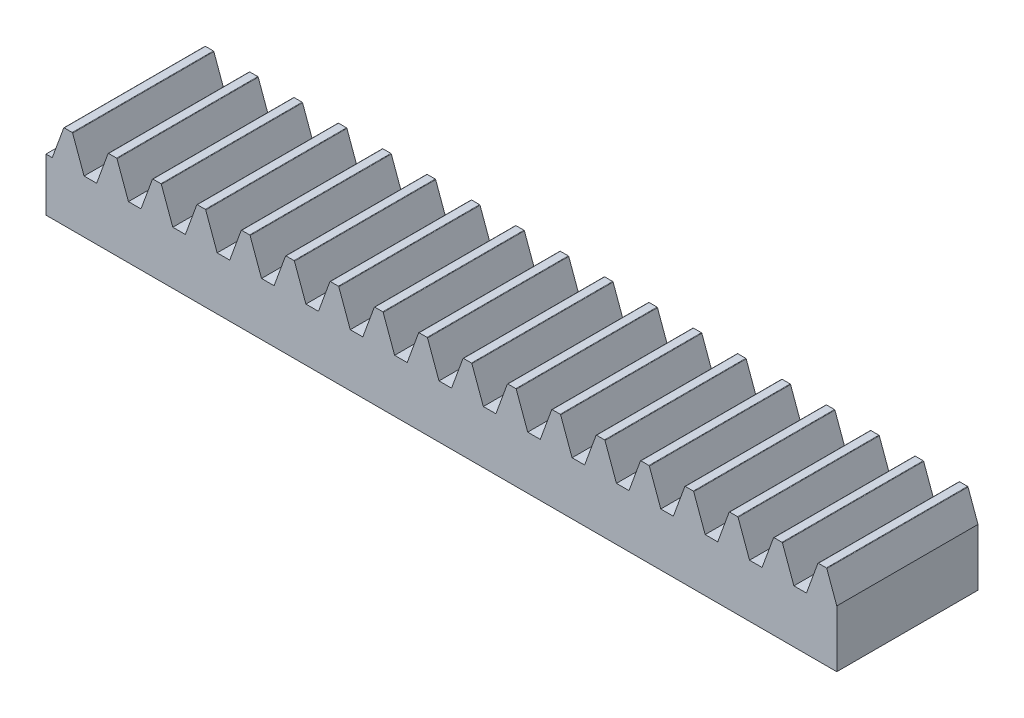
ISO-10303-21;
HEADER;
FILE_DESCRIPTION(('STEP AP214'),'2;1');
FILE_NAME('part.step','',(''),(''),'','','');
FILE_SCHEMA(('AUTOMOTIVE_DESIGN { 1 0 10303 214 1 1 1 1 }'));
ENDSEC;
DATA;
#1=APPLICATION_CONTEXT('core data for automotive mechanical design processes');
#2=APPLICATION_PROTOCOL_DEFINITION('international standard','automotive_design',2000,#1);
#3=PRODUCT_CONTEXT('',#1,'mechanical');
#4=PRODUCT('Part','Part','',(#3));
#5=PRODUCT_RELATED_PRODUCT_CATEGORY('part','',(#4));
#6=PRODUCT_DEFINITION_FORMATION('','',#4);
#7=PRODUCT_DEFINITION_CONTEXT('part definition',#1,'design');
#8=PRODUCT_DEFINITION('design','',#6,#7);
#9=PRODUCT_DEFINITION_SHAPE('','',#8);
#10=(LENGTH_UNIT() NAMED_UNIT(*) SI_UNIT(.MILLI.,.METRE.));
#11=(NAMED_UNIT(*) PLANE_ANGLE_UNIT() SI_UNIT($,.RADIAN.));
#12=(NAMED_UNIT(*) SI_UNIT($,.STERADIAN.) SOLID_ANGLE_UNIT());
#13=UNCERTAINTY_MEASURE_WITH_UNIT(LENGTH_MEASURE(1.E-05),#10,'distance_accuracy_value','');
#14=(GEOMETRIC_REPRESENTATION_CONTEXT(3) GLOBAL_UNCERTAINTY_ASSIGNED_CONTEXT((#13)) GLOBAL_UNIT_ASSIGNED_CONTEXT((#10,
#11,#12)) REPRESENTATION_CONTEXT('',''));
#15=CARTESIAN_POINT('',(0.,0.,0.));
#16=DIRECTION('',(0.,0.,1.));
#17=DIRECTION('',(1.,0.,0.));
#18=AXIS2_PLACEMENT_3D('',#15,#16,#17);
#19=CARTESIAN_POINT('',(0.,6.,-10.));
#20=DIRECTION('',(0.,1.,0.));
#21=DIRECTION('',(-1.,0.,0.));
#22=AXIS2_PLACEMENT_3D('',#19,#20,#21);
#23=PLANE('',#22);
#24=DIRECTION('',(0.,0.,1.));
#25=VECTOR('',#24,1.);
#26=CARTESIAN_POINT('',(52.1156983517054,6.,-10.));
#27=LINE('',#26,#25);
#28=CARTESIAN_POINT('',(52.1156983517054,6.,-10.));
#29=VERTEX_POINT('',#28);
#30=CARTESIAN_POINT('',(52.1156983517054,6.,0.));
#31=VERTEX_POINT('',#30);
#32=EDGE_CURVE('E71',#29,#31,#27,.T.);
#33=ORIENTED_EDGE('',*,*,#32,.F.);
#34=DIRECTION('',(-1.,0.,0.));
#35=VECTOR('',#34,1.);
#36=CARTESIAN_POINT('',(0.,6.,-10.));
#37=LINE('',#36,#35);
#38=CARTESIAN_POINT('',(51.5568590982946,6.,-10.));
#39=VERTEX_POINT('',#38);
#40=EDGE_CURVE('E1851',#29,#39,#37,.T.);
#41=ORIENTED_EDGE('',*,*,#40,.T.);
#42=DIRECTION('',(0.,0.,1.));
#43=VECTOR('',#42,1.);
#44=CARTESIAN_POINT('',(51.5568590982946,6.,-10.));
#45=LINE('',#44,#43);
#46=CARTESIAN_POINT('',(51.5568590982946,6.,0.));
#47=VERTEX_POINT('',#46);
#48=EDGE_CURVE('E973',#39,#47,#45,.T.);
#49=ORIENTED_EDGE('',*,*,#48,.T.);
#50=DIRECTION('',(-1.,0.,0.));
#51=VECTOR('',#50,1.);
#52=CARTESIAN_POINT('',(0.,6.,0.));
#53=LINE('',#52,#51);
#54=EDGE_CURVE('E1865',#31,#47,#53,.T.);
#55=ORIENTED_EDGE('',*,*,#54,.F.);
#56=EDGE_LOOP('',(#33,#41,#49,#55));
#57=FACE_BOUND('',#56,.T.);
#58=ADVANCED_FACE('F47',(#57),#23,.T.);
#59=DIRECTION('',(0.,0.,1.));
#60=VECTOR('',#59,1.);
#61=CARTESIAN_POINT('',(48.9741057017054,6.,-10.));
#62=LINE('',#61,#60);
#63=CARTESIAN_POINT('',(48.9741057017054,6.,-10.));
#64=VERTEX_POINT('',#63);
#65=CARTESIAN_POINT('',(48.9741057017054,6.,0.));
#66=VERTEX_POINT('',#65);
#67=EDGE_CURVE('E999',#64,#66,#62,.T.);
#68=ORIENTED_EDGE('',*,*,#67,.F.);
#69=CARTESIAN_POINT('',(48.4152664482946,6.,-10.));
#70=VERTEX_POINT('',#69);
#71=EDGE_CURVE('E2080',#64,#70,#37,.T.);
#72=ORIENTED_EDGE('',*,*,#71,.T.);
#73=DIRECTION('',(0.,0.,1.));
#74=VECTOR('',#73,1.);
#75=CARTESIAN_POINT('',(48.4152664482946,6.,-10.));
#76=LINE('',#75,#74);
#77=CARTESIAN_POINT('',(48.4152664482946,6.,0.));
#78=VERTEX_POINT('',#77);
#79=EDGE_CURVE('E1026',#70,#78,#76,.T.);
#80=ORIENTED_EDGE('',*,*,#79,.T.);
#81=EDGE_CURVE('E1913',#66,#78,#53,.T.);
#82=ORIENTED_EDGE('',*,*,#81,.F.);
#83=EDGE_LOOP('',(#68,#72,#80,#82));
#84=FACE_BOUND('',#83,.T.);
#85=ADVANCED_FACE('F2105',(#84),#23,.T.);
#86=DIRECTION('',(0.,0.,1.));
#87=VECTOR('',#86,1.);
#88=CARTESIAN_POINT('',(45.8325130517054,6.,-10.));
#89=LINE('',#88,#87);
#90=CARTESIAN_POINT('',(45.8325130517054,6.,-10.));
#91=VERTEX_POINT('',#90);
#92=CARTESIAN_POINT('',(45.8325130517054,6.,0.));
#93=VERTEX_POINT('',#92);
#94=EDGE_CURVE('E1052',#91,#93,#89,.T.);
#95=ORIENTED_EDGE('',*,*,#94,.F.);
#96=CARTESIAN_POINT('',(45.2736737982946,6.,-10.));
#97=VERTEX_POINT('',#96);
#98=EDGE_CURVE('E2074',#91,#97,#37,.T.);
#99=ORIENTED_EDGE('',*,*,#98,.T.);
#100=DIRECTION('',(0.,0.,1.));
#101=VECTOR('',#100,1.);
#102=CARTESIAN_POINT('',(45.2736737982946,6.,-10.));
#103=LINE('',#102,#101);
#104=CARTESIAN_POINT('',(45.2736737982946,6.,0.));
#105=VERTEX_POINT('',#104);
#106=EDGE_CURVE('E1079',#97,#105,#103,.T.);
#107=ORIENTED_EDGE('',*,*,#106,.T.);
#108=EDGE_CURVE('E1915',#93,#105,#53,.T.);
#109=ORIENTED_EDGE('',*,*,#108,.F.);
#110=EDGE_LOOP('',(#95,#99,#107,#109));
#111=FACE_BOUND('',#110,.T.);
#112=ADVANCED_FACE('F2120',(#111),#23,.T.);
#113=DIRECTION('',(0.,0.,1.));
#114=VECTOR('',#113,1.);
#115=CARTESIAN_POINT('',(42.6909204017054,6.,-10.));
#116=LINE('',#115,#114);
#117=CARTESIAN_POINT('',(42.6909204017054,6.,-10.));
#118=VERTEX_POINT('',#117);
#119=CARTESIAN_POINT('',(42.6909204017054,6.,0.));
#120=VERTEX_POINT('',#119);
#121=EDGE_CURVE('E1105',#118,#120,#116,.T.);
#122=ORIENTED_EDGE('',*,*,#121,.F.);
#123=CARTESIAN_POINT('',(42.1320811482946,6.,-10.));
#124=VERTEX_POINT('',#123);
#125=EDGE_CURVE('E2068',#118,#124,#37,.T.);
#126=ORIENTED_EDGE('',*,*,#125,.T.);
#127=DIRECTION('',(0.,0.,1.));
#128=VECTOR('',#127,1.);
#129=CARTESIAN_POINT('',(42.1320811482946,6.,-10.));
#130=LINE('',#129,#128);
#131=CARTESIAN_POINT('',(42.1320811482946,6.,0.));
#132=VERTEX_POINT('',#131);
#133=EDGE_CURVE('E1132',#124,#132,#130,.T.);
#134=ORIENTED_EDGE('',*,*,#133,.T.);
#135=EDGE_CURVE('E1920',#120,#132,#53,.T.);
#136=ORIENTED_EDGE('',*,*,#135,.F.);
#137=EDGE_LOOP('',(#122,#126,#134,#136));
#138=FACE_BOUND('',#137,.T.);
#139=ADVANCED_FACE('F2135',(#138),#23,.T.);
#140=DIRECTION('',(0.,0.,1.));
#141=VECTOR('',#140,1.);
#142=CARTESIAN_POINT('',(39.5493277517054,6.,-10.));
#143=LINE('',#142,#141);
#144=CARTESIAN_POINT('',(39.5493277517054,6.,-10.));
#145=VERTEX_POINT('',#144);
#146=CARTESIAN_POINT('',(39.5493277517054,6.,0.));
#147=VERTEX_POINT('',#146);
#148=EDGE_CURVE('E1158',#145,#147,#143,.T.);
#149=ORIENTED_EDGE('',*,*,#148,.F.);
#150=CARTESIAN_POINT('',(38.9904884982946,6.,-10.));
#151=VERTEX_POINT('',#150);
#152=EDGE_CURVE('E2062',#145,#151,#37,.T.);
#153=ORIENTED_EDGE('',*,*,#152,.T.);
#154=DIRECTION('',(0.,0.,1.));
#155=VECTOR('',#154,1.);
#156=CARTESIAN_POINT('',(38.9904884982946,6.,-10.));
#157=LINE('',#156,#155);
#158=CARTESIAN_POINT('',(38.9904884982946,6.,0.));
#159=VERTEX_POINT('',#158);
#160=EDGE_CURVE('E1185',#151,#159,#157,.T.);
#161=ORIENTED_EDGE('',*,*,#160,.T.);
#162=EDGE_CURVE('E1925',#147,#159,#53,.T.);
#163=ORIENTED_EDGE('',*,*,#162,.F.);
#164=EDGE_LOOP('',(#149,#153,#161,#163));
#165=FACE_BOUND('',#164,.T.);
#166=ADVANCED_FACE('F2150',(#165),#23,.T.);
#167=DIRECTION('',(0.,0.,1.));
#168=VECTOR('',#167,1.);
#169=CARTESIAN_POINT('',(36.4077351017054,6.,-10.));
#170=LINE('',#169,#168);
#171=CARTESIAN_POINT('',(36.4077351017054,6.,-10.));
#172=VERTEX_POINT('',#171);
#173=CARTESIAN_POINT('',(36.4077351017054,6.,0.));
#174=VERTEX_POINT('',#173);
#175=EDGE_CURVE('E1211',#172,#174,#170,.T.);
#176=ORIENTED_EDGE('',*,*,#175,.F.);
#177=CARTESIAN_POINT('',(35.8488958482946,6.,-10.));
#178=VERTEX_POINT('',#177);
#179=EDGE_CURVE('E2056',#172,#178,#37,.T.);
#180=ORIENTED_EDGE('',*,*,#179,.T.);
#181=DIRECTION('',(0.,0.,1.));
#182=VECTOR('',#181,1.);
#183=CARTESIAN_POINT('',(35.8488958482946,6.,-10.));
#184=LINE('',#183,#182);
#185=CARTESIAN_POINT('',(35.8488958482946,6.,0.));
#186=VERTEX_POINT('',#185);
#187=EDGE_CURVE('E1238',#178,#186,#184,.T.);
#188=ORIENTED_EDGE('',*,*,#187,.T.);
#189=EDGE_CURVE('E1930',#174,#186,#53,.T.);
#190=ORIENTED_EDGE('',*,*,#189,.F.);
#191=EDGE_LOOP('',(#176,#180,#188,#190));
#192=FACE_BOUND('',#191,.T.);
#193=ADVANCED_FACE('F2165',(#192),#23,.T.);
#194=DIRECTION('',(0.,0.,1.));
#195=VECTOR('',#194,1.);
#196=CARTESIAN_POINT('',(33.2661424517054,6.,-10.));
#197=LINE('',#196,#195);
#198=CARTESIAN_POINT('',(33.2661424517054,6.,-10.));
#199=VERTEX_POINT('',#198);
#200=CARTESIAN_POINT('',(33.2661424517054,6.,0.));
#201=VERTEX_POINT('',#200);
#202=EDGE_CURVE('E1264',#199,#201,#197,.T.);
#203=ORIENTED_EDGE('',*,*,#202,.F.);
#204=CARTESIAN_POINT('',(32.7073031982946,6.,-10.));
#205=VERTEX_POINT('',#204);
#206=EDGE_CURVE('E2050',#199,#205,#37,.T.);
#207=ORIENTED_EDGE('',*,*,#206,.T.);
#208=DIRECTION('',(0.,0.,1.));
#209=VECTOR('',#208,1.);
#210=CARTESIAN_POINT('',(32.7073031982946,6.,-10.));
#211=LINE('',#210,#209);
#212=CARTESIAN_POINT('',(32.7073031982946,6.,0.));
#213=VERTEX_POINT('',#212);
#214=EDGE_CURVE('E1291',#205,#213,#211,.T.);
#215=ORIENTED_EDGE('',*,*,#214,.T.);
#216=EDGE_CURVE('E1935',#201,#213,#53,.T.);
#217=ORIENTED_EDGE('',*,*,#216,.F.);
#218=EDGE_LOOP('',(#203,#207,#215,#217));
#219=FACE_BOUND('',#218,.T.);
#220=ADVANCED_FACE('F2180',(#219),#23,.T.);
#221=DIRECTION('',(0.,0.,1.));
#222=VECTOR('',#221,1.);
#223=CARTESIAN_POINT('',(30.1245498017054,6.,-10.));
#224=LINE('',#223,#222);
#225=CARTESIAN_POINT('',(30.1245498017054,6.,-10.));
#226=VERTEX_POINT('',#225);
#227=CARTESIAN_POINT('',(30.1245498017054,6.,0.));
#228=VERTEX_POINT('',#227);
#229=EDGE_CURVE('E1317',#226,#228,#224,.T.);
#230=ORIENTED_EDGE('',*,*,#229,.F.);
#231=CARTESIAN_POINT('',(29.5657105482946,6.,-10.));
#232=VERTEX_POINT('',#231);
#233=EDGE_CURVE('E2044',#226,#232,#37,.T.);
#234=ORIENTED_EDGE('',*,*,#233,.T.);
#235=DIRECTION('',(0.,0.,1.));
#236=VECTOR('',#235,1.);
#237=CARTESIAN_POINT('',(29.5657105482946,6.,-10.));
#238=LINE('',#237,#236);
#239=CARTESIAN_POINT('',(29.5657105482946,6.,0.));
#240=VERTEX_POINT('',#239);
#241=EDGE_CURVE('E1344',#232,#240,#238,.T.);
#242=ORIENTED_EDGE('',*,*,#241,.T.);
#243=EDGE_CURVE('E1940',#228,#240,#53,.T.);
#244=ORIENTED_EDGE('',*,*,#243,.F.);
#245=EDGE_LOOP('',(#230,#234,#242,#244));
#246=FACE_BOUND('',#245,.T.);
#247=ADVANCED_FACE('F2195',(#246),#23,.T.);
#248=DIRECTION('',(0.,0.,1.));
#249=VECTOR('',#248,1.);
#250=CARTESIAN_POINT('',(26.9829571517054,6.,-10.));
#251=LINE('',#250,#249);
#252=CARTESIAN_POINT('',(26.9829571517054,6.,-10.));
#253=VERTEX_POINT('',#252);
#254=CARTESIAN_POINT('',(26.9829571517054,6.,0.));
#255=VERTEX_POINT('',#254);
#256=EDGE_CURVE('E1370',#253,#255,#251,.T.);
#257=ORIENTED_EDGE('',*,*,#256,.F.);
#258=CARTESIAN_POINT('',(26.4241178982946,6.,-10.));
#259=VERTEX_POINT('',#258);
#260=EDGE_CURVE('E2038',#253,#259,#37,.T.);
#261=ORIENTED_EDGE('',*,*,#260,.T.);
#262=DIRECTION('',(0.,0.,1.));
#263=VECTOR('',#262,1.);
#264=CARTESIAN_POINT('',(26.4241178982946,6.,-10.));
#265=LINE('',#264,#263);
#266=CARTESIAN_POINT('',(26.4241178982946,6.,0.));
#267=VERTEX_POINT('',#266);
#268=EDGE_CURVE('E1397',#259,#267,#265,.T.);
#269=ORIENTED_EDGE('',*,*,#268,.T.);
#270=EDGE_CURVE('E1945',#255,#267,#53,.T.);
#271=ORIENTED_EDGE('',*,*,#270,.F.);
#272=EDGE_LOOP('',(#257,#261,#269,#271));
#273=FACE_BOUND('',#272,.T.);
#274=ADVANCED_FACE('F2210',(#273),#23,.T.);
#275=DIRECTION('',(0.,0.,1.));
#276=VECTOR('',#275,1.);
#277=CARTESIAN_POINT('',(23.8413645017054,6.,-10.));
#278=LINE('',#277,#276);
#279=CARTESIAN_POINT('',(23.8413645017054,6.,-10.));
#280=VERTEX_POINT('',#279);
#281=CARTESIAN_POINT('',(23.8413645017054,6.,0.));
#282=VERTEX_POINT('',#281);
#283=EDGE_CURVE('E1423',#280,#282,#278,.T.);
#284=ORIENTED_EDGE('',*,*,#283,.F.);
#285=CARTESIAN_POINT('',(23.2825252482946,6.,-10.));
#286=VERTEX_POINT('',#285);
#287=EDGE_CURVE('E2032',#280,#286,#37,.T.);
#288=ORIENTED_EDGE('',*,*,#287,.T.);
#289=DIRECTION('',(0.,0.,1.));
#290=VECTOR('',#289,1.);
#291=CARTESIAN_POINT('',(23.2825252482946,6.,-10.));
#292=LINE('',#291,#290);
#293=CARTESIAN_POINT('',(23.2825252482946,6.,0.));
#294=VERTEX_POINT('',#293);
#295=EDGE_CURVE('E1450',#286,#294,#292,.T.);
#296=ORIENTED_EDGE('',*,*,#295,.T.);
#297=EDGE_CURVE('E1950',#282,#294,#53,.T.);
#298=ORIENTED_EDGE('',*,*,#297,.F.);
#299=EDGE_LOOP('',(#284,#288,#296,#298));
#300=FACE_BOUND('',#299,.T.);
#301=ADVANCED_FACE('F2225',(#300),#23,.T.);
#302=DIRECTION('',(0.,0.,1.));
#303=VECTOR('',#302,1.);
#304=CARTESIAN_POINT('',(20.6997718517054,6.,-10.));
#305=LINE('',#304,#303);
#306=CARTESIAN_POINT('',(20.6997718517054,6.,-10.));
#307=VERTEX_POINT('',#306);
#308=CARTESIAN_POINT('',(20.6997718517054,6.,0.));
#309=VERTEX_POINT('',#308);
#310=EDGE_CURVE('E1476',#307,#309,#305,.T.);
#311=ORIENTED_EDGE('',*,*,#310,.F.);
#312=CARTESIAN_POINT('',(20.1409325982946,6.,-10.));
#313=VERTEX_POINT('',#312);
#314=EDGE_CURVE('E2026',#307,#313,#37,.T.);
#315=ORIENTED_EDGE('',*,*,#314,.T.);
#316=DIRECTION('',(0.,0.,1.));
#317=VECTOR('',#316,1.);
#318=CARTESIAN_POINT('',(20.1409325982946,6.,-10.));
#319=LINE('',#318,#317);
#320=CARTESIAN_POINT('',(20.1409325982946,6.,0.));
#321=VERTEX_POINT('',#320);
#322=EDGE_CURVE('E1503',#313,#321,#319,.T.);
#323=ORIENTED_EDGE('',*,*,#322,.T.);
#324=EDGE_CURVE('E1955',#309,#321,#53,.T.);
#325=ORIENTED_EDGE('',*,*,#324,.F.);
#326=EDGE_LOOP('',(#311,#315,#323,#325));
#327=FACE_BOUND('',#326,.T.);
#328=ADVANCED_FACE('F2240',(#327),#23,.T.);
#329=DIRECTION('',(0.,0.,1.));
#330=VECTOR('',#329,1.);
#331=CARTESIAN_POINT('',(17.5581792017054,6.,-10.));
#332=LINE('',#331,#330);
#333=CARTESIAN_POINT('',(17.5581792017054,6.,-10.));
#334=VERTEX_POINT('',#333);
#335=CARTESIAN_POINT('',(17.5581792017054,6.,0.));
#336=VERTEX_POINT('',#335);
#337=EDGE_CURVE('E1529',#334,#336,#332,.T.);
#338=ORIENTED_EDGE('',*,*,#337,.F.);
#339=CARTESIAN_POINT('',(16.9993399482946,6.,-10.));
#340=VERTEX_POINT('',#339);
#341=EDGE_CURVE('E2020',#334,#340,#37,.T.);
#342=ORIENTED_EDGE('',*,*,#341,.T.);
#343=DIRECTION('',(0.,0.,1.));
#344=VECTOR('',#343,1.);
#345=CARTESIAN_POINT('',(16.9993399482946,6.,-10.));
#346=LINE('',#345,#344);
#347=CARTESIAN_POINT('',(16.9993399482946,6.,0.));
#348=VERTEX_POINT('',#347);
#349=EDGE_CURVE('E1556',#340,#348,#346,.T.);
#350=ORIENTED_EDGE('',*,*,#349,.T.);
#351=EDGE_CURVE('E1960',#336,#348,#53,.T.);
#352=ORIENTED_EDGE('',*,*,#351,.F.);
#353=EDGE_LOOP('',(#338,#342,#350,#352));
#354=FACE_BOUND('',#353,.T.);
#355=ADVANCED_FACE('F2255',(#354),#23,.T.);
#356=DIRECTION('',(0.,0.,1.));
#357=VECTOR('',#356,1.);
#358=CARTESIAN_POINT('',(14.4165865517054,6.,-10.));
#359=LINE('',#358,#357);
#360=CARTESIAN_POINT('',(14.4165865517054,6.,-10.));
#361=VERTEX_POINT('',#360);
#362=CARTESIAN_POINT('',(14.4165865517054,6.,0.));
#363=VERTEX_POINT('',#362);
#364=EDGE_CURVE('E1582',#361,#363,#359,.T.);
#365=ORIENTED_EDGE('',*,*,#364,.F.);
#366=CARTESIAN_POINT('',(13.8577472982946,6.,-10.));
#367=VERTEX_POINT('',#366);
#368=EDGE_CURVE('E2014',#361,#367,#37,.T.);
#369=ORIENTED_EDGE('',*,*,#368,.T.);
#370=DIRECTION('',(0.,0.,1.));
#371=VECTOR('',#370,1.);
#372=CARTESIAN_POINT('',(13.8577472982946,6.,-10.));
#373=LINE('',#372,#371);
#374=CARTESIAN_POINT('',(13.8577472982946,6.,0.));
#375=VERTEX_POINT('',#374);
#376=EDGE_CURVE('E1609',#367,#375,#373,.T.);
#377=ORIENTED_EDGE('',*,*,#376,.T.);
#378=EDGE_CURVE('E1965',#363,#375,#53,.T.);
#379=ORIENTED_EDGE('',*,*,#378,.F.);
#380=EDGE_LOOP('',(#365,#369,#377,#379));
#381=FACE_BOUND('',#380,.T.);
#382=ADVANCED_FACE('F2270',(#381),#23,.T.);
#383=DIRECTION('',(0.,0.,1.));
#384=VECTOR('',#383,1.);
#385=CARTESIAN_POINT('',(11.2749939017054,6.,-10.));
#386=LINE('',#385,#384);
#387=CARTESIAN_POINT('',(11.2749939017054,6.,-10.));
#388=VERTEX_POINT('',#387);
#389=CARTESIAN_POINT('',(11.2749939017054,6.,0.));
#390=VERTEX_POINT('',#389);
#391=EDGE_CURVE('E1635',#388,#390,#386,.T.);
#392=ORIENTED_EDGE('',*,*,#391,.F.);
#393=CARTESIAN_POINT('',(10.7161546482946,6.,-10.));
#394=VERTEX_POINT('',#393);
#395=EDGE_CURVE('E2008',#388,#394,#37,.T.);
#396=ORIENTED_EDGE('',*,*,#395,.T.);
#397=DIRECTION('',(0.,0.,1.));
#398=VECTOR('',#397,1.);
#399=CARTESIAN_POINT('',(10.7161546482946,6.,-10.));
#400=LINE('',#399,#398);
#401=CARTESIAN_POINT('',(10.7161546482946,6.,0.));
#402=VERTEX_POINT('',#401);
#403=EDGE_CURVE('E1662',#394,#402,#400,.T.);
#404=ORIENTED_EDGE('',*,*,#403,.T.);
#405=EDGE_CURVE('E1970',#390,#402,#53,.T.);
#406=ORIENTED_EDGE('',*,*,#405,.F.);
#407=EDGE_LOOP('',(#392,#396,#404,#406));
#408=FACE_BOUND('',#407,.T.);
#409=ADVANCED_FACE('F2285',(#408),#23,.T.);
#410=DIRECTION('',(0.,0.,1.));
#411=VECTOR('',#410,1.);
#412=CARTESIAN_POINT('',(8.1334012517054,6.,-10.));
#413=LINE('',#412,#411);
#414=CARTESIAN_POINT('',(8.1334012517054,6.,-10.));
#415=VERTEX_POINT('',#414);
#416=CARTESIAN_POINT('',(8.1334012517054,6.,0.));
#417=VERTEX_POINT('',#416);
#418=EDGE_CURVE('E1688',#415,#417,#413,.T.);
#419=ORIENTED_EDGE('',*,*,#418,.F.);
#420=CARTESIAN_POINT('',(7.5745619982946,6.,-10.));
#421=VERTEX_POINT('',#420);
#422=EDGE_CURVE('E2002',#415,#421,#37,.T.);
#423=ORIENTED_EDGE('',*,*,#422,.T.);
#424=DIRECTION('',(0.,0.,1.));
#425=VECTOR('',#424,1.);
#426=CARTESIAN_POINT('',(7.5745619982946,6.,-10.));
#427=LINE('',#426,#425);
#428=CARTESIAN_POINT('',(7.5745619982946,6.,0.));
#429=VERTEX_POINT('',#428);
#430=EDGE_CURVE('E1715',#421,#429,#427,.T.);
#431=ORIENTED_EDGE('',*,*,#430,.T.);
#432=EDGE_CURVE('E1975',#417,#429,#53,.T.);
#433=ORIENTED_EDGE('',*,*,#432,.F.);
#434=EDGE_LOOP('',(#419,#423,#431,#433));
#435=FACE_BOUND('',#434,.T.);
#436=ADVANCED_FACE('F2300',(#435),#23,.T.);
#437=DIRECTION('',(0.,0.,1.));
#438=VECTOR('',#437,1.);
#439=CARTESIAN_POINT('',(4.9918086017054,6.,-10.));
#440=LINE('',#439,#438);
#441=CARTESIAN_POINT('',(4.9918086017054,6.,-10.));
#442=VERTEX_POINT('',#441);
#443=CARTESIAN_POINT('',(4.9918086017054,6.,0.));
#444=VERTEX_POINT('',#443);
#445=EDGE_CURVE('E1741',#442,#444,#440,.T.);
#446=ORIENTED_EDGE('',*,*,#445,.F.);
#447=CARTESIAN_POINT('',(4.4329693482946,6.,-10.));
#448=VERTEX_POINT('',#447);
#449=EDGE_CURVE('E2000',#442,#448,#37,.T.);
#450=ORIENTED_EDGE('',*,*,#449,.T.);
#451=DIRECTION('',(0.,0.,1.));
#452=VECTOR('',#451,1.);
#453=CARTESIAN_POINT('',(4.4329693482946,6.,-10.));
#454=LINE('',#453,#452);
#455=CARTESIAN_POINT('',(4.4329693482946,6.,0.));
#456=VERTEX_POINT('',#455);
#457=EDGE_CURVE('E1768',#448,#456,#454,.T.);
#458=ORIENTED_EDGE('',*,*,#457,.T.);
#459=EDGE_CURVE('E1980',#444,#456,#53,.T.);
#460=ORIENTED_EDGE('',*,*,#459,.F.);
#461=EDGE_LOOP('',(#446,#450,#458,#460));
#462=FACE_BOUND('',#461,.T.);
#463=ADVANCED_FACE('F2315',(#462),#23,.T.);
#464=DIRECTION('',(0.,0.,1.));
#465=VECTOR('',#464,1.);
#466=CARTESIAN_POINT('',(1.8502159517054,6.,-10.));
#467=LINE('',#466,#465);
#468=CARTESIAN_POINT('',(1.8502159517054,6.,-10.));
#469=VERTEX_POINT('',#468);
#470=CARTESIAN_POINT('',(1.8502159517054,6.,0.));
#471=VERTEX_POINT('',#470);
#472=EDGE_CURVE('E1794',#469,#471,#467,.T.);
#473=ORIENTED_EDGE('',*,*,#472,.F.);
#474=CARTESIAN_POINT('',(1.2913766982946,6.,-10.));
#475=VERTEX_POINT('',#474);
#476=EDGE_CURVE('E1846',#469,#475,#37,.T.);
#477=ORIENTED_EDGE('',*,*,#476,.T.);
#478=DIRECTION('',(0.,0.,1.));
#479=VECTOR('',#478,1.);
#480=CARTESIAN_POINT('',(1.2913766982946,6.,-10.));
#481=LINE('',#480,#479);
#482=CARTESIAN_POINT('',(1.2913766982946,6.,0.));
#483=VERTEX_POINT('',#482);
#484=EDGE_CURVE('E1817',#475,#483,#481,.T.);
#485=ORIENTED_EDGE('',*,*,#484,.T.);
#486=EDGE_CURVE('E1862',#471,#483,#53,.T.);
#487=ORIENTED_EDGE('',*,*,#486,.F.);
#488=EDGE_LOOP('',(#473,#477,#485,#487));
#489=FACE_BOUND('',#488,.T.);
#490=ADVANCED_FACE('F1997',(#489),#23,.T.);
#491=CARTESIAN_POINT('',(0.,0.,-10.));
#492=DIRECTION('',(-1.,0.,0.));
#493=DIRECTION('',(0.,0.,1.));
#494=AXIS2_PLACEMENT_3D('',#491,#492,#493);
#495=PLANE('',#494);
#496=DIRECTION('',(0.,0.,1.));
#497=VECTOR('',#496,1.);
#498=CARTESIAN_POINT('',(0.,3.75,-10.));
#499=LINE('',#498,#497);
#500=CARTESIAN_POINT('',(0.,3.75,-10.));
#501=VERTEX_POINT('',#500);
#502=CARTESIAN_POINT('',(0.,3.75,0.));
#503=VERTEX_POINT('',#502);
#504=EDGE_CURVE('E1827',#501,#503,#499,.T.);
#505=ORIENTED_EDGE('',*,*,#504,.F.);
#506=DIRECTION('',(0.,-1.,0.));
#507=VECTOR('',#506,1.);
#508=CARTESIAN_POINT('',(0.,0.,-10.));
#509=LINE('',#508,#507);
#510=CARTESIAN_POINT('',(0.,0.,-10.));
#511=VERTEX_POINT('',#510);
#512=EDGE_CURVE('E1834',#501,#511,#509,.T.);
#513=ORIENTED_EDGE('',*,*,#512,.T.);
#514=DIRECTION('',(0.,0.,1.));
#515=VECTOR('',#514,1.);
#516=CARTESIAN_POINT('',(0.,0.,-10.));
#517=LINE('',#516,#515);
#518=CARTESIAN_POINT('',(0.,0.,0.));
#519=VERTEX_POINT('',#518);
#520=EDGE_CURVE('E1850',#511,#519,#517,.T.);
#521=ORIENTED_EDGE('',*,*,#520,.T.);
#522=DIRECTION('',(0.,-1.,0.));
#523=VECTOR('',#522,1.);
#524=CARTESIAN_POINT('',(0.,0.,0.));
#525=LINE('',#524,#523);
#526=EDGE_CURVE('E1833',#503,#519,#525,.T.);
#527=ORIENTED_EDGE('',*,*,#526,.F.);
#528=EDGE_LOOP('',(#505,#513,#521,#527));
#529=FACE_BOUND('',#528,.T.);
#530=ADVANCED_FACE('F49',(#529),#495,.T.);
#531=DIRECTION('',(0.,0.,1.));
#532=VECTOR('',#531,1.);
#533=CARTESIAN_POINT('',(55.2572910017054,6.,-10.));
#534=LINE('',#533,#532);
#535=CARTESIAN_POINT('',(55.2572910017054,6.,-10.));
#536=VERTEX_POINT('',#535);
#537=CARTESIAN_POINT('',(55.2572910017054,6.,0.));
#538=VERTEX_POINT('',#537);
#539=EDGE_CURVE('E63',#536,#538,#534,.T.);
#540=ORIENTED_EDGE('',*,*,#539,.F.);
#541=CARTESIAN_POINT('',(54.6984517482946,6.,-10.));
#542=VERTEX_POINT('',#541);
#543=EDGE_CURVE('E1847',#536,#542,#37,.T.);
#544=ORIENTED_EDGE('',*,*,#543,.T.);
#545=DIRECTION('',(0.,0.,1.));
#546=VECTOR('',#545,1.);
#547=CARTESIAN_POINT('',(54.6984517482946,6.,-10.));
#548=LINE('',#547,#546);
#549=CARTESIAN_POINT('',(54.6984517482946,6.,0.));
#550=VERTEX_POINT('',#549);
#551=EDGE_CURVE('E925',#542,#550,#548,.T.);
#552=ORIENTED_EDGE('',*,*,#551,.T.);
#553=EDGE_CURVE('E1838',#538,#550,#53,.T.);
#554=ORIENTED_EDGE('',*,*,#553,.F.);
#555=EDGE_LOOP('',(#540,#544,#552,#554));
#556=FACE_BOUND('',#555,.T.);
#557=ADVANCED_FACE('F1900',(#556),#23,.T.);
#558=CARTESIAN_POINT('',(56.,0.,-10.));
#559=DIRECTION('',(1.,0.,0.));
#560=DIRECTION('',(0.,0.,-1.));
#561=AXIS2_PLACEMENT_3D('',#558,#559,#560);
#562=PLANE('',#561);
#563=DIRECTION('',(0.,0.,-1.));
#564=VECTOR('',#563,1.);
#565=CARTESIAN_POINT('',(56.,4.03637597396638,-10.));
#566=LINE('',#565,#564);
#567=CARTESIAN_POINT('',(56.,4.03637597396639,0.));
#568=VERTEX_POINT('',#567);
#569=CARTESIAN_POINT('',(56.,4.03637597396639,-10.));
#570=VERTEX_POINT('',#569);
#571=EDGE_CURVE('E910',#568,#570,#566,.T.);
#572=ORIENTED_EDGE('',*,*,#571,.F.);
#573=DIRECTION('',(0.,1.,0.));
#574=VECTOR('',#573,1.);
#575=CARTESIAN_POINT('',(56.,0.,0.));
#576=LINE('',#575,#574);
#577=CARTESIAN_POINT('',(56.,0.,0.));
#578=VERTEX_POINT('',#577);
#579=EDGE_CURVE('E1858',#578,#568,#576,.T.);
#580=ORIENTED_EDGE('',*,*,#579,.F.);
#581=DIRECTION('',(0.,0.,1.));
#582=VECTOR('',#581,1.);
#583=CARTESIAN_POINT('',(56.,0.,-10.));
#584=LINE('',#583,#582);
#585=CARTESIAN_POINT('',(56.,0.,-10.));
#586=VERTEX_POINT('',#585);
#587=EDGE_CURVE('E56',#586,#578,#584,.T.);
#588=ORIENTED_EDGE('',*,*,#587,.F.);
#589=DIRECTION('',(0.,1.,0.));
#590=VECTOR('',#589,1.);
#591=CARTESIAN_POINT('',(56.,0.,-10.));
#592=LINE('',#591,#590);
#593=EDGE_CURVE('E1842',#586,#570,#592,.T.);
#594=ORIENTED_EDGE('',*,*,#593,.T.);
#595=EDGE_LOOP('',(#572,#580,#588,#594));
#596=FACE_BOUND('',#595,.T.);
#597=ADVANCED_FACE('F1894',(#596),#562,.T.);
#598=CARTESIAN_POINT('',(0.,0.,-10.));
#599=DIRECTION('',(0.,-1.,0.));
#600=DIRECTION('',(0.,0.,-1.));
#601=AXIS2_PLACEMENT_3D('',#598,#599,#600);
#602=PLANE('',#601);
#603=DIRECTION('',(1.,0.,0.));
#604=VECTOR('',#603,1.);
#605=CARTESIAN_POINT('',(0.,0.,0.));
#606=LINE('',#605,#604);
#607=EDGE_CURVE('E1854',#519,#578,#606,.T.);
#608=ORIENTED_EDGE('',*,*,#607,.F.);
#609=ORIENTED_EDGE('',*,*,#520,.F.);
#610=DIRECTION('',(1.,0.,0.));
#611=VECTOR('',#610,1.);
#612=CARTESIAN_POINT('',(0.,0.,-10.));
#613=LINE('',#612,#611);
#614=EDGE_CURVE('E1837',#511,#586,#613,.T.);
#615=ORIENTED_EDGE('',*,*,#614,.T.);
#616=ORIENTED_EDGE('',*,*,#587,.T.);
#617=EDGE_LOOP('',(#608,#609,#615,#616));
#618=FACE_BOUND('',#617,.T.);
#619=ADVANCED_FACE('F1877',(#618),#602,.T.);
#620=CARTESIAN_POINT('',(0.,0.,-10.));
#621=DIRECTION('',(0.,0.,-1.));
#622=DIRECTION('',(-1.,0.,0.));
#623=AXIS2_PLACEMENT_3D('',#620,#621,#622);
#624=PLANE('',#623);
#625=DIRECTION('',(1.,0.,0.));
#626=VECTOR('',#625,1.);
#627=CARTESIAN_POINT('',(53.1383917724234,3.75,-10.));
#628=LINE('',#627,#626);
#629=CARTESIAN_POINT('',(52.9626396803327,3.75,-10.));
#630=VERTEX_POINT('',#629);
#631=CARTESIAN_POINT('',(53.8515104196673,3.75,-10.));
#632=VERTEX_POINT('',#631);
#633=EDGE_CURVE('E734',#630,#632,#628,.T.);
#634=ORIENTED_EDGE('',*,*,#633,.T.);
#635=DIRECTION('',(0.342020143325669,0.939692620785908,0.));
#636=VECTOR('',#635,1.);
#637=CARTESIAN_POINT('',(53.9116211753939,3.91515294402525,-10.));
#638=LINE('',#637,#636);
#639=CARTESIAN_POINT('',(54.6608640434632,5.97368080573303,-10.));
#640=VERTEX_POINT('',#639);
#641=EDGE_CURVE('E745',#632,#640,#638,.T.);
#642=ORIENTED_EDGE('',*,*,#641,.T.);
#643=CARTESIAN_POINT('',(54.6984517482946,5.96,-10.));
#644=DIRECTION('',(0.,0.,-1.));
#645=DIRECTION('',(1.,0.,0.));
#646=AXIS2_PLACEMENT_3D('',#643,#644,#645);
#647=CIRCLE('',#646,0.0400000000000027);
#648=EDGE_CURVE('E916',#640,#542,#647,.T.);
#649=ORIENTED_EDGE('',*,*,#648,.T.);
#650=ORIENTED_EDGE('',*,*,#543,.F.);
#651=CARTESIAN_POINT('',(55.2572910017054,5.96,-10.));
#652=DIRECTION('',(0.,0.,-1.));
#653=DIRECTION('',(1.,0.,0.));
#654=AXIS2_PLACEMENT_3D('',#651,#652,#653);
#655=CIRCLE('',#654,0.0400000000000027);
#656=CARTESIAN_POINT('',(55.2948787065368,5.97368080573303,-10.));
#657=VERTEX_POINT('',#656);
#658=EDGE_CURVE('E894',#536,#657,#655,.T.);
#659=ORIENTED_EDGE('',*,*,#658,.T.);
#660=DIRECTION('',(0.342020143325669,-0.939692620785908,0.));
#661=VECTOR('',#660,1.);
#662=CARTESIAN_POINT('',(55.2948787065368,5.97368080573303,-10.));
#663=LINE('',#662,#661);
#664=EDGE_CURVE('E898',#657,#570,#663,.T.);
#665=ORIENTED_EDGE('',*,*,#664,.T.);
#666=ORIENTED_EDGE('',*,*,#593,.F.);
#667=ORIENTED_EDGE('',*,*,#614,.F.);
#668=ORIENTED_EDGE('',*,*,#512,.F.);
#669=DIRECTION('',(1.,0.,0.));
#670=VECTOR('',#669,1.);
#671=CARTESIAN_POINT('',(-0.268683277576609,3.75,-10.));
#672=LINE('',#671,#670);
#673=CARTESIAN_POINT('',(0.444435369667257,3.75,-10.));
#674=VERTEX_POINT('',#673);
#675=EDGE_CURVE('E1808',#501,#674,#672,.T.);
#676=ORIENTED_EDGE('',*,*,#675,.T.);
#677=DIRECTION('',(0.342020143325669,0.939692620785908,0.));
#678=VECTOR('',#677,1.);
#679=CARTESIAN_POINT('',(0.504546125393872,3.91515294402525,-10.));
#680=LINE('',#679,#678);
#681=CARTESIAN_POINT('',(1.25378899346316,5.97368080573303,-10.));
#682=VERTEX_POINT('',#681);
#683=EDGE_CURVE('E1813',#674,#682,#680,.T.);
#684=ORIENTED_EDGE('',*,*,#683,.T.);
#685=CARTESIAN_POINT('',(1.2913766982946,5.96,-10.));
#686=DIRECTION('',(0.,0.,-1.));
#687=DIRECTION('',(1.,0.,0.));
#688=AXIS2_PLACEMENT_3D('',#685,#686,#687);
#689=CIRCLE('',#688,0.0400000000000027);
#690=EDGE_CURVE('E1804',#682,#475,#689,.T.);
#691=ORIENTED_EDGE('',*,*,#690,.T.);
#692=ORIENTED_EDGE('',*,*,#476,.F.);
#693=CARTESIAN_POINT('',(1.8502159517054,5.96,-10.));
#694=DIRECTION('',(0.,0.,-1.));
#695=DIRECTION('',(1.,0.,0.));
#696=AXIS2_PLACEMENT_3D('',#693,#694,#695);
#697=CIRCLE('',#696,0.0400000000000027);
#698=CARTESIAN_POINT('',(1.88780365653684,5.97368080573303,-10.));
#699=VERTEX_POINT('',#698);
#700=EDGE_CURVE('E1751',#469,#699,#697,.T.);
#701=ORIENTED_EDGE('',*,*,#700,.T.);
#702=DIRECTION('',(0.342020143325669,-0.939692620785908,0.));
#703=VECTOR('',#702,1.);
#704=CARTESIAN_POINT('',(1.88780365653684,5.97368080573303,-10.));
#705=LINE('',#704,#703);
#706=CARTESIAN_POINT('',(2.69715728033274,3.75,-10.));
#707=VERTEX_POINT('',#706);
#708=EDGE_CURVE('E1756',#699,#707,#705,.T.);
#709=ORIENTED_EDGE('',*,*,#708,.T.);
#710=DIRECTION('',(1.,0.,0.));
#711=VECTOR('',#710,1.);
#712=CARTESIAN_POINT('',(2.87290937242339,3.75,-10.));
#713=LINE('',#712,#711);
#714=CARTESIAN_POINT('',(3.58602801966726,3.75,-10.));
#715=VERTEX_POINT('',#714);
#716=EDGE_CURVE('E1760',#707,#715,#713,.T.);
#717=ORIENTED_EDGE('',*,*,#716,.T.);
#718=DIRECTION('',(0.342020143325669,0.939692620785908,0.));
#719=VECTOR('',#718,1.);
#720=CARTESIAN_POINT('',(3.64613877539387,3.91515294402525,-10.));
#721=LINE('',#720,#719);
#722=CARTESIAN_POINT('',(4.39538164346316,5.97368080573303,-10.));
#723=VERTEX_POINT('',#722);
#724=EDGE_CURVE('E1764',#715,#723,#721,.T.);
#725=ORIENTED_EDGE('',*,*,#724,.T.);
#726=CARTESIAN_POINT('',(4.4329693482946,5.96,-10.));
#727=DIRECTION('',(0.,0.,-1.));
#728=DIRECTION('',(1.,0.,0.));
#729=AXIS2_PLACEMENT_3D('',#726,#727,#728);
#730=CIRCLE('',#729,0.0400000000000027);
#731=EDGE_CURVE('E1747',#723,#448,#730,.T.);
#732=ORIENTED_EDGE('',*,*,#731,.T.);
#733=ORIENTED_EDGE('',*,*,#449,.F.);
#734=CARTESIAN_POINT('',(4.9918086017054,5.96,-10.));
#735=DIRECTION('',(0.,0.,-1.));
#736=DIRECTION('',(1.,0.,0.));
#737=AXIS2_PLACEMENT_3D('',#734,#735,#736);
#738=CIRCLE('',#737,0.0400000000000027);
#739=CARTESIAN_POINT('',(5.02939630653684,5.97368080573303,-10.));
#740=VERTEX_POINT('',#739);
#741=EDGE_CURVE('E1698',#442,#740,#738,.T.);
#742=ORIENTED_EDGE('',*,*,#741,.T.);
#743=DIRECTION('',(0.342020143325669,-0.939692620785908,0.));
#744=VECTOR('',#743,1.);
#745=CARTESIAN_POINT('',(5.02939630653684,5.97368080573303,-10.));
#746=LINE('',#745,#744);
#747=CARTESIAN_POINT('',(5.83874993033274,3.75,-10.));
#748=VERTEX_POINT('',#747);
#749=EDGE_CURVE('E1703',#740,#748,#746,.T.);
#750=ORIENTED_EDGE('',*,*,#749,.T.);
#751=DIRECTION('',(1.,0.,0.));
#752=VECTOR('',#751,1.);
#753=CARTESIAN_POINT('',(6.01450202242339,3.75,-10.));
#754=LINE('',#753,#752);
#755=CARTESIAN_POINT('',(6.72762066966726,3.75,-10.));
#756=VERTEX_POINT('',#755);
#757=EDGE_CURVE('E1707',#748,#756,#754,.T.);
#758=ORIENTED_EDGE('',*,*,#757,.T.);
#759=DIRECTION('',(0.342020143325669,0.939692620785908,0.));
#760=VECTOR('',#759,1.);
#761=CARTESIAN_POINT('',(6.78773142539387,3.91515294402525,-10.));
#762=LINE('',#761,#760);
#763=CARTESIAN_POINT('',(7.53697429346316,5.97368080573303,-10.));
#764=VERTEX_POINT('',#763);
#765=EDGE_CURVE('E1711',#756,#764,#762,.T.);
#766=ORIENTED_EDGE('',*,*,#765,.T.);
#767=CARTESIAN_POINT('',(7.5745619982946,5.96,-10.));
#768=DIRECTION('',(0.,0.,-1.));
#769=DIRECTION('',(1.,0.,0.));
#770=AXIS2_PLACEMENT_3D('',#767,#768,#769);
#771=CIRCLE('',#770,0.0400000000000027);
#772=EDGE_CURVE('E1694',#764,#421,#771,.T.);
#773=ORIENTED_EDGE('',*,*,#772,.T.);
#774=ORIENTED_EDGE('',*,*,#422,.F.);
#775=CARTESIAN_POINT('',(8.1334012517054,5.96,-10.));
#776=DIRECTION('',(0.,0.,-1.));
#777=DIRECTION('',(1.,0.,0.));
#778=AXIS2_PLACEMENT_3D('',#775,#776,#777);
#779=CIRCLE('',#778,0.0400000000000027);
#780=CARTESIAN_POINT('',(8.17098895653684,5.97368080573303,-10.));
#781=VERTEX_POINT('',#780);
#782=EDGE_CURVE('E1645',#415,#781,#779,.T.);
#783=ORIENTED_EDGE('',*,*,#782,.T.);
#784=DIRECTION('',(0.342020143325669,-0.939692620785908,0.));
#785=VECTOR('',#784,1.);
#786=CARTESIAN_POINT('',(8.17098895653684,5.97368080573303,-10.));
#787=LINE('',#786,#785);
#788=CARTESIAN_POINT('',(8.98034258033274,3.75,-10.));
#789=VERTEX_POINT('',#788);
#790=EDGE_CURVE('E1650',#781,#789,#787,.T.);
#791=ORIENTED_EDGE('',*,*,#790,.T.);
#792=DIRECTION('',(1.,0.,0.));
#793=VECTOR('',#792,1.);
#794=CARTESIAN_POINT('',(9.15609467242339,3.75,-10.));
#795=LINE('',#794,#793);
#796=CARTESIAN_POINT('',(9.86921331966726,3.75,-10.));
#797=VERTEX_POINT('',#796);
#798=EDGE_CURVE('E1654',#789,#797,#795,.T.);
#799=ORIENTED_EDGE('',*,*,#798,.T.);
#800=DIRECTION('',(0.342020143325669,0.939692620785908,0.));
#801=VECTOR('',#800,1.);
#802=CARTESIAN_POINT('',(9.92932407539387,3.91515294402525,-10.));
#803=LINE('',#802,#801);
#804=CARTESIAN_POINT('',(10.6785669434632,5.97368080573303,-10.));
#805=VERTEX_POINT('',#804);
#806=EDGE_CURVE('E1658',#797,#805,#803,.T.);
#807=ORIENTED_EDGE('',*,*,#806,.T.);
#808=CARTESIAN_POINT('',(10.7161546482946,5.96,-10.));
#809=DIRECTION('',(0.,0.,-1.));
#810=DIRECTION('',(1.,0.,0.));
#811=AXIS2_PLACEMENT_3D('',#808,#809,#810);
#812=CIRCLE('',#811,0.0400000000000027);
#813=EDGE_CURVE('E1641',#805,#394,#812,.T.);
#814=ORIENTED_EDGE('',*,*,#813,.T.);
#815=ORIENTED_EDGE('',*,*,#395,.F.);
#816=CARTESIAN_POINT('',(11.2749939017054,5.96,-10.));
#817=DIRECTION('',(0.,0.,-1.));
#818=DIRECTION('',(1.,0.,0.));
#819=AXIS2_PLACEMENT_3D('',#816,#817,#818);
#820=CIRCLE('',#819,0.0400000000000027);
#821=CARTESIAN_POINT('',(11.3125816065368,5.97368080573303,-10.));
#822=VERTEX_POINT('',#821);
#823=EDGE_CURVE('E1592',#388,#822,#820,.T.);
#824=ORIENTED_EDGE('',*,*,#823,.T.);
#825=DIRECTION('',(0.342020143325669,-0.939692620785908,0.));
#826=VECTOR('',#825,1.);
#827=CARTESIAN_POINT('',(11.3125816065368,5.97368080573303,-10.));
#828=LINE('',#827,#826);
#829=CARTESIAN_POINT('',(12.1219352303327,3.75,-10.));
#830=VERTEX_POINT('',#829);
#831=EDGE_CURVE('E1597',#822,#830,#828,.T.);
#832=ORIENTED_EDGE('',*,*,#831,.T.);
#833=DIRECTION('',(1.,0.,0.));
#834=VECTOR('',#833,1.);
#835=CARTESIAN_POINT('',(12.2976873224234,3.75,-10.));
#836=LINE('',#835,#834);
#837=CARTESIAN_POINT('',(13.0108059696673,3.75,-10.));
#838=VERTEX_POINT('',#837);
#839=EDGE_CURVE('E1601',#830,#838,#836,.T.);
#840=ORIENTED_EDGE('',*,*,#839,.T.);
#841=DIRECTION('',(0.342020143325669,0.939692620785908,0.));
#842=VECTOR('',#841,1.);
#843=CARTESIAN_POINT('',(13.0709167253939,3.91515294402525,-10.));
#844=LINE('',#843,#842);
#845=CARTESIAN_POINT('',(13.8201595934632,5.97368080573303,-10.));
#846=VERTEX_POINT('',#845);
#847=EDGE_CURVE('E1605',#838,#846,#844,.T.);
#848=ORIENTED_EDGE('',*,*,#847,.T.);
#849=CARTESIAN_POINT('',(13.8577472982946,5.96,-10.));
#850=DIRECTION('',(0.,0.,-1.));
#851=DIRECTION('',(1.,0.,0.));
#852=AXIS2_PLACEMENT_3D('',#849,#850,#851);
#853=CIRCLE('',#852,0.0400000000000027);
#854=EDGE_CURVE('E1588',#846,#367,#853,.T.);
#855=ORIENTED_EDGE('',*,*,#854,.T.);
#856=ORIENTED_EDGE('',*,*,#368,.F.);
#857=CARTESIAN_POINT('',(14.4165865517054,5.96,-10.));
#858=DIRECTION('',(0.,0.,-1.));
#859=DIRECTION('',(1.,0.,0.));
#860=AXIS2_PLACEMENT_3D('',#857,#858,#859);
#861=CIRCLE('',#860,0.0400000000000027);
#862=CARTESIAN_POINT('',(14.4541742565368,5.97368080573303,-10.));
#863=VERTEX_POINT('',#862);
#864=EDGE_CURVE('E1539',#361,#863,#861,.T.);
#865=ORIENTED_EDGE('',*,*,#864,.T.);
#866=DIRECTION('',(0.342020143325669,-0.939692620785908,0.));
#867=VECTOR('',#866,1.);
#868=CARTESIAN_POINT('',(14.4541742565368,5.97368080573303,-10.));
#869=LINE('',#868,#867);
#870=CARTESIAN_POINT('',(15.2635278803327,3.75,-10.));
#871=VERTEX_POINT('',#870);
#872=EDGE_CURVE('E1544',#863,#871,#869,.T.);
#873=ORIENTED_EDGE('',*,*,#872,.T.);
#874=DIRECTION('',(1.,0.,0.));
#875=VECTOR('',#874,1.);
#876=CARTESIAN_POINT('',(15.4392799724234,3.75,-10.));
#877=LINE('',#876,#875);
#878=CARTESIAN_POINT('',(16.1523986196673,3.75,-10.));
#879=VERTEX_POINT('',#878);
#880=EDGE_CURVE('E1548',#871,#879,#877,.T.);
#881=ORIENTED_EDGE('',*,*,#880,.T.);
#882=DIRECTION('',(0.342020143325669,0.939692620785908,0.));
#883=VECTOR('',#882,1.);
#884=CARTESIAN_POINT('',(16.2125093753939,3.91515294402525,-10.));
#885=LINE('',#884,#883);
#886=CARTESIAN_POINT('',(16.9617522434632,5.97368080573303,-10.));
#887=VERTEX_POINT('',#886);
#888=EDGE_CURVE('E1552',#879,#887,#885,.T.);
#889=ORIENTED_EDGE('',*,*,#888,.T.);
#890=CARTESIAN_POINT('',(16.9993399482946,5.96,-10.));
#891=DIRECTION('',(0.,0.,-1.));
#892=DIRECTION('',(1.,0.,0.));
#893=AXIS2_PLACEMENT_3D('',#890,#891,#892);
#894=CIRCLE('',#893,0.0400000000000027);
#895=EDGE_CURVE('E1535',#887,#340,#894,.T.);
#896=ORIENTED_EDGE('',*,*,#895,.T.);
#897=ORIENTED_EDGE('',*,*,#341,.F.);
#898=CARTESIAN_POINT('',(17.5581792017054,5.96,-10.));
#899=DIRECTION('',(0.,0.,-1.));
#900=DIRECTION('',(1.,0.,0.));
#901=AXIS2_PLACEMENT_3D('',#898,#899,#900);
#902=CIRCLE('',#901,0.0400000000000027);
#903=CARTESIAN_POINT('',(17.5957669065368,5.97368080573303,-10.));
#904=VERTEX_POINT('',#903);
#905=EDGE_CURVE('E1486',#334,#904,#902,.T.);
#906=ORIENTED_EDGE('',*,*,#905,.T.);
#907=DIRECTION('',(0.342020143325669,-0.939692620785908,0.));
#908=VECTOR('',#907,1.);
#909=CARTESIAN_POINT('',(17.5957669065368,5.97368080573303,-10.));
#910=LINE('',#909,#908);
#911=CARTESIAN_POINT('',(18.4051205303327,3.75,-10.));
#912=VERTEX_POINT('',#911);
#913=EDGE_CURVE('E1491',#904,#912,#910,.T.);
#914=ORIENTED_EDGE('',*,*,#913,.T.);
#915=DIRECTION('',(1.,0.,0.));
#916=VECTOR('',#915,1.);
#917=CARTESIAN_POINT('',(18.5808726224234,3.75,-10.));
#918=LINE('',#917,#916);
#919=CARTESIAN_POINT('',(19.2939912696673,3.75,-10.));
#920=VERTEX_POINT('',#919);
#921=EDGE_CURVE('E1495',#912,#920,#918,.T.);
#922=ORIENTED_EDGE('',*,*,#921,.T.);
#923=DIRECTION('',(0.342020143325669,0.939692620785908,0.));
#924=VECTOR('',#923,1.);
#925=CARTESIAN_POINT('',(19.3541020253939,3.91515294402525,-10.));
#926=LINE('',#925,#924);
#927=CARTESIAN_POINT('',(20.1033448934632,5.97368080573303,-10.));
#928=VERTEX_POINT('',#927);
#929=EDGE_CURVE('E1499',#920,#928,#926,.T.);
#930=ORIENTED_EDGE('',*,*,#929,.T.);
#931=CARTESIAN_POINT('',(20.1409325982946,5.96,-10.));
#932=DIRECTION('',(0.,0.,-1.));
#933=DIRECTION('',(1.,0.,0.));
#934=AXIS2_PLACEMENT_3D('',#931,#932,#933);
#935=CIRCLE('',#934,0.0400000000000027);
#936=EDGE_CURVE('E1482',#928,#313,#935,.T.);
#937=ORIENTED_EDGE('',*,*,#936,.T.);
#938=ORIENTED_EDGE('',*,*,#314,.F.);
#939=CARTESIAN_POINT('',(20.6997718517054,5.96,-10.));
#940=DIRECTION('',(0.,0.,-1.));
#941=DIRECTION('',(1.,0.,0.));
#942=AXIS2_PLACEMENT_3D('',#939,#940,#941);
#943=CIRCLE('',#942,0.0400000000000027);
#944=CARTESIAN_POINT('',(20.7373595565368,5.97368080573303,-10.));
#945=VERTEX_POINT('',#944);
#946=EDGE_CURVE('E1433',#307,#945,#943,.T.);
#947=ORIENTED_EDGE('',*,*,#946,.T.);
#948=DIRECTION('',(0.342020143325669,-0.939692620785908,0.));
#949=VECTOR('',#948,1.);
#950=CARTESIAN_POINT('',(20.7373595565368,5.97368080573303,-10.));
#951=LINE('',#950,#949);
#952=CARTESIAN_POINT('',(21.5467131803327,3.75,-10.));
#953=VERTEX_POINT('',#952);
#954=EDGE_CURVE('E1438',#945,#953,#951,.T.);
#955=ORIENTED_EDGE('',*,*,#954,.T.);
#956=DIRECTION('',(1.,0.,0.));
#957=VECTOR('',#956,1.);
#958=CARTESIAN_POINT('',(21.7224652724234,3.75,-10.));
#959=LINE('',#958,#957);
#960=CARTESIAN_POINT('',(22.4355839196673,3.75,-10.));
#961=VERTEX_POINT('',#960);
#962=EDGE_CURVE('E1442',#953,#961,#959,.T.);
#963=ORIENTED_EDGE('',*,*,#962,.T.);
#964=DIRECTION('',(0.342020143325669,0.939692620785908,0.));
#965=VECTOR('',#964,1.);
#966=CARTESIAN_POINT('',(22.4956946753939,3.91515294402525,-10.));
#967=LINE('',#966,#965);
#968=CARTESIAN_POINT('',(23.2449375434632,5.97368080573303,-10.));
#969=VERTEX_POINT('',#968);
#970=EDGE_CURVE('E1446',#961,#969,#967,.T.);
#971=ORIENTED_EDGE('',*,*,#970,.T.);
#972=CARTESIAN_POINT('',(23.2825252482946,5.96,-10.));
#973=DIRECTION('',(0.,0.,-1.));
#974=DIRECTION('',(1.,0.,0.));
#975=AXIS2_PLACEMENT_3D('',#972,#973,#974);
#976=CIRCLE('',#975,0.0400000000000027);
#977=EDGE_CURVE('E1429',#969,#286,#976,.T.);
#978=ORIENTED_EDGE('',*,*,#977,.T.);
#979=ORIENTED_EDGE('',*,*,#287,.F.);
#980=CARTESIAN_POINT('',(23.8413645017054,5.96,-10.));
#981=DIRECTION('',(0.,0.,-1.));
#982=DIRECTION('',(1.,0.,0.));
#983=AXIS2_PLACEMENT_3D('',#980,#981,#982);
#984=CIRCLE('',#983,0.0400000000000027);
#985=CARTESIAN_POINT('',(23.8789522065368,5.97368080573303,-10.));
#986=VERTEX_POINT('',#985);
#987=EDGE_CURVE('E1380',#280,#986,#984,.T.);
#988=ORIENTED_EDGE('',*,*,#987,.T.);
#989=DIRECTION('',(0.342020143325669,-0.939692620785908,0.));
#990=VECTOR('',#989,1.);
#991=CARTESIAN_POINT('',(23.8789522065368,5.97368080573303,-10.));
#992=LINE('',#991,#990);
#993=CARTESIAN_POINT('',(24.6883058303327,3.75,-10.));
#994=VERTEX_POINT('',#993);
#995=EDGE_CURVE('E1385',#986,#994,#992,.T.);
#996=ORIENTED_EDGE('',*,*,#995,.T.);
#997=DIRECTION('',(1.,0.,0.));
#998=VECTOR('',#997,1.);
#999=CARTESIAN_POINT('',(24.8640579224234,3.75,-10.));
#1000=LINE('',#999,#998);
#1001=CARTESIAN_POINT('',(25.5771765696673,3.75,-10.));
#1002=VERTEX_POINT('',#1001);
#1003=EDGE_CURVE('E1389',#994,#1002,#1000,.T.);
#1004=ORIENTED_EDGE('',*,*,#1003,.T.);
#1005=DIRECTION('',(0.342020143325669,0.939692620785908,0.));
#1006=VECTOR('',#1005,1.);
#1007=CARTESIAN_POINT('',(25.6372873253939,3.91515294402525,-10.));
#1008=LINE('',#1007,#1006);
#1009=CARTESIAN_POINT('',(26.3865301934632,5.97368080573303,-10.));
#1010=VERTEX_POINT('',#1009);
#1011=EDGE_CURVE('E1393',#1002,#1010,#1008,.T.);
#1012=ORIENTED_EDGE('',*,*,#1011,.T.);
#1013=CARTESIAN_POINT('',(26.4241178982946,5.96,-10.));
#1014=DIRECTION('',(0.,0.,-1.));
#1015=DIRECTION('',(1.,0.,0.));
#1016=AXIS2_PLACEMENT_3D('',#1013,#1014,#1015);
#1017=CIRCLE('',#1016,0.0400000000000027);
#1018=EDGE_CURVE('E1376',#1010,#259,#1017,.T.);
#1019=ORIENTED_EDGE('',*,*,#1018,.T.);
#1020=ORIENTED_EDGE('',*,*,#260,.F.);
#1021=CARTESIAN_POINT('',(26.9829571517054,5.96,-10.));
#1022=DIRECTION('',(0.,0.,-1.));
#1023=DIRECTION('',(1.,0.,0.));
#1024=AXIS2_PLACEMENT_3D('',#1021,#1022,#1023);
#1025=CIRCLE('',#1024,0.0400000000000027);
#1026=CARTESIAN_POINT('',(27.0205448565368,5.97368080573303,-10.));
#1027=VERTEX_POINT('',#1026);
#1028=EDGE_CURVE('E1327',#253,#1027,#1025,.T.);
#1029=ORIENTED_EDGE('',*,*,#1028,.T.);
#1030=DIRECTION('',(0.342020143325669,-0.939692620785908,0.));
#1031=VECTOR('',#1030,1.);
#1032=CARTESIAN_POINT('',(27.0205448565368,5.97368080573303,-10.));
#1033=LINE('',#1032,#1031);
#1034=CARTESIAN_POINT('',(27.8298984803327,3.75,-10.));
#1035=VERTEX_POINT('',#1034);
#1036=EDGE_CURVE('E1332',#1027,#1035,#1033,.T.);
#1037=ORIENTED_EDGE('',*,*,#1036,.T.);
#1038=DIRECTION('',(1.,0.,0.));
#1039=VECTOR('',#1038,1.);
#1040=CARTESIAN_POINT('',(28.0056505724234,3.75,-10.));
#1041=LINE('',#1040,#1039);
#1042=CARTESIAN_POINT('',(28.7187692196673,3.75,-10.));
#1043=VERTEX_POINT('',#1042);
#1044=EDGE_CURVE('E1336',#1035,#1043,#1041,.T.);
#1045=ORIENTED_EDGE('',*,*,#1044,.T.);
#1046=DIRECTION('',(0.342020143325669,0.939692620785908,0.));
#1047=VECTOR('',#1046,1.);
#1048=CARTESIAN_POINT('',(28.7788799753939,3.91515294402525,-10.));
#1049=LINE('',#1048,#1047);
#1050=CARTESIAN_POINT('',(29.5281228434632,5.97368080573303,-10.));
#1051=VERTEX_POINT('',#1050);
#1052=EDGE_CURVE('E1340',#1043,#1051,#1049,.T.);
#1053=ORIENTED_EDGE('',*,*,#1052,.T.);
#1054=CARTESIAN_POINT('',(29.5657105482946,5.96,-10.));
#1055=DIRECTION('',(0.,0.,-1.));
#1056=DIRECTION('',(1.,0.,0.));
#1057=AXIS2_PLACEMENT_3D('',#1054,#1055,#1056);
#1058=CIRCLE('',#1057,0.0400000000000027);
#1059=EDGE_CURVE('E1323',#1051,#232,#1058,.T.);
#1060=ORIENTED_EDGE('',*,*,#1059,.T.);
#1061=ORIENTED_EDGE('',*,*,#233,.F.);
#1062=CARTESIAN_POINT('',(30.1245498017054,5.96,-10.));
#1063=DIRECTION('',(0.,0.,-1.));
#1064=DIRECTION('',(1.,0.,0.));
#1065=AXIS2_PLACEMENT_3D('',#1062,#1063,#1064);
#1066=CIRCLE('',#1065,0.0400000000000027);
#1067=CARTESIAN_POINT('',(30.1621375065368,5.97368080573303,-10.));
#1068=VERTEX_POINT('',#1067);
#1069=EDGE_CURVE('E1274',#226,#1068,#1066,.T.);
#1070=ORIENTED_EDGE('',*,*,#1069,.T.);
#1071=DIRECTION('',(0.342020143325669,-0.939692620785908,0.));
#1072=VECTOR('',#1071,1.);
#1073=CARTESIAN_POINT('',(30.1621375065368,5.97368080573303,-10.));
#1074=LINE('',#1073,#1072);
#1075=CARTESIAN_POINT('',(30.9714911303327,3.75,-10.));
#1076=VERTEX_POINT('',#1075);
#1077=EDGE_CURVE('E1279',#1068,#1076,#1074,.T.);
#1078=ORIENTED_EDGE('',*,*,#1077,.T.);
#1079=DIRECTION('',(1.,0.,0.));
#1080=VECTOR('',#1079,1.);
#1081=CARTESIAN_POINT('',(31.1472432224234,3.75,-10.));
#1082=LINE('',#1081,#1080);
#1083=CARTESIAN_POINT('',(31.8603618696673,3.75,-10.));
#1084=VERTEX_POINT('',#1083);
#1085=EDGE_CURVE('E1283',#1076,#1084,#1082,.T.);
#1086=ORIENTED_EDGE('',*,*,#1085,.T.);
#1087=DIRECTION('',(0.342020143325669,0.939692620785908,0.));
#1088=VECTOR('',#1087,1.);
#1089=CARTESIAN_POINT('',(31.9204726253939,3.91515294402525,-10.));
#1090=LINE('',#1089,#1088);
#1091=CARTESIAN_POINT('',(32.6697154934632,5.97368080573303,-10.));
#1092=VERTEX_POINT('',#1091);
#1093=EDGE_CURVE('E1287',#1084,#1092,#1090,.T.);
#1094=ORIENTED_EDGE('',*,*,#1093,.T.);
#1095=CARTESIAN_POINT('',(32.7073031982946,5.96,-10.));
#1096=DIRECTION('',(0.,0.,-1.));
#1097=DIRECTION('',(1.,0.,0.));
#1098=AXIS2_PLACEMENT_3D('',#1095,#1096,#1097);
#1099=CIRCLE('',#1098,0.0400000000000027);
#1100=EDGE_CURVE('E1270',#1092,#205,#1099,.T.);
#1101=ORIENTED_EDGE('',*,*,#1100,.T.);
#1102=ORIENTED_EDGE('',*,*,#206,.F.);
#1103=CARTESIAN_POINT('',(33.2661424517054,5.96,-10.));
#1104=DIRECTION('',(0.,0.,-1.));
#1105=DIRECTION('',(1.,0.,0.));
#1106=AXIS2_PLACEMENT_3D('',#1103,#1104,#1105);
#1107=CIRCLE('',#1106,0.0400000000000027);
#1108=CARTESIAN_POINT('',(33.3037301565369,5.97368080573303,-10.));
#1109=VERTEX_POINT('',#1108);
#1110=EDGE_CURVE('E1221',#199,#1109,#1107,.T.);
#1111=ORIENTED_EDGE('',*,*,#1110,.T.);
#1112=DIRECTION('',(0.342020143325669,-0.939692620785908,0.));
#1113=VECTOR('',#1112,1.);
#1114=CARTESIAN_POINT('',(33.3037301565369,5.97368080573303,-10.));
#1115=LINE('',#1114,#1113);
#1116=CARTESIAN_POINT('',(34.1130837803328,3.75,-10.));
#1117=VERTEX_POINT('',#1116);
#1118=EDGE_CURVE('E1226',#1109,#1117,#1115,.T.);
#1119=ORIENTED_EDGE('',*,*,#1118,.T.);
#1120=DIRECTION('',(1.,0.,0.));
#1121=VECTOR('',#1120,1.);
#1122=CARTESIAN_POINT('',(34.2888358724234,3.75,-10.));
#1123=LINE('',#1122,#1121);
#1124=CARTESIAN_POINT('',(35.0019545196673,3.75,-10.));
#1125=VERTEX_POINT('',#1124);
#1126=EDGE_CURVE('E1230',#1117,#1125,#1123,.T.);
#1127=ORIENTED_EDGE('',*,*,#1126,.T.);
#1128=DIRECTION('',(0.342020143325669,0.939692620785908,0.));
#1129=VECTOR('',#1128,1.);
#1130=CARTESIAN_POINT('',(35.0620652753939,3.91515294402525,-10.));
#1131=LINE('',#1130,#1129);
#1132=CARTESIAN_POINT('',(35.8113081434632,5.97368080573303,-10.));
#1133=VERTEX_POINT('',#1132);
#1134=EDGE_CURVE('E1234',#1125,#1133,#1131,.T.);
#1135=ORIENTED_EDGE('',*,*,#1134,.T.);
#1136=CARTESIAN_POINT('',(35.8488958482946,5.96,-10.));
#1137=DIRECTION('',(0.,0.,-1.));
#1138=DIRECTION('',(1.,0.,0.));
#1139=AXIS2_PLACEMENT_3D('',#1136,#1137,#1138);
#1140=CIRCLE('',#1139,0.0400000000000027);
#1141=EDGE_CURVE('E1217',#1133,#178,#1140,.T.);
#1142=ORIENTED_EDGE('',*,*,#1141,.T.);
#1143=ORIENTED_EDGE('',*,*,#179,.F.);
#1144=CARTESIAN_POINT('',(36.4077351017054,5.96,-10.));
#1145=DIRECTION('',(0.,0.,-1.));
#1146=DIRECTION('',(1.,0.,0.));
#1147=AXIS2_PLACEMENT_3D('',#1144,#1145,#1146);
#1148=CIRCLE('',#1147,0.0400000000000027);
#1149=CARTESIAN_POINT('',(36.4453228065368,5.97368080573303,-10.));
#1150=VERTEX_POINT('',#1149);
#1151=EDGE_CURVE('E1168',#172,#1150,#1148,.T.);
#1152=ORIENTED_EDGE('',*,*,#1151,.T.);
#1153=DIRECTION('',(0.342020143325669,-0.939692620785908,0.));
#1154=VECTOR('',#1153,1.);
#1155=CARTESIAN_POINT('',(36.4453228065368,5.97368080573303,-10.));
#1156=LINE('',#1155,#1154);
#1157=CARTESIAN_POINT('',(37.2546764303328,3.75,-10.));
#1158=VERTEX_POINT('',#1157);
#1159=EDGE_CURVE('E1173',#1150,#1158,#1156,.T.);
#1160=ORIENTED_EDGE('',*,*,#1159,.T.);
#1161=DIRECTION('',(1.,0.,0.));
#1162=VECTOR('',#1161,1.);
#1163=CARTESIAN_POINT('',(37.4304285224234,3.75,-10.));
#1164=LINE('',#1163,#1162);
#1165=CARTESIAN_POINT('',(38.1435471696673,3.75,-10.));
#1166=VERTEX_POINT('',#1165);
#1167=EDGE_CURVE('E1177',#1158,#1166,#1164,.T.);
#1168=ORIENTED_EDGE('',*,*,#1167,.T.);
#1169=DIRECTION('',(0.342020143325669,0.939692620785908,0.));
#1170=VECTOR('',#1169,1.);
#1171=CARTESIAN_POINT('',(38.2036579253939,3.91515294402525,-10.));
#1172=LINE('',#1171,#1170);
#1173=CARTESIAN_POINT('',(38.9529007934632,5.97368080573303,-10.));
#1174=VERTEX_POINT('',#1173);
#1175=EDGE_CURVE('E1181',#1166,#1174,#1172,.T.);
#1176=ORIENTED_EDGE('',*,*,#1175,.T.);
#1177=CARTESIAN_POINT('',(38.9904884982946,5.96,-10.));
#1178=DIRECTION('',(0.,0.,-1.));
#1179=DIRECTION('',(1.,0.,0.));
#1180=AXIS2_PLACEMENT_3D('',#1177,#1178,#1179);
#1181=CIRCLE('',#1180,0.0400000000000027);
#1182=EDGE_CURVE('E1164',#1174,#151,#1181,.T.);
#1183=ORIENTED_EDGE('',*,*,#1182,.T.);
#1184=ORIENTED_EDGE('',*,*,#152,.F.);
#1185=CARTESIAN_POINT('',(39.5493277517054,5.96,-10.));
#1186=DIRECTION('',(0.,0.,-1.));
#1187=DIRECTION('',(1.,0.,0.));
#1188=AXIS2_PLACEMENT_3D('',#1185,#1186,#1187);
#1189=CIRCLE('',#1188,0.0400000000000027);
#1190=CARTESIAN_POINT('',(39.5869154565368,5.97368080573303,-10.));
#1191=VERTEX_POINT('',#1190);
#1192=EDGE_CURVE('E1115',#145,#1191,#1189,.T.);
#1193=ORIENTED_EDGE('',*,*,#1192,.T.);
#1194=DIRECTION('',(0.342020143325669,-0.939692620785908,0.));
#1195=VECTOR('',#1194,1.);
#1196=CARTESIAN_POINT('',(39.5869154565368,5.97368080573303,-10.));
#1197=LINE('',#1196,#1195);
#1198=CARTESIAN_POINT('',(40.3962690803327,3.75,-10.));
#1199=VERTEX_POINT('',#1198);
#1200=EDGE_CURVE('E1120',#1191,#1199,#1197,.T.);
#1201=ORIENTED_EDGE('',*,*,#1200,.T.);
#1202=DIRECTION('',(1.,0.,0.));
#1203=VECTOR('',#1202,1.);
#1204=CARTESIAN_POINT('',(40.5720211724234,3.75,-10.));
#1205=LINE('',#1204,#1203);
#1206=CARTESIAN_POINT('',(41.2851398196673,3.75,-10.));
#1207=VERTEX_POINT('',#1206);
#1208=EDGE_CURVE('E1124',#1199,#1207,#1205,.T.);
#1209=ORIENTED_EDGE('',*,*,#1208,.T.);
#1210=DIRECTION('',(0.342020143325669,0.939692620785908,0.));
#1211=VECTOR('',#1210,1.);
#1212=CARTESIAN_POINT('',(41.3452505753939,3.91515294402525,-10.));
#1213=LINE('',#1212,#1211);
#1214=CARTESIAN_POINT('',(42.0944934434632,5.97368080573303,-10.));
#1215=VERTEX_POINT('',#1214);
#1216=EDGE_CURVE('E1128',#1207,#1215,#1213,.T.);
#1217=ORIENTED_EDGE('',*,*,#1216,.T.);
#1218=CARTESIAN_POINT('',(42.1320811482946,5.96,-10.));
#1219=DIRECTION('',(0.,0.,-1.));
#1220=DIRECTION('',(1.,0.,0.));
#1221=AXIS2_PLACEMENT_3D('',#1218,#1219,#1220);
#1222=CIRCLE('',#1221,0.0400000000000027);
#1223=EDGE_CURVE('E1111',#1215,#124,#1222,.T.);
#1224=ORIENTED_EDGE('',*,*,#1223,.T.);
#1225=ORIENTED_EDGE('',*,*,#125,.F.);
#1226=CARTESIAN_POINT('',(42.6909204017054,5.96,-10.));
#1227=DIRECTION('',(0.,0.,-1.));
#1228=DIRECTION('',(1.,0.,0.));
#1229=AXIS2_PLACEMENT_3D('',#1226,#1227,#1228);
#1230=CIRCLE('',#1229,0.0400000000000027);
#1231=CARTESIAN_POINT('',(42.7285081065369,5.97368080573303,-10.));
#1232=VERTEX_POINT('',#1231);
#1233=EDGE_CURVE('E1062',#118,#1232,#1230,.T.);
#1234=ORIENTED_EDGE('',*,*,#1233,.T.);
#1235=DIRECTION('',(0.342020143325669,-0.939692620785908,0.));
#1236=VECTOR('',#1235,1.);
#1237=CARTESIAN_POINT('',(42.7285081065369,5.97368080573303,-10.));
#1238=LINE('',#1237,#1236);
#1239=CARTESIAN_POINT('',(43.5378617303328,3.75,-10.));
#1240=VERTEX_POINT('',#1239);
#1241=EDGE_CURVE('E1067',#1232,#1240,#1238,.T.);
#1242=ORIENTED_EDGE('',*,*,#1241,.T.);
#1243=DIRECTION('',(1.,0.,0.));
#1244=VECTOR('',#1243,1.);
#1245=CARTESIAN_POINT('',(43.7136138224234,3.75,-10.));
#1246=LINE('',#1245,#1244);
#1247=CARTESIAN_POINT('',(44.4267324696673,3.75,-10.));
#1248=VERTEX_POINT('',#1247);
#1249=EDGE_CURVE('E1071',#1240,#1248,#1246,.T.);
#1250=ORIENTED_EDGE('',*,*,#1249,.T.);
#1251=DIRECTION('',(0.342020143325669,0.939692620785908,0.));
#1252=VECTOR('',#1251,1.);
#1253=CARTESIAN_POINT('',(44.4868432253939,3.91515294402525,-10.));
#1254=LINE('',#1253,#1252);
#1255=CARTESIAN_POINT('',(45.2360860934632,5.97368080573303,-10.));
#1256=VERTEX_POINT('',#1255);
#1257=EDGE_CURVE('E1075',#1248,#1256,#1254,.T.);
#1258=ORIENTED_EDGE('',*,*,#1257,.T.);
#1259=CARTESIAN_POINT('',(45.2736737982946,5.96,-10.));
#1260=DIRECTION('',(0.,0.,-1.));
#1261=DIRECTION('',(1.,0.,0.));
#1262=AXIS2_PLACEMENT_3D('',#1259,#1260,#1261);
#1263=CIRCLE('',#1262,0.0400000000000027);
#1264=EDGE_CURVE('E1058',#1256,#97,#1263,.T.);
#1265=ORIENTED_EDGE('',*,*,#1264,.T.);
#1266=ORIENTED_EDGE('',*,*,#98,.F.);
#1267=CARTESIAN_POINT('',(45.8325130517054,5.96,-10.));
#1268=DIRECTION('',(0.,0.,-1.));
#1269=DIRECTION('',(1.,0.,0.));
#1270=AXIS2_PLACEMENT_3D('',#1267,#1268,#1269);
#1271=CIRCLE('',#1270,0.0400000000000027);
#1272=CARTESIAN_POINT('',(45.8701007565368,5.97368080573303,-10.));
#1273=VERTEX_POINT('',#1272);
#1274=EDGE_CURVE('E1009',#91,#1273,#1271,.T.);
#1275=ORIENTED_EDGE('',*,*,#1274,.T.);
#1276=DIRECTION('',(0.342020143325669,-0.939692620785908,0.));
#1277=VECTOR('',#1276,1.);
#1278=CARTESIAN_POINT('',(45.8701007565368,5.97368080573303,-10.));
#1279=LINE('',#1278,#1277);
#1280=CARTESIAN_POINT('',(46.6794543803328,3.75,-10.));
#1281=VERTEX_POINT('',#1280);
#1282=EDGE_CURVE('E1014',#1273,#1281,#1279,.T.);
#1283=ORIENTED_EDGE('',*,*,#1282,.T.);
#1284=DIRECTION('',(1.,0.,0.));
#1285=VECTOR('',#1284,1.);
#1286=CARTESIAN_POINT('',(46.8552064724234,3.75,-10.));
#1287=LINE('',#1286,#1285);
#1288=CARTESIAN_POINT('',(47.5683251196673,3.75,-10.));
#1289=VERTEX_POINT('',#1288);
#1290=EDGE_CURVE('E1018',#1281,#1289,#1287,.T.);
#1291=ORIENTED_EDGE('',*,*,#1290,.T.);
#1292=DIRECTION('',(0.342020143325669,0.939692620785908,0.));
#1293=VECTOR('',#1292,1.);
#1294=CARTESIAN_POINT('',(47.6284358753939,3.91515294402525,-10.));
#1295=LINE('',#1294,#1293);
#1296=CARTESIAN_POINT('',(48.3776787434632,5.97368080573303,-10.));
#1297=VERTEX_POINT('',#1296);
#1298=EDGE_CURVE('E1022',#1289,#1297,#1295,.T.);
#1299=ORIENTED_EDGE('',*,*,#1298,.T.);
#1300=CARTESIAN_POINT('',(48.4152664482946,5.96,-10.));
#1301=DIRECTION('',(0.,0.,-1.));
#1302=DIRECTION('',(1.,0.,0.));
#1303=AXIS2_PLACEMENT_3D('',#1300,#1301,#1302);
#1304=CIRCLE('',#1303,0.0400000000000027);
#1305=EDGE_CURVE('E1005',#1297,#70,#1304,.T.);
#1306=ORIENTED_EDGE('',*,*,#1305,.T.);
#1307=ORIENTED_EDGE('',*,*,#71,.F.);
#1308=CARTESIAN_POINT('',(48.9741057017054,5.96,-10.));
#1309=DIRECTION('',(0.,0.,-1.));
#1310=DIRECTION('',(1.,0.,0.));
#1311=AXIS2_PLACEMENT_3D('',#1308,#1309,#1310);
#1312=CIRCLE('',#1311,0.0400000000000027);
#1313=CARTESIAN_POINT('',(49.0116934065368,5.97368080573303,-10.));
#1314=VERTEX_POINT('',#1313);
#1315=EDGE_CURVE('E956',#64,#1314,#1312,.T.);
#1316=ORIENTED_EDGE('',*,*,#1315,.T.);
#1317=DIRECTION('',(0.342020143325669,-0.939692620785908,0.));
#1318=VECTOR('',#1317,1.);
#1319=CARTESIAN_POINT('',(49.0116934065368,5.97368080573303,-10.));
#1320=LINE('',#1319,#1318);
#1321=CARTESIAN_POINT('',(49.8210470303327,3.75,-10.));
#1322=VERTEX_POINT('',#1321);
#1323=EDGE_CURVE('E961',#1314,#1322,#1320,.T.);
#1324=ORIENTED_EDGE('',*,*,#1323,.T.);
#1325=DIRECTION('',(1.,0.,0.));
#1326=VECTOR('',#1325,1.);
#1327=CARTESIAN_POINT('',(49.9967991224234,3.75,-10.));
#1328=LINE('',#1327,#1326);
#1329=CARTESIAN_POINT('',(50.7099177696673,3.75,-10.));
#1330=VERTEX_POINT('',#1329);
#1331=EDGE_CURVE('E965',#1322,#1330,#1328,.T.);
#1332=ORIENTED_EDGE('',*,*,#1331,.T.);
#1333=DIRECTION('',(0.342020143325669,0.939692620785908,0.));
#1334=VECTOR('',#1333,1.);
#1335=CARTESIAN_POINT('',(50.7700285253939,3.91515294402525,-10.));
#1336=LINE('',#1335,#1334);
#1337=CARTESIAN_POINT('',(51.5192713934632,5.97368080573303,-10.));
#1338=VERTEX_POINT('',#1337);
#1339=EDGE_CURVE('E969',#1330,#1338,#1336,.T.);
#1340=ORIENTED_EDGE('',*,*,#1339,.T.);
#1341=CARTESIAN_POINT('',(51.5568590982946,5.96,-10.));
#1342=DIRECTION('',(0.,0.,-1.));
#1343=DIRECTION('',(1.,0.,0.));
#1344=AXIS2_PLACEMENT_3D('',#1341,#1342,#1343);
#1345=CIRCLE('',#1344,0.0400000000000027);
#1346=EDGE_CURVE('E952',#1338,#39,#1345,.T.);
#1347=ORIENTED_EDGE('',*,*,#1346,.T.);
#1348=ORIENTED_EDGE('',*,*,#40,.F.);
#1349=CARTESIAN_POINT('',(52.1156983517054,5.96,-10.));
#1350=DIRECTION('',(0.,0.,-1.));
#1351=DIRECTION('',(1.,0.,0.));
#1352=AXIS2_PLACEMENT_3D('',#1349,#1350,#1351);
#1353=CIRCLE('',#1352,0.0400000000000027);
#1354=CARTESIAN_POINT('',(52.1532860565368,5.97368080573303,-10.));
#1355=VERTEX_POINT('',#1354);
#1356=EDGE_CURVE('E752',#29,#1355,#1353,.T.);
#1357=ORIENTED_EDGE('',*,*,#1356,.T.);
#1358=DIRECTION('',(0.342020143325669,-0.939692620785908,0.));
#1359=VECTOR('',#1358,1.);
#1360=CARTESIAN_POINT('',(52.1532860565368,5.97368080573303,-10.));
#1361=LINE('',#1360,#1359);
#1362=EDGE_CURVE('E746',#1355,#630,#1361,.T.);
#1363=ORIENTED_EDGE('',*,*,#1362,.T.);
#1364=EDGE_LOOP('',(#634,#642,#649,#650,#659,#665,#666,#667,#668,#676,#684,#691,#692,#701,#709,
#717,#725,#732,#733,#742,#750,#758,#766,#773,#774,#783,#791,#799,#807,#814,#815,#824,#832,#840,
#848,#855,#856,#865,#873,#881,#889,#896,#897,#906,#914,#922,#930,#937,#938,#947,#955,#963,#971,
#978,#979,#988,#996,#1004,#1012,#1019,#1020,#1029,#1037,#1045,#1053,#1060,#1061,#1070,#1078,
#1086,#1094,#1101,#1102,#1111,#1119,#1127,#1135,#1142,#1143,#1152,#1160,#1168,#1176,#1183,#1184,
#1193,#1201,#1209,#1217,#1224,#1225,#1234,#1242,#1250,#1258,#1265,#1266,#1275,#1283,#1291,#1299,
#1306,#1307,#1316,#1324,#1332,#1340,#1347,#1348,#1357,#1363));
#1365=FACE_BOUND('',#1364,.T.);
#1366=ADVANCED_FACE('F750',(#1365),#624,.T.);
#1367=CARTESIAN_POINT('',(0.,0.,0.));
#1368=DIRECTION('',(0.,0.,-1.));
#1369=DIRECTION('',(-1.,0.,0.));
#1370=AXIS2_PLACEMENT_3D('',#1367,#1368,#1369);
#1371=PLANE('',#1370);
#1372=DIRECTION('',(0.342020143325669,0.939692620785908,0.));
#1373=VECTOR('',#1372,1.);
#1374=CARTESIAN_POINT('',(53.9116211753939,3.91515294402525,0.));
#1375=LINE('',#1374,#1373);
#1376=CARTESIAN_POINT('',(53.8515104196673,3.75,0.));
#1377=VERTEX_POINT('',#1376);
#1378=CARTESIAN_POINT('',(54.6608640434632,5.97368080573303,0.));
#1379=VERTEX_POINT('',#1378);
#1380=EDGE_CURVE('E920',#1377,#1379,#1375,.T.);
#1381=ORIENTED_EDGE('',*,*,#1380,.F.);
#1382=DIRECTION('',(1.,0.,0.));
#1383=VECTOR('',#1382,1.);
#1384=CARTESIAN_POINT('',(53.1383917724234,3.75,0.));
#1385=LINE('',#1384,#1383);
#1386=CARTESIAN_POINT('',(52.9626396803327,3.75,0.));
#1387=VERTEX_POINT('',#1386);
#1388=EDGE_CURVE('E934',#1387,#1377,#1385,.T.);
#1389=ORIENTED_EDGE('',*,*,#1388,.F.);
#1390=DIRECTION('',(0.342020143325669,-0.939692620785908,0.));
#1391=VECTOR('',#1390,1.);
#1392=CARTESIAN_POINT('',(52.1532860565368,5.97368080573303,0.));
#1393=LINE('',#1392,#1391);
#1394=CARTESIAN_POINT('',(52.1532860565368,5.97368080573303,0.));
#1395=VERTEX_POINT('',#1394);
#1396=EDGE_CURVE('E759',#1395,#1387,#1393,.T.);
#1397=ORIENTED_EDGE('',*,*,#1396,.F.);
#1398=CARTESIAN_POINT('',(52.1156983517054,5.96,0.));
#1399=DIRECTION('',(0.,0.,-1.));
#1400=DIRECTION('',(1.,0.,0.));
#1401=AXIS2_PLACEMENT_3D('',#1398,#1399,#1400);
#1402=CIRCLE('',#1401,0.0400000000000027);
#1403=EDGE_CURVE('E929',#31,#1395,#1402,.T.);
#1404=ORIENTED_EDGE('',*,*,#1403,.F.);
#1405=ORIENTED_EDGE('',*,*,#54,.T.);
#1406=CARTESIAN_POINT('',(51.5568590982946,5.96,0.));
#1407=DIRECTION('',(0.,0.,-1.));
#1408=DIRECTION('',(1.,0.,0.));
#1409=AXIS2_PLACEMENT_3D('',#1406,#1407,#1408);
#1410=CIRCLE('',#1409,0.0400000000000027);
#1411=CARTESIAN_POINT('',(51.5192713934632,5.97368080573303,0.));
#1412=VERTEX_POINT('',#1411);
#1413=EDGE_CURVE('E943',#1412,#47,#1410,.T.);
#1414=ORIENTED_EDGE('',*,*,#1413,.F.);
#1415=DIRECTION('',(0.342020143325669,0.939692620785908,0.));
#1416=VECTOR('',#1415,1.);
#1417=CARTESIAN_POINT('',(50.7700285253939,3.91515294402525,0.));
#1418=LINE('',#1417,#1416);
#1419=CARTESIAN_POINT('',(50.7099177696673,3.75,0.));
#1420=VERTEX_POINT('',#1419);
#1421=EDGE_CURVE('E957',#1420,#1412,#1418,.T.);
#1422=ORIENTED_EDGE('',*,*,#1421,.F.);
#1423=DIRECTION('',(1.,0.,0.));
#1424=VECTOR('',#1423,1.);
#1425=CARTESIAN_POINT('',(49.9967991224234,3.75,0.));
#1426=LINE('',#1425,#1424);
#1427=CARTESIAN_POINT('',(49.8210470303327,3.75,0.));
#1428=VERTEX_POINT('',#1427);
#1429=EDGE_CURVE('E985',#1428,#1420,#1426,.T.);
#1430=ORIENTED_EDGE('',*,*,#1429,.F.);
#1431=DIRECTION('',(0.342020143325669,-0.939692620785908,0.));
#1432=VECTOR('',#1431,1.);
#1433=CARTESIAN_POINT('',(49.0116934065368,5.97368080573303,0.));
#1434=LINE('',#1433,#1432);
#1435=CARTESIAN_POINT('',(49.0116934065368,5.97368080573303,0.));
#1436=VERTEX_POINT('',#1435);
#1437=EDGE_CURVE('E981',#1436,#1428,#1434,.T.);
#1438=ORIENTED_EDGE('',*,*,#1437,.F.);
#1439=CARTESIAN_POINT('',(48.9741057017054,5.96,0.));
#1440=DIRECTION('',(0.,0.,-1.));
#1441=DIRECTION('',(1.,0.,0.));
#1442=AXIS2_PLACEMENT_3D('',#1439,#1440,#1441);
#1443=CIRCLE('',#1442,0.0400000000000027);
#1444=EDGE_CURVE('E977',#66,#1436,#1443,.T.);
#1445=ORIENTED_EDGE('',*,*,#1444,.F.);
#1446=ORIENTED_EDGE('',*,*,#81,.T.);
#1447=CARTESIAN_POINT('',(48.4152664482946,5.96,0.));
#1448=DIRECTION('',(0.,0.,-1.));
#1449=DIRECTION('',(1.,0.,0.));
#1450=AXIS2_PLACEMENT_3D('',#1447,#1448,#1449);
#1451=CIRCLE('',#1450,0.0400000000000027);
#1452=CARTESIAN_POINT('',(48.3776787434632,5.97368080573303,0.));
#1453=VERTEX_POINT('',#1452);
#1454=EDGE_CURVE('E995',#1453,#78,#1451,.T.);
#1455=ORIENTED_EDGE('',*,*,#1454,.F.);
#1456=DIRECTION('',(0.342020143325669,0.939692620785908,0.));
#1457=VECTOR('',#1456,1.);
#1458=CARTESIAN_POINT('',(47.6284358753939,3.91515294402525,0.));
#1459=LINE('',#1458,#1457);
#1460=CARTESIAN_POINT('',(47.5683251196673,3.75,0.));
#1461=VERTEX_POINT('',#1460);
#1462=EDGE_CURVE('E1010',#1461,#1453,#1459,.T.);
#1463=ORIENTED_EDGE('',*,*,#1462,.F.);
#1464=DIRECTION('',(1.,0.,0.));
#1465=VECTOR('',#1464,1.);
#1466=CARTESIAN_POINT('',(46.8552064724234,3.75,0.));
#1467=LINE('',#1466,#1465);
#1468=CARTESIAN_POINT('',(46.6794543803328,3.75,0.));
#1469=VERTEX_POINT('',#1468);
#1470=EDGE_CURVE('E1038',#1469,#1461,#1467,.T.);
#1471=ORIENTED_EDGE('',*,*,#1470,.F.);
#1472=DIRECTION('',(0.342020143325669,-0.939692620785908,0.));
#1473=VECTOR('',#1472,1.);
#1474=CARTESIAN_POINT('',(45.8701007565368,5.97368080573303,0.));
#1475=LINE('',#1474,#1473);
#1476=CARTESIAN_POINT('',(45.8701007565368,5.97368080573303,0.));
#1477=VERTEX_POINT('',#1476);
#1478=EDGE_CURVE('E1034',#1477,#1469,#1475,.T.);
#1479=ORIENTED_EDGE('',*,*,#1478,.F.);
#1480=CARTESIAN_POINT('',(45.8325130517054,5.96,0.));
#1481=DIRECTION('',(0.,0.,-1.));
#1482=DIRECTION('',(1.,0.,0.));
#1483=AXIS2_PLACEMENT_3D('',#1480,#1481,#1482);
#1484=CIRCLE('',#1483,0.0400000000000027);
#1485=EDGE_CURVE('E1030',#93,#1477,#1484,.T.);
#1486=ORIENTED_EDGE('',*,*,#1485,.F.);
#1487=ORIENTED_EDGE('',*,*,#108,.T.);
#1488=CARTESIAN_POINT('',(45.2736737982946,5.96,0.));
#1489=DIRECTION('',(0.,0.,-1.));
#1490=DIRECTION('',(1.,0.,0.));
#1491=AXIS2_PLACEMENT_3D('',#1488,#1489,#1490);
#1492=CIRCLE('',#1491,0.0400000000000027);
#1493=CARTESIAN_POINT('',(45.2360860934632,5.97368080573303,0.));
#1494=VERTEX_POINT('',#1493);
#1495=EDGE_CURVE('E1048',#1494,#105,#1492,.T.);
#1496=ORIENTED_EDGE('',*,*,#1495,.F.);
#1497=DIRECTION('',(0.342020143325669,0.939692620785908,0.));
#1498=VECTOR('',#1497,1.);
#1499=CARTESIAN_POINT('',(44.4868432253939,3.91515294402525,0.));
#1500=LINE('',#1499,#1498);
#1501=CARTESIAN_POINT('',(44.4267324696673,3.75,0.));
#1502=VERTEX_POINT('',#1501);
#1503=EDGE_CURVE('E1063',#1502,#1494,#1500,.T.);
#1504=ORIENTED_EDGE('',*,*,#1503,.F.);
#1505=DIRECTION('',(1.,0.,0.));
#1506=VECTOR('',#1505,1.);
#1507=CARTESIAN_POINT('',(43.7136138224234,3.75,0.));
#1508=LINE('',#1507,#1506);
#1509=CARTESIAN_POINT('',(43.5378617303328,3.75,0.));
#1510=VERTEX_POINT('',#1509);
#1511=EDGE_CURVE('E1091',#1510,#1502,#1508,.T.);
#1512=ORIENTED_EDGE('',*,*,#1511,.F.);
#1513=DIRECTION('',(0.342020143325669,-0.939692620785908,0.));
#1514=VECTOR('',#1513,1.);
#1515=CARTESIAN_POINT('',(42.7285081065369,5.97368080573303,0.));
#1516=LINE('',#1515,#1514);
#1517=CARTESIAN_POINT('',(42.7285081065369,5.97368080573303,0.));
#1518=VERTEX_POINT('',#1517);
#1519=EDGE_CURVE('E1087',#1518,#1510,#1516,.T.);
#1520=ORIENTED_EDGE('',*,*,#1519,.F.);
#1521=CARTESIAN_POINT('',(42.6909204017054,5.96,0.));
#1522=DIRECTION('',(0.,0.,-1.));
#1523=DIRECTION('',(1.,0.,0.));
#1524=AXIS2_PLACEMENT_3D('',#1521,#1522,#1523);
#1525=CIRCLE('',#1524,0.0400000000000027);
#1526=EDGE_CURVE('E1083',#120,#1518,#1525,.T.);
#1527=ORIENTED_EDGE('',*,*,#1526,.F.);
#1528=ORIENTED_EDGE('',*,*,#135,.T.);
#1529=CARTESIAN_POINT('',(42.1320811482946,5.96,0.));
#1530=DIRECTION('',(0.,0.,-1.));
#1531=DIRECTION('',(1.,0.,0.));
#1532=AXIS2_PLACEMENT_3D('',#1529,#1530,#1531);
#1533=CIRCLE('',#1532,0.0400000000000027);
#1534=CARTESIAN_POINT('',(42.0944934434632,5.97368080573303,0.));
#1535=VERTEX_POINT('',#1534);
#1536=EDGE_CURVE('E1101',#1535,#132,#1533,.T.);
#1537=ORIENTED_EDGE('',*,*,#1536,.F.);
#1538=DIRECTION('',(0.342020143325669,0.939692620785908,0.));
#1539=VECTOR('',#1538,1.);
#1540=CARTESIAN_POINT('',(41.3452505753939,3.91515294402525,0.));
#1541=LINE('',#1540,#1539);
#1542=CARTESIAN_POINT('',(41.2851398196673,3.75,0.));
#1543=VERTEX_POINT('',#1542);
#1544=EDGE_CURVE('E1116',#1543,#1535,#1541,.T.);
#1545=ORIENTED_EDGE('',*,*,#1544,.F.);
#1546=DIRECTION('',(1.,0.,0.));
#1547=VECTOR('',#1546,1.);
#1548=CARTESIAN_POINT('',(40.5720211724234,3.75,0.));
#1549=LINE('',#1548,#1547);
#1550=CARTESIAN_POINT('',(40.3962690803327,3.75,0.));
#1551=VERTEX_POINT('',#1550);
#1552=EDGE_CURVE('E1144',#1551,#1543,#1549,.T.);
#1553=ORIENTED_EDGE('',*,*,#1552,.F.);
#1554=DIRECTION('',(0.342020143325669,-0.939692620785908,0.));
#1555=VECTOR('',#1554,1.);
#1556=CARTESIAN_POINT('',(39.5869154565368,5.97368080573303,0.));
#1557=LINE('',#1556,#1555);
#1558=CARTESIAN_POINT('',(39.5869154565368,5.97368080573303,0.));
#1559=VERTEX_POINT('',#1558);
#1560=EDGE_CURVE('E1140',#1559,#1551,#1557,.T.);
#1561=ORIENTED_EDGE('',*,*,#1560,.F.);
#1562=CARTESIAN_POINT('',(39.5493277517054,5.96,0.));
#1563=DIRECTION('',(0.,0.,-1.));
#1564=DIRECTION('',(1.,0.,0.));
#1565=AXIS2_PLACEMENT_3D('',#1562,#1563,#1564);
#1566=CIRCLE('',#1565,0.0400000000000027);
#1567=EDGE_CURVE('E1136',#147,#1559,#1566,.T.);
#1568=ORIENTED_EDGE('',*,*,#1567,.F.);
#1569=ORIENTED_EDGE('',*,*,#162,.T.);
#1570=CARTESIAN_POINT('',(38.9904884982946,5.96,0.));
#1571=DIRECTION('',(0.,0.,-1.));
#1572=DIRECTION('',(1.,0.,0.));
#1573=AXIS2_PLACEMENT_3D('',#1570,#1571,#1572);
#1574=CIRCLE('',#1573,0.0400000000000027);
#1575=CARTESIAN_POINT('',(38.9529007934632,5.97368080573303,0.));
#1576=VERTEX_POINT('',#1575);
#1577=EDGE_CURVE('E1154',#1576,#159,#1574,.T.);
#1578=ORIENTED_EDGE('',*,*,#1577,.F.);
#1579=DIRECTION('',(0.342020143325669,0.939692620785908,0.));
#1580=VECTOR('',#1579,1.);
#1581=CARTESIAN_POINT('',(38.2036579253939,3.91515294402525,0.));
#1582=LINE('',#1581,#1580);
#1583=CARTESIAN_POINT('',(38.1435471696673,3.75,0.));
#1584=VERTEX_POINT('',#1583);
#1585=EDGE_CURVE('E1169',#1584,#1576,#1582,.T.);
#1586=ORIENTED_EDGE('',*,*,#1585,.F.);
#1587=DIRECTION('',(1.,0.,0.));
#1588=VECTOR('',#1587,1.);
#1589=CARTESIAN_POINT('',(37.4304285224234,3.75,0.));
#1590=LINE('',#1589,#1588);
#1591=CARTESIAN_POINT('',(37.2546764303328,3.75,0.));
#1592=VERTEX_POINT('',#1591);
#1593=EDGE_CURVE('E1197',#1592,#1584,#1590,.T.);
#1594=ORIENTED_EDGE('',*,*,#1593,.F.);
#1595=DIRECTION('',(0.342020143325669,-0.939692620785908,0.));
#1596=VECTOR('',#1595,1.);
#1597=CARTESIAN_POINT('',(36.4453228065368,5.97368080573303,0.));
#1598=LINE('',#1597,#1596);
#1599=CARTESIAN_POINT('',(36.4453228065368,5.97368080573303,0.));
#1600=VERTEX_POINT('',#1599);
#1601=EDGE_CURVE('E1193',#1600,#1592,#1598,.T.);
#1602=ORIENTED_EDGE('',*,*,#1601,.F.);
#1603=CARTESIAN_POINT('',(36.4077351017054,5.96,0.));
#1604=DIRECTION('',(0.,0.,-1.));
#1605=DIRECTION('',(1.,0.,0.));
#1606=AXIS2_PLACEMENT_3D('',#1603,#1604,#1605);
#1607=CIRCLE('',#1606,0.0400000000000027);
#1608=EDGE_CURVE('E1189',#174,#1600,#1607,.T.);
#1609=ORIENTED_EDGE('',*,*,#1608,.F.);
#1610=ORIENTED_EDGE('',*,*,#189,.T.);
#1611=CARTESIAN_POINT('',(35.8488958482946,5.96,0.));
#1612=DIRECTION('',(0.,0.,-1.));
#1613=DIRECTION('',(1.,0.,0.));
#1614=AXIS2_PLACEMENT_3D('',#1611,#1612,#1613);
#1615=CIRCLE('',#1614,0.0400000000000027);
#1616=CARTESIAN_POINT('',(35.8113081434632,5.97368080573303,0.));
#1617=VERTEX_POINT('',#1616);
#1618=EDGE_CURVE('E1207',#1617,#186,#1615,.T.);
#1619=ORIENTED_EDGE('',*,*,#1618,.F.);
#1620=DIRECTION('',(0.342020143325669,0.939692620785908,0.));
#1621=VECTOR('',#1620,1.);
#1622=CARTESIAN_POINT('',(35.0620652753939,3.91515294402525,0.));
#1623=LINE('',#1622,#1621);
#1624=CARTESIAN_POINT('',(35.0019545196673,3.75,0.));
#1625=VERTEX_POINT('',#1624);
#1626=EDGE_CURVE('E1222',#1625,#1617,#1623,.T.);
#1627=ORIENTED_EDGE('',*,*,#1626,.F.);
#1628=DIRECTION('',(1.,0.,0.));
#1629=VECTOR('',#1628,1.);
#1630=CARTESIAN_POINT('',(34.2888358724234,3.75,0.));
#1631=LINE('',#1630,#1629);
#1632=CARTESIAN_POINT('',(34.1130837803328,3.75,0.));
#1633=VERTEX_POINT('',#1632);
#1634=EDGE_CURVE('E1250',#1633,#1625,#1631,.T.);
#1635=ORIENTED_EDGE('',*,*,#1634,.F.);
#1636=DIRECTION('',(0.342020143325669,-0.939692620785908,0.));
#1637=VECTOR('',#1636,1.);
#1638=CARTESIAN_POINT('',(33.3037301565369,5.97368080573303,0.));
#1639=LINE('',#1638,#1637);
#1640=CARTESIAN_POINT('',(33.3037301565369,5.97368080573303,0.));
#1641=VERTEX_POINT('',#1640);
#1642=EDGE_CURVE('E1246',#1641,#1633,#1639,.T.);
#1643=ORIENTED_EDGE('',*,*,#1642,.F.);
#1644=CARTESIAN_POINT('',(33.2661424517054,5.96,0.));
#1645=DIRECTION('',(0.,0.,-1.));
#1646=DIRECTION('',(1.,0.,0.));
#1647=AXIS2_PLACEMENT_3D('',#1644,#1645,#1646);
#1648=CIRCLE('',#1647,0.0400000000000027);
#1649=EDGE_CURVE('E1242',#201,#1641,#1648,.T.);
#1650=ORIENTED_EDGE('',*,*,#1649,.F.);
#1651=ORIENTED_EDGE('',*,*,#216,.T.);
#1652=CARTESIAN_POINT('',(32.7073031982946,5.96,0.));
#1653=DIRECTION('',(0.,0.,-1.));
#1654=DIRECTION('',(1.,0.,0.));
#1655=AXIS2_PLACEMENT_3D('',#1652,#1653,#1654);
#1656=CIRCLE('',#1655,0.0400000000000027);
#1657=CARTESIAN_POINT('',(32.6697154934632,5.97368080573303,0.));
#1658=VERTEX_POINT('',#1657);
#1659=EDGE_CURVE('E1260',#1658,#213,#1656,.T.);
#1660=ORIENTED_EDGE('',*,*,#1659,.F.);
#1661=DIRECTION('',(0.342020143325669,0.939692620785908,0.));
#1662=VECTOR('',#1661,1.);
#1663=CARTESIAN_POINT('',(31.9204726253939,3.91515294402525,0.));
#1664=LINE('',#1663,#1662);
#1665=CARTESIAN_POINT('',(31.8603618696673,3.75,0.));
#1666=VERTEX_POINT('',#1665);
#1667=EDGE_CURVE('E1275',#1666,#1658,#1664,.T.);
#1668=ORIENTED_EDGE('',*,*,#1667,.F.);
#1669=DIRECTION('',(1.,0.,0.));
#1670=VECTOR('',#1669,1.);
#1671=CARTESIAN_POINT('',(31.1472432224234,3.75,0.));
#1672=LINE('',#1671,#1670);
#1673=CARTESIAN_POINT('',(30.9714911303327,3.75,0.));
#1674=VERTEX_POINT('',#1673);
#1675=EDGE_CURVE('E1303',#1674,#1666,#1672,.T.);
#1676=ORIENTED_EDGE('',*,*,#1675,.F.);
#1677=DIRECTION('',(0.342020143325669,-0.939692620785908,0.));
#1678=VECTOR('',#1677,1.);
#1679=CARTESIAN_POINT('',(30.1621375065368,5.97368080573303,0.));
#1680=LINE('',#1679,#1678);
#1681=CARTESIAN_POINT('',(30.1621375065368,5.97368080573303,0.));
#1682=VERTEX_POINT('',#1681);
#1683=EDGE_CURVE('E1299',#1682,#1674,#1680,.T.);
#1684=ORIENTED_EDGE('',*,*,#1683,.F.);
#1685=CARTESIAN_POINT('',(30.1245498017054,5.96,0.));
#1686=DIRECTION('',(0.,0.,-1.));
#1687=DIRECTION('',(1.,0.,0.));
#1688=AXIS2_PLACEMENT_3D('',#1685,#1686,#1687);
#1689=CIRCLE('',#1688,0.0400000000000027);
#1690=EDGE_CURVE('E1295',#228,#1682,#1689,.T.);
#1691=ORIENTED_EDGE('',*,*,#1690,.F.);
#1692=ORIENTED_EDGE('',*,*,#243,.T.);
#1693=CARTESIAN_POINT('',(29.5657105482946,5.96,0.));
#1694=DIRECTION('',(0.,0.,-1.));
#1695=DIRECTION('',(1.,0.,0.));
#1696=AXIS2_PLACEMENT_3D('',#1693,#1694,#1695);
#1697=CIRCLE('',#1696,0.0400000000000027);
#1698=CARTESIAN_POINT('',(29.5281228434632,5.97368080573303,0.));
#1699=VERTEX_POINT('',#1698);
#1700=EDGE_CURVE('E1313',#1699,#240,#1697,.T.);
#1701=ORIENTED_EDGE('',*,*,#1700,.F.);
#1702=DIRECTION('',(0.342020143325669,0.939692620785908,0.));
#1703=VECTOR('',#1702,1.);
#1704=CARTESIAN_POINT('',(28.7788799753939,3.91515294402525,0.));
#1705=LINE('',#1704,#1703);
#1706=CARTESIAN_POINT('',(28.7187692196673,3.75,0.));
#1707=VERTEX_POINT('',#1706);
#1708=EDGE_CURVE('E1328',#1707,#1699,#1705,.T.);
#1709=ORIENTED_EDGE('',*,*,#1708,.F.);
#1710=DIRECTION('',(1.,0.,0.));
#1711=VECTOR('',#1710,1.);
#1712=CARTESIAN_POINT('',(28.0056505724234,3.75,0.));
#1713=LINE('',#1712,#1711);
#1714=CARTESIAN_POINT('',(27.8298984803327,3.75,0.));
#1715=VERTEX_POINT('',#1714);
#1716=EDGE_CURVE('E1356',#1715,#1707,#1713,.T.);
#1717=ORIENTED_EDGE('',*,*,#1716,.F.);
#1718=DIRECTION('',(0.342020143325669,-0.939692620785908,0.));
#1719=VECTOR('',#1718,1.);
#1720=CARTESIAN_POINT('',(27.0205448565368,5.97368080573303,0.));
#1721=LINE('',#1720,#1719);
#1722=CARTESIAN_POINT('',(27.0205448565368,5.97368080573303,0.));
#1723=VERTEX_POINT('',#1722);
#1724=EDGE_CURVE('E1352',#1723,#1715,#1721,.T.);
#1725=ORIENTED_EDGE('',*,*,#1724,.F.);
#1726=CARTESIAN_POINT('',(26.9829571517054,5.96,0.));
#1727=DIRECTION('',(0.,0.,-1.));
#1728=DIRECTION('',(1.,0.,0.));
#1729=AXIS2_PLACEMENT_3D('',#1726,#1727,#1728);
#1730=CIRCLE('',#1729,0.0400000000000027);
#1731=EDGE_CURVE('E1348',#255,#1723,#1730,.T.);
#1732=ORIENTED_EDGE('',*,*,#1731,.F.);
#1733=ORIENTED_EDGE('',*,*,#270,.T.);
#1734=CARTESIAN_POINT('',(26.4241178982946,5.96,0.));
#1735=DIRECTION('',(0.,0.,-1.));
#1736=DIRECTION('',(1.,0.,0.));
#1737=AXIS2_PLACEMENT_3D('',#1734,#1735,#1736);
#1738=CIRCLE('',#1737,0.0400000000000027);
#1739=CARTESIAN_POINT('',(26.3865301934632,5.97368080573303,0.));
#1740=VERTEX_POINT('',#1739);
#1741=EDGE_CURVE('E1366',#1740,#267,#1738,.T.);
#1742=ORIENTED_EDGE('',*,*,#1741,.F.);
#1743=DIRECTION('',(0.342020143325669,0.939692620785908,0.));
#1744=VECTOR('',#1743,1.);
#1745=CARTESIAN_POINT('',(25.6372873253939,3.91515294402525,0.));
#1746=LINE('',#1745,#1744);
#1747=CARTESIAN_POINT('',(25.5771765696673,3.75,0.));
#1748=VERTEX_POINT('',#1747);
#1749=EDGE_CURVE('E1381',#1748,#1740,#1746,.T.);
#1750=ORIENTED_EDGE('',*,*,#1749,.F.);
#1751=DIRECTION('',(1.,0.,0.));
#1752=VECTOR('',#1751,1.);
#1753=CARTESIAN_POINT('',(24.8640579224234,3.75,0.));
#1754=LINE('',#1753,#1752);
#1755=CARTESIAN_POINT('',(24.6883058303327,3.75,0.));
#1756=VERTEX_POINT('',#1755);
#1757=EDGE_CURVE('E1409',#1756,#1748,#1754,.T.);
#1758=ORIENTED_EDGE('',*,*,#1757,.F.);
#1759=DIRECTION('',(0.342020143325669,-0.939692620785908,0.));
#1760=VECTOR('',#1759,1.);
#1761=CARTESIAN_POINT('',(23.8789522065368,5.97368080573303,0.));
#1762=LINE('',#1761,#1760);
#1763=CARTESIAN_POINT('',(23.8789522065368,5.97368080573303,0.));
#1764=VERTEX_POINT('',#1763);
#1765=EDGE_CURVE('E1405',#1764,#1756,#1762,.T.);
#1766=ORIENTED_EDGE('',*,*,#1765,.F.);
#1767=CARTESIAN_POINT('',(23.8413645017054,5.96,0.));
#1768=DIRECTION('',(0.,0.,-1.));
#1769=DIRECTION('',(1.,0.,0.));
#1770=AXIS2_PLACEMENT_3D('',#1767,#1768,#1769);
#1771=CIRCLE('',#1770,0.0400000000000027);
#1772=EDGE_CURVE('E1401',#282,#1764,#1771,.T.);
#1773=ORIENTED_EDGE('',*,*,#1772,.F.);
#1774=ORIENTED_EDGE('',*,*,#297,.T.);
#1775=CARTESIAN_POINT('',(23.2825252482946,5.96,0.));
#1776=DIRECTION('',(0.,0.,-1.));
#1777=DIRECTION('',(1.,0.,0.));
#1778=AXIS2_PLACEMENT_3D('',#1775,#1776,#1777);
#1779=CIRCLE('',#1778,0.0400000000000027);
#1780=CARTESIAN_POINT('',(23.2449375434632,5.97368080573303,0.));
#1781=VERTEX_POINT('',#1780);
#1782=EDGE_CURVE('E1419',#1781,#294,#1779,.T.);
#1783=ORIENTED_EDGE('',*,*,#1782,.F.);
#1784=DIRECTION('',(0.342020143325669,0.939692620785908,0.));
#1785=VECTOR('',#1784,1.);
#1786=CARTESIAN_POINT('',(22.4956946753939,3.91515294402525,0.));
#1787=LINE('',#1786,#1785);
#1788=CARTESIAN_POINT('',(22.4355839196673,3.75,0.));
#1789=VERTEX_POINT('',#1788);
#1790=EDGE_CURVE('E1434',#1789,#1781,#1787,.T.);
#1791=ORIENTED_EDGE('',*,*,#1790,.F.);
#1792=DIRECTION('',(1.,0.,0.));
#1793=VECTOR('',#1792,1.);
#1794=CARTESIAN_POINT('',(21.7224652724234,3.75,0.));
#1795=LINE('',#1794,#1793);
#1796=CARTESIAN_POINT('',(21.5467131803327,3.75,0.));
#1797=VERTEX_POINT('',#1796);
#1798=EDGE_CURVE('E1462',#1797,#1789,#1795,.T.);
#1799=ORIENTED_EDGE('',*,*,#1798,.F.);
#1800=DIRECTION('',(0.342020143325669,-0.939692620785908,0.));
#1801=VECTOR('',#1800,1.);
#1802=CARTESIAN_POINT('',(20.7373595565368,5.97368080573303,0.));
#1803=LINE('',#1802,#1801);
#1804=CARTESIAN_POINT('',(20.7373595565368,5.97368080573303,0.));
#1805=VERTEX_POINT('',#1804);
#1806=EDGE_CURVE('E1458',#1805,#1797,#1803,.T.);
#1807=ORIENTED_EDGE('',*,*,#1806,.F.);
#1808=CARTESIAN_POINT('',(20.6997718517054,5.96,0.));
#1809=DIRECTION('',(0.,0.,-1.));
#1810=DIRECTION('',(1.,0.,0.));
#1811=AXIS2_PLACEMENT_3D('',#1808,#1809,#1810);
#1812=CIRCLE('',#1811,0.0400000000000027);
#1813=EDGE_CURVE('E1454',#309,#1805,#1812,.T.);
#1814=ORIENTED_EDGE('',*,*,#1813,.F.);
#1815=ORIENTED_EDGE('',*,*,#324,.T.);
#1816=CARTESIAN_POINT('',(20.1409325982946,5.96,0.));
#1817=DIRECTION('',(0.,0.,-1.));
#1818=DIRECTION('',(1.,0.,0.));
#1819=AXIS2_PLACEMENT_3D('',#1816,#1817,#1818);
#1820=CIRCLE('',#1819,0.0400000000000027);
#1821=CARTESIAN_POINT('',(20.1033448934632,5.97368080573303,0.));
#1822=VERTEX_POINT('',#1821);
#1823=EDGE_CURVE('E1472',#1822,#321,#1820,.T.);
#1824=ORIENTED_EDGE('',*,*,#1823,.F.);
#1825=DIRECTION('',(0.342020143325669,0.939692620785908,0.));
#1826=VECTOR('',#1825,1.);
#1827=CARTESIAN_POINT('',(19.3541020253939,3.91515294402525,0.));
#1828=LINE('',#1827,#1826);
#1829=CARTESIAN_POINT('',(19.2939912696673,3.75,0.));
#1830=VERTEX_POINT('',#1829);
#1831=EDGE_CURVE('E1487',#1830,#1822,#1828,.T.);
#1832=ORIENTED_EDGE('',*,*,#1831,.F.);
#1833=DIRECTION('',(1.,0.,0.));
#1834=VECTOR('',#1833,1.);
#1835=CARTESIAN_POINT('',(18.5808726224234,3.75,0.));
#1836=LINE('',#1835,#1834);
#1837=CARTESIAN_POINT('',(18.4051205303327,3.75,0.));
#1838=VERTEX_POINT('',#1837);
#1839=EDGE_CURVE('E1515',#1838,#1830,#1836,.T.);
#1840=ORIENTED_EDGE('',*,*,#1839,.F.);
#1841=DIRECTION('',(0.342020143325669,-0.939692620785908,0.));
#1842=VECTOR('',#1841,1.);
#1843=CARTESIAN_POINT('',(17.5957669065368,5.97368080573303,0.));
#1844=LINE('',#1843,#1842);
#1845=CARTESIAN_POINT('',(17.5957669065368,5.97368080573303,0.));
#1846=VERTEX_POINT('',#1845);
#1847=EDGE_CURVE('E1511',#1846,#1838,#1844,.T.);
#1848=ORIENTED_EDGE('',*,*,#1847,.F.);
#1849=CARTESIAN_POINT('',(17.5581792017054,5.96,0.));
#1850=DIRECTION('',(0.,0.,-1.));
#1851=DIRECTION('',(1.,0.,0.));
#1852=AXIS2_PLACEMENT_3D('',#1849,#1850,#1851);
#1853=CIRCLE('',#1852,0.0400000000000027);
#1854=EDGE_CURVE('E1507',#336,#1846,#1853,.T.);
#1855=ORIENTED_EDGE('',*,*,#1854,.F.);
#1856=ORIENTED_EDGE('',*,*,#351,.T.);
#1857=CARTESIAN_POINT('',(16.9993399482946,5.96,0.));
#1858=DIRECTION('',(0.,0.,-1.));
#1859=DIRECTION('',(1.,0.,0.));
#1860=AXIS2_PLACEMENT_3D('',#1857,#1858,#1859);
#1861=CIRCLE('',#1860,0.0400000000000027);
#1862=CARTESIAN_POINT('',(16.9617522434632,5.97368080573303,0.));
#1863=VERTEX_POINT('',#1862);
#1864=EDGE_CURVE('E1525',#1863,#348,#1861,.T.);
#1865=ORIENTED_EDGE('',*,*,#1864,.F.);
#1866=DIRECTION('',(0.342020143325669,0.939692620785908,0.));
#1867=VECTOR('',#1866,1.);
#1868=CARTESIAN_POINT('',(16.2125093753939,3.91515294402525,0.));
#1869=LINE('',#1868,#1867);
#1870=CARTESIAN_POINT('',(16.1523986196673,3.75,0.));
#1871=VERTEX_POINT('',#1870);
#1872=EDGE_CURVE('E1540',#1871,#1863,#1869,.T.);
#1873=ORIENTED_EDGE('',*,*,#1872,.F.);
#1874=DIRECTION('',(1.,0.,0.));
#1875=VECTOR('',#1874,1.);
#1876=CARTESIAN_POINT('',(15.4392799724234,3.75,0.));
#1877=LINE('',#1876,#1875);
#1878=CARTESIAN_POINT('',(15.2635278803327,3.75,0.));
#1879=VERTEX_POINT('',#1878);
#1880=EDGE_CURVE('E1568',#1879,#1871,#1877,.T.);
#1881=ORIENTED_EDGE('',*,*,#1880,.F.);
#1882=DIRECTION('',(0.342020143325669,-0.939692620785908,0.));
#1883=VECTOR('',#1882,1.);
#1884=CARTESIAN_POINT('',(14.4541742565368,5.97368080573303,0.));
#1885=LINE('',#1884,#1883);
#1886=CARTESIAN_POINT('',(14.4541742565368,5.97368080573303,0.));
#1887=VERTEX_POINT('',#1886);
#1888=EDGE_CURVE('E1564',#1887,#1879,#1885,.T.);
#1889=ORIENTED_EDGE('',*,*,#1888,.F.);
#1890=CARTESIAN_POINT('',(14.4165865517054,5.96,0.));
#1891=DIRECTION('',(0.,0.,-1.));
#1892=DIRECTION('',(1.,0.,0.));
#1893=AXIS2_PLACEMENT_3D('',#1890,#1891,#1892);
#1894=CIRCLE('',#1893,0.0400000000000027);
#1895=EDGE_CURVE('E1560',#363,#1887,#1894,.T.);
#1896=ORIENTED_EDGE('',*,*,#1895,.F.);
#1897=ORIENTED_EDGE('',*,*,#378,.T.);
#1898=CARTESIAN_POINT('',(13.8577472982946,5.96,0.));
#1899=DIRECTION('',(0.,0.,-1.));
#1900=DIRECTION('',(1.,0.,0.));
#1901=AXIS2_PLACEMENT_3D('',#1898,#1899,#1900);
#1902=CIRCLE('',#1901,0.0400000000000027);
#1903=CARTESIAN_POINT('',(13.8201595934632,5.97368080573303,0.));
#1904=VERTEX_POINT('',#1903);
#1905=EDGE_CURVE('E1578',#1904,#375,#1902,.T.);
#1906=ORIENTED_EDGE('',*,*,#1905,.F.);
#1907=DIRECTION('',(0.342020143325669,0.939692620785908,0.));
#1908=VECTOR('',#1907,1.);
#1909=CARTESIAN_POINT('',(13.0709167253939,3.91515294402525,0.));
#1910=LINE('',#1909,#1908);
#1911=CARTESIAN_POINT('',(13.0108059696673,3.75,0.));
#1912=VERTEX_POINT('',#1911);
#1913=EDGE_CURVE('E1593',#1912,#1904,#1910,.T.);
#1914=ORIENTED_EDGE('',*,*,#1913,.F.);
#1915=DIRECTION('',(1.,0.,0.));
#1916=VECTOR('',#1915,1.);
#1917=CARTESIAN_POINT('',(12.2976873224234,3.75,0.));
#1918=LINE('',#1917,#1916);
#1919=CARTESIAN_POINT('',(12.1219352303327,3.75,0.));
#1920=VERTEX_POINT('',#1919);
#1921=EDGE_CURVE('E1621',#1920,#1912,#1918,.T.);
#1922=ORIENTED_EDGE('',*,*,#1921,.F.);
#1923=DIRECTION('',(0.342020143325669,-0.939692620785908,0.));
#1924=VECTOR('',#1923,1.);
#1925=CARTESIAN_POINT('',(11.3125816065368,5.97368080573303,0.));
#1926=LINE('',#1925,#1924);
#1927=CARTESIAN_POINT('',(11.3125816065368,5.97368080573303,0.));
#1928=VERTEX_POINT('',#1927);
#1929=EDGE_CURVE('E1617',#1928,#1920,#1926,.T.);
#1930=ORIENTED_EDGE('',*,*,#1929,.F.);
#1931=CARTESIAN_POINT('',(11.2749939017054,5.96,0.));
#1932=DIRECTION('',(0.,0.,-1.));
#1933=DIRECTION('',(1.,0.,0.));
#1934=AXIS2_PLACEMENT_3D('',#1931,#1932,#1933);
#1935=CIRCLE('',#1934,0.0400000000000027);
#1936=EDGE_CURVE('E1613',#390,#1928,#1935,.T.);
#1937=ORIENTED_EDGE('',*,*,#1936,.F.);
#1938=ORIENTED_EDGE('',*,*,#405,.T.);
#1939=CARTESIAN_POINT('',(10.7161546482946,5.96,0.));
#1940=DIRECTION('',(0.,0.,-1.));
#1941=DIRECTION('',(1.,0.,0.));
#1942=AXIS2_PLACEMENT_3D('',#1939,#1940,#1941);
#1943=CIRCLE('',#1942,0.0400000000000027);
#1944=CARTESIAN_POINT('',(10.6785669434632,5.97368080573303,0.));
#1945=VERTEX_POINT('',#1944);
#1946=EDGE_CURVE('E1631',#1945,#402,#1943,.T.);
#1947=ORIENTED_EDGE('',*,*,#1946,.F.);
#1948=DIRECTION('',(0.342020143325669,0.939692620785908,0.));
#1949=VECTOR('',#1948,1.);
#1950=CARTESIAN_POINT('',(9.92932407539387,3.91515294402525,0.));
#1951=LINE('',#1950,#1949);
#1952=CARTESIAN_POINT('',(9.86921331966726,3.75,0.));
#1953=VERTEX_POINT('',#1952);
#1954=EDGE_CURVE('E1646',#1953,#1945,#1951,.T.);
#1955=ORIENTED_EDGE('',*,*,#1954,.F.);
#1956=DIRECTION('',(1.,0.,0.));
#1957=VECTOR('',#1956,1.);
#1958=CARTESIAN_POINT('',(9.15609467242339,3.75,0.));
#1959=LINE('',#1958,#1957);
#1960=CARTESIAN_POINT('',(8.98034258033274,3.75,0.));
#1961=VERTEX_POINT('',#1960);
#1962=EDGE_CURVE('E1674',#1961,#1953,#1959,.T.);
#1963=ORIENTED_EDGE('',*,*,#1962,.F.);
#1964=DIRECTION('',(0.342020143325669,-0.939692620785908,0.));
#1965=VECTOR('',#1964,1.);
#1966=CARTESIAN_POINT('',(8.17098895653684,5.97368080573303,0.));
#1967=LINE('',#1966,#1965);
#1968=CARTESIAN_POINT('',(8.17098895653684,5.97368080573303,0.));
#1969=VERTEX_POINT('',#1968);
#1970=EDGE_CURVE('E1670',#1969,#1961,#1967,.T.);
#1971=ORIENTED_EDGE('',*,*,#1970,.F.);
#1972=CARTESIAN_POINT('',(8.1334012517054,5.96,0.));
#1973=DIRECTION('',(0.,0.,-1.));
#1974=DIRECTION('',(1.,0.,0.));
#1975=AXIS2_PLACEMENT_3D('',#1972,#1973,#1974);
#1976=CIRCLE('',#1975,0.0400000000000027);
#1977=EDGE_CURVE('E1666',#417,#1969,#1976,.T.);
#1978=ORIENTED_EDGE('',*,*,#1977,.F.);
#1979=ORIENTED_EDGE('',*,*,#432,.T.);
#1980=CARTESIAN_POINT('',(7.5745619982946,5.96,0.));
#1981=DIRECTION('',(0.,0.,-1.));
#1982=DIRECTION('',(1.,0.,0.));
#1983=AXIS2_PLACEMENT_3D('',#1980,#1981,#1982);
#1984=CIRCLE('',#1983,0.0400000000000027);
#1985=CARTESIAN_POINT('',(7.53697429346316,5.97368080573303,0.));
#1986=VERTEX_POINT('',#1985);
#1987=EDGE_CURVE('E1684',#1986,#429,#1984,.T.);
#1988=ORIENTED_EDGE('',*,*,#1987,.F.);
#1989=DIRECTION('',(0.342020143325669,0.939692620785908,0.));
#1990=VECTOR('',#1989,1.);
#1991=CARTESIAN_POINT('',(6.78773142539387,3.91515294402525,0.));
#1992=LINE('',#1991,#1990);
#1993=CARTESIAN_POINT('',(6.72762066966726,3.75,0.));
#1994=VERTEX_POINT('',#1993);
#1995=EDGE_CURVE('E1699',#1994,#1986,#1992,.T.);
#1996=ORIENTED_EDGE('',*,*,#1995,.F.);
#1997=DIRECTION('',(1.,0.,0.));
#1998=VECTOR('',#1997,1.);
#1999=CARTESIAN_POINT('',(6.01450202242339,3.75,0.));
#2000=LINE('',#1999,#1998);
#2001=CARTESIAN_POINT('',(5.83874993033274,3.75,0.));
#2002=VERTEX_POINT('',#2001);
#2003=EDGE_CURVE('E1727',#2002,#1994,#2000,.T.);
#2004=ORIENTED_EDGE('',*,*,#2003,.F.);
#2005=DIRECTION('',(0.342020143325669,-0.939692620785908,0.));
#2006=VECTOR('',#2005,1.);
#2007=CARTESIAN_POINT('',(5.02939630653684,5.97368080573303,0.));
#2008=LINE('',#2007,#2006);
#2009=CARTESIAN_POINT('',(5.02939630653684,5.97368080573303,0.));
#2010=VERTEX_POINT('',#2009);
#2011=EDGE_CURVE('E1723',#2010,#2002,#2008,.T.);
#2012=ORIENTED_EDGE('',*,*,#2011,.F.);
#2013=CARTESIAN_POINT('',(4.9918086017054,5.96,0.));
#2014=DIRECTION('',(0.,0.,-1.));
#2015=DIRECTION('',(1.,0.,0.));
#2016=AXIS2_PLACEMENT_3D('',#2013,#2014,#2015);
#2017=CIRCLE('',#2016,0.0400000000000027);
#2018=EDGE_CURVE('E1719',#444,#2010,#2017,.T.);
#2019=ORIENTED_EDGE('',*,*,#2018,.F.);
#2020=ORIENTED_EDGE('',*,*,#459,.T.);
#2021=CARTESIAN_POINT('',(4.4329693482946,5.96,0.));
#2022=DIRECTION('',(0.,0.,-1.));
#2023=DIRECTION('',(1.,0.,0.));
#2024=AXIS2_PLACEMENT_3D('',#2021,#2022,#2023);
#2025=CIRCLE('',#2024,0.0400000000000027);
#2026=CARTESIAN_POINT('',(4.39538164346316,5.97368080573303,0.));
#2027=VERTEX_POINT('',#2026);
#2028=EDGE_CURVE('E1737',#2027,#456,#2025,.T.);
#2029=ORIENTED_EDGE('',*,*,#2028,.F.);
#2030=DIRECTION('',(0.342020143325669,0.939692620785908,0.));
#2031=VECTOR('',#2030,1.);
#2032=CARTESIAN_POINT('',(3.64613877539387,3.91515294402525,0.));
#2033=LINE('',#2032,#2031);
#2034=CARTESIAN_POINT('',(3.58602801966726,3.75,0.));
#2035=VERTEX_POINT('',#2034);
#2036=EDGE_CURVE('E1752',#2035,#2027,#2033,.T.);
#2037=ORIENTED_EDGE('',*,*,#2036,.F.);
#2038=DIRECTION('',(1.,0.,0.));
#2039=VECTOR('',#2038,1.);
#2040=CARTESIAN_POINT('',(2.87290937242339,3.75,0.));
#2041=LINE('',#2040,#2039);
#2042=CARTESIAN_POINT('',(2.69715728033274,3.75,0.));
#2043=VERTEX_POINT('',#2042);
#2044=EDGE_CURVE('E1780',#2043,#2035,#2041,.T.);
#2045=ORIENTED_EDGE('',*,*,#2044,.F.);
#2046=DIRECTION('',(0.342020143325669,-0.939692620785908,0.));
#2047=VECTOR('',#2046,1.);
#2048=CARTESIAN_POINT('',(1.88780365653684,5.97368080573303,0.));
#2049=LINE('',#2048,#2047);
#2050=CARTESIAN_POINT('',(1.88780365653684,5.97368080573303,0.));
#2051=VERTEX_POINT('',#2050);
#2052=EDGE_CURVE('E1776',#2051,#2043,#2049,.T.);
#2053=ORIENTED_EDGE('',*,*,#2052,.F.);
#2054=CARTESIAN_POINT('',(1.8502159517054,5.96,0.));
#2055=DIRECTION('',(0.,0.,-1.));
#2056=DIRECTION('',(1.,0.,0.));
#2057=AXIS2_PLACEMENT_3D('',#2054,#2055,#2056);
#2058=CIRCLE('',#2057,0.0400000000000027);
#2059=EDGE_CURVE('E1772',#471,#2051,#2058,.T.);
#2060=ORIENTED_EDGE('',*,*,#2059,.F.);
#2061=ORIENTED_EDGE('',*,*,#486,.T.);
#2062=CARTESIAN_POINT('',(1.2913766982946,5.96,0.));
#2063=DIRECTION('',(0.,0.,-1.));
#2064=DIRECTION('',(1.,0.,0.));
#2065=AXIS2_PLACEMENT_3D('',#2062,#2063,#2064);
#2066=CIRCLE('',#2065,0.0400000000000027);
#2067=CARTESIAN_POINT('',(1.25378899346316,5.97368080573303,0.));
#2068=VERTEX_POINT('',#2067);
#2069=EDGE_CURVE('E1803',#2068,#483,#2066,.T.);
#2070=ORIENTED_EDGE('',*,*,#2069,.F.);
#2071=DIRECTION('',(0.342020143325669,0.939692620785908,0.));
#2072=VECTOR('',#2071,1.);
#2073=CARTESIAN_POINT('',(0.504546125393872,3.91515294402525,0.));
#2074=LINE('',#2073,#2072);
#2075=CARTESIAN_POINT('',(0.444435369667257,3.75,0.));
#2076=VERTEX_POINT('',#2075);
#2077=EDGE_CURVE('E1809',#2076,#2068,#2074,.T.);
#2078=ORIENTED_EDGE('',*,*,#2077,.F.);
#2079=DIRECTION('',(-1.,0.,0.));
#2080=VECTOR('',#2079,1.);
#2081=CARTESIAN_POINT('',(0.,3.75,0.));
#2082=LINE('',#2081,#2080);
#2083=EDGE_CURVE('E11',#2076,#503,#2082,.T.);
#2084=ORIENTED_EDGE('',*,*,#2083,.T.);
#2085=ORIENTED_EDGE('',*,*,#526,.T.);
#2086=ORIENTED_EDGE('',*,*,#607,.T.);
#2087=ORIENTED_EDGE('',*,*,#579,.T.);
#2088=DIRECTION('',(0.342020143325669,-0.939692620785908,0.));
#2089=VECTOR('',#2088,1.);
#2090=CARTESIAN_POINT('',(55.2948787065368,5.97368080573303,0.));
#2091=LINE('',#2090,#2089);
#2092=CARTESIAN_POINT('',(55.2948787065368,5.97368080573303,0.));
#2093=VERTEX_POINT('',#2092);
#2094=EDGE_CURVE('E899',#2093,#568,#2091,.T.);
#2095=ORIENTED_EDGE('',*,*,#2094,.F.);
#2096=CARTESIAN_POINT('',(55.2572910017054,5.96,0.));
#2097=DIRECTION('',(0.,0.,-1.));
#2098=DIRECTION('',(1.,0.,0.));
#2099=AXIS2_PLACEMENT_3D('',#2096,#2097,#2098);
#2100=CIRCLE('',#2099,0.0400000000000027);
#2101=EDGE_CURVE('E890',#538,#2093,#2100,.T.);
#2102=ORIENTED_EDGE('',*,*,#2101,.F.);
#2103=ORIENTED_EDGE('',*,*,#553,.T.);
#2104=CARTESIAN_POINT('',(54.6984517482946,5.96,0.));
#2105=DIRECTION('',(0.,0.,-1.));
#2106=DIRECTION('',(1.,0.,0.));
#2107=AXIS2_PLACEMENT_3D('',#2104,#2105,#2106);
#2108=CIRCLE('',#2107,0.0400000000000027);
#2109=EDGE_CURVE('E915',#1379,#550,#2108,.T.);
#2110=ORIENTED_EDGE('',*,*,#2109,.F.);
#2111=EDGE_LOOP('',(#1381,#1389,#1397,#1404,#1405,#1414,#1422,#1430,#1438,#1445,#1446,#1455,
#1463,#1471,#1479,#1486,#1487,#1496,#1504,#1512,#1520,#1527,#1528,#1537,#1545,#1553,#1561,#1568,
#1569,#1578,#1586,#1594,#1602,#1609,#1610,#1619,#1627,#1635,#1643,#1650,#1651,#1660,#1668,#1676,
#1684,#1691,#1692,#1701,#1709,#1717,#1725,#1732,#1733,#1742,#1750,#1758,#1766,#1773,#1774,#1783,
#1791,#1799,#1807,#1814,#1815,#1824,#1832,#1840,#1848,#1855,#1856,#1865,#1873,#1881,#1889,#1896,
#1897,#1906,#1914,#1922,#1930,#1937,#1938,#1947,#1955,#1963,#1971,#1978,#1979,#1988,#1996,#2004,
#2012,#2019,#2020,#2029,#2037,#2045,#2053,#2060,#2061,#2070,#2078,#2084,#2085,#2086,#2087,#2095,
#2102,#2103,#2110));
#2112=FACE_BOUND('',#2111,.T.);
#2113=ADVANCED_FACE('F1880',(#2112),#1371,.F.);
#2114=CARTESIAN_POINT('',(1.2913766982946,5.96,-10.));
#2115=DIRECTION('',(0.,0.,1.));
#2116=DIRECTION('',(1.,0.,0.));
#2117=AXIS2_PLACEMENT_3D('',#2114,#2115,#2116);
#2118=CYLINDRICAL_SURFACE('',#2117,0.0400000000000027);
#2119=ORIENTED_EDGE('',*,*,#2069,.T.);
#2120=ORIENTED_EDGE('',*,*,#484,.F.);
#2121=ORIENTED_EDGE('',*,*,#690,.F.);
#2122=DIRECTION('',(0.,0.,1.));
#2123=VECTOR('',#2122,1.);
#2124=CARTESIAN_POINT('',(1.25378899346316,5.97368080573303,-10.));
#2125=LINE('',#2124,#2123);
#2126=EDGE_CURVE('E1824',#682,#2068,#2125,.T.);
#2127=ORIENTED_EDGE('',*,*,#2126,.T.);
#2128=EDGE_LOOP('',(#2119,#2120,#2121,#2127));
#2129=FACE_BOUND('',#2128,.T.);
#2130=ADVANCED_FACE('F1996',(#2129),#2118,.T.);
#2131=CARTESIAN_POINT('',(0.504546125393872,3.91515294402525,-10.));
#2132=DIRECTION('',(0.939692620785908,-0.342020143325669,0.));
#2133=DIRECTION('',(0.342020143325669,0.939692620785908,0.));
#2134=AXIS2_PLACEMENT_3D('',#2131,#2132,#2133);
#2135=PLANE('',#2134);
#2136=ORIENTED_EDGE('',*,*,#2077,.T.);
#2137=ORIENTED_EDGE('',*,*,#2126,.F.);
#2138=ORIENTED_EDGE('',*,*,#683,.F.);
#2139=DIRECTION('',(0.,0.,1.));
#2140=VECTOR('',#2139,1.);
#2141=CARTESIAN_POINT('',(0.444435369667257,3.75,-10.));
#2142=LINE('',#2141,#2140);
#2143=EDGE_CURVE('E1790',#674,#2076,#2142,.T.);
#2144=ORIENTED_EDGE('',*,*,#2143,.T.);
#2145=EDGE_LOOP('',(#2136,#2137,#2138,#2144));
#2146=FACE_BOUND('',#2145,.T.);
#2147=ADVANCED_FACE('F1888',(#2146),#2135,.F.);
#2148=CARTESIAN_POINT('',(-0.268683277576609,3.75,-10.));
#2149=DIRECTION('',(0.,-1.,0.));
#2150=DIRECTION('',(0.,0.,-1.));
#2151=AXIS2_PLACEMENT_3D('',#2148,#2149,#2150);
#2152=PLANE('',#2151);
#2153=ORIENTED_EDGE('',*,*,#504,.T.);
#2154=ORIENTED_EDGE('',*,*,#2083,.F.);
#2155=ORIENTED_EDGE('',*,*,#2143,.F.);
#2156=ORIENTED_EDGE('',*,*,#675,.F.);
#2157=EDGE_LOOP('',(#2153,#2154,#2155,#2156));
#2158=FACE_BOUND('',#2157,.T.);
#2159=ADVANCED_FACE('F1886',(#2158),#2152,.F.);
#2160=CARTESIAN_POINT('',(4.4329693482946,5.96,-10.));
#2161=DIRECTION('',(0.,0.,1.));
#2162=DIRECTION('',(1.,0.,0.));
#2163=AXIS2_PLACEMENT_3D('',#2160,#2161,#2162);
#2164=CYLINDRICAL_SURFACE('',#2163,0.0400000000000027);
#2165=ORIENTED_EDGE('',*,*,#2028,.T.);
#2166=ORIENTED_EDGE('',*,*,#457,.F.);
#2167=ORIENTED_EDGE('',*,*,#731,.F.);
#2168=DIRECTION('',(0.,0.,1.));
#2169=VECTOR('',#2168,1.);
#2170=CARTESIAN_POINT('',(4.39538164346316,5.97368080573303,-10.));
#2171=LINE('',#2170,#2169);
#2172=EDGE_CURVE('E1787',#723,#2027,#2171,.T.);
#2173=ORIENTED_EDGE('',*,*,#2172,.T.);
#2174=EDGE_LOOP('',(#2165,#2166,#2167,#2173));
#2175=FACE_BOUND('',#2174,.T.);
#2176=ADVANCED_FACE('F2318',(#2175),#2164,.T.);
#2177=CARTESIAN_POINT('',(3.64613877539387,3.91515294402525,-10.));
#2178=DIRECTION('',(0.939692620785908,-0.342020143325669,0.));
#2179=DIRECTION('',(0.342020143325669,0.939692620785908,0.));
#2180=AXIS2_PLACEMENT_3D('',#2177,#2178,#2179);
#2181=PLANE('',#2180);
#2182=ORIENTED_EDGE('',*,*,#2036,.T.);
#2183=ORIENTED_EDGE('',*,*,#2172,.F.);
#2184=ORIENTED_EDGE('',*,*,#724,.F.);
#2185=DIRECTION('',(0.,0.,1.));
#2186=VECTOR('',#2185,1.);
#2187=CARTESIAN_POINT('',(3.58602801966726,3.75,-10.));
#2188=LINE('',#2187,#2186);
#2189=EDGE_CURVE('E886',#715,#2035,#2188,.T.);
#2190=ORIENTED_EDGE('',*,*,#2189,.T.);
#2191=EDGE_LOOP('',(#2182,#2183,#2184,#2190));
#2192=FACE_BOUND('',#2191,.T.);
#2193=ADVANCED_FACE('F2321',(#2192),#2181,.F.);
#2194=CARTESIAN_POINT('',(2.87290937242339,3.75,-10.));
#2195=DIRECTION('',(0.,-1.,0.));
#2196=DIRECTION('',(0.,0.,-1.));
#2197=AXIS2_PLACEMENT_3D('',#2194,#2195,#2196);
#2198=PLANE('',#2197);
#2199=ORIENTED_EDGE('',*,*,#2044,.T.);
#2200=ORIENTED_EDGE('',*,*,#2189,.F.);
#2201=ORIENTED_EDGE('',*,*,#716,.F.);
#2202=DIRECTION('',(0.,0.,1.));
#2203=VECTOR('',#2202,1.);
#2204=CARTESIAN_POINT('',(2.69715728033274,3.75,-10.));
#2205=LINE('',#2204,#2203);
#2206=EDGE_CURVE('E882',#707,#2043,#2205,.T.);
#2207=ORIENTED_EDGE('',*,*,#2206,.T.);
#2208=EDGE_LOOP('',(#2199,#2200,#2201,#2207));
#2209=FACE_BOUND('',#2208,.T.);
#2210=ADVANCED_FACE('F2323',(#2209),#2198,.F.);
#2211=CARTESIAN_POINT('',(1.88780365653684,5.97368080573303,-10.));
#2212=DIRECTION('',(-0.939692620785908,-0.342020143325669,0.));
#2213=DIRECTION('',(0.342020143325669,-0.939692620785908,0.));
#2214=AXIS2_PLACEMENT_3D('',#2211,#2212,#2213);
#2215=PLANE('',#2214);
#2216=ORIENTED_EDGE('',*,*,#2052,.T.);
#2217=ORIENTED_EDGE('',*,*,#2206,.F.);
#2218=ORIENTED_EDGE('',*,*,#708,.F.);
#2219=DIRECTION('',(0.,0.,1.));
#2220=VECTOR('',#2219,1.);
#2221=CARTESIAN_POINT('',(1.88780365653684,5.97368080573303,-10.));
#2222=LINE('',#2221,#2220);
#2223=EDGE_CURVE('E1791',#699,#2051,#2222,.T.);
#2224=ORIENTED_EDGE('',*,*,#2223,.T.);
#2225=EDGE_LOOP('',(#2216,#2217,#2218,#2224));
#2226=FACE_BOUND('',#2225,.T.);
#2227=ADVANCED_FACE('F2327',(#2226),#2215,.F.);
#2228=CARTESIAN_POINT('',(1.8502159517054,5.96,-10.));
#2229=DIRECTION('',(0.,0.,1.));
#2230=DIRECTION('',(1.,0.,0.));
#2231=AXIS2_PLACEMENT_3D('',#2228,#2229,#2230);
#2232=CYLINDRICAL_SURFACE('',#2231,0.0400000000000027);
#2233=ORIENTED_EDGE('',*,*,#2059,.T.);
#2234=ORIENTED_EDGE('',*,*,#2223,.F.);
#2235=ORIENTED_EDGE('',*,*,#700,.F.);
#2236=ORIENTED_EDGE('',*,*,#472,.T.);
#2237=EDGE_LOOP('',(#2233,#2234,#2235,#2236));
#2238=FACE_BOUND('',#2237,.T.);
#2239=ADVANCED_FACE('F2329',(#2238),#2232,.T.);
#2240=CARTESIAN_POINT('',(7.5745619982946,5.96,-10.));
#2241=DIRECTION('',(0.,0.,1.));
#2242=DIRECTION('',(1.,0.,0.));
#2243=AXIS2_PLACEMENT_3D('',#2240,#2241,#2242);
#2244=CYLINDRICAL_SURFACE('',#2243,0.0400000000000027);
#2245=ORIENTED_EDGE('',*,*,#1987,.T.);
#2246=ORIENTED_EDGE('',*,*,#430,.F.);
#2247=ORIENTED_EDGE('',*,*,#772,.F.);
#2248=DIRECTION('',(0.,0.,1.));
#2249=VECTOR('',#2248,1.);
#2250=CARTESIAN_POINT('',(7.53697429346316,5.97368080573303,-10.));
#2251=LINE('',#2250,#2249);
#2252=EDGE_CURVE('E1734',#764,#1986,#2251,.T.);
#2253=ORIENTED_EDGE('',*,*,#2252,.T.);
#2254=EDGE_LOOP('',(#2245,#2246,#2247,#2253));
#2255=FACE_BOUND('',#2254,.T.);
#2256=ADVANCED_FACE('F2303',(#2255),#2244,.T.);
#2257=CARTESIAN_POINT('',(6.78773142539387,3.91515294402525,-10.));
#2258=DIRECTION('',(0.939692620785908,-0.342020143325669,0.));
#2259=DIRECTION('',(0.342020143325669,0.939692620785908,0.));
#2260=AXIS2_PLACEMENT_3D('',#2257,#2258,#2259);
#2261=PLANE('',#2260);
#2262=ORIENTED_EDGE('',*,*,#1995,.T.);
#2263=ORIENTED_EDGE('',*,*,#2252,.F.);
#2264=ORIENTED_EDGE('',*,*,#765,.F.);
#2265=DIRECTION('',(0.,0.,1.));
#2266=VECTOR('',#2265,1.);
#2267=CARTESIAN_POINT('',(6.72762066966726,3.75,-10.));
#2268=LINE('',#2267,#2266);
#2269=EDGE_CURVE('E878',#756,#1994,#2268,.T.);
#2270=ORIENTED_EDGE('',*,*,#2269,.T.);
#2271=EDGE_LOOP('',(#2262,#2263,#2264,#2270));
#2272=FACE_BOUND('',#2271,.T.);
#2273=ADVANCED_FACE('F2306',(#2272),#2261,.F.);
#2274=CARTESIAN_POINT('',(6.01450202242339,3.75,-10.));
#2275=DIRECTION('',(0.,-1.,0.));
#2276=DIRECTION('',(0.,0.,-1.));
#2277=AXIS2_PLACEMENT_3D('',#2274,#2275,#2276);
#2278=PLANE('',#2277);
#2279=ORIENTED_EDGE('',*,*,#2003,.T.);
#2280=ORIENTED_EDGE('',*,*,#2269,.F.);
#2281=ORIENTED_EDGE('',*,*,#757,.F.);
#2282=DIRECTION('',(0.,0.,1.));
#2283=VECTOR('',#2282,1.);
#2284=CARTESIAN_POINT('',(5.83874993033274,3.75,-10.));
#2285=LINE('',#2284,#2283);
#2286=EDGE_CURVE('E874',#748,#2002,#2285,.T.);
#2287=ORIENTED_EDGE('',*,*,#2286,.T.);
#2288=EDGE_LOOP('',(#2279,#2280,#2281,#2287));
#2289=FACE_BOUND('',#2288,.T.);
#2290=ADVANCED_FACE('F2309',(#2289),#2278,.F.);
#2291=CARTESIAN_POINT('',(5.02939630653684,5.97368080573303,-10.));
#2292=DIRECTION('',(-0.939692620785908,-0.342020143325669,0.));
#2293=DIRECTION('',(0.342020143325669,-0.939692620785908,0.));
#2294=AXIS2_PLACEMENT_3D('',#2291,#2292,#2293);
#2295=PLANE('',#2294);
#2296=ORIENTED_EDGE('',*,*,#2011,.T.);
#2297=ORIENTED_EDGE('',*,*,#2286,.F.);
#2298=ORIENTED_EDGE('',*,*,#749,.F.);
#2299=DIRECTION('',(0.,0.,1.));
#2300=VECTOR('',#2299,1.);
#2301=CARTESIAN_POINT('',(5.02939630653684,5.97368080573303,-10.));
#2302=LINE('',#2301,#2300);
#2303=EDGE_CURVE('E1738',#740,#2010,#2302,.T.);
#2304=ORIENTED_EDGE('',*,*,#2303,.T.);
#2305=EDGE_LOOP('',(#2296,#2297,#2298,#2304));
#2306=FACE_BOUND('',#2305,.T.);
#2307=ADVANCED_FACE('F2313',(#2306),#2295,.F.);
#2308=CARTESIAN_POINT('',(4.9918086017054,5.96,-10.));
#2309=DIRECTION('',(0.,0.,1.));
#2310=DIRECTION('',(1.,0.,0.));
#2311=AXIS2_PLACEMENT_3D('',#2308,#2309,#2310);
#2312=CYLINDRICAL_SURFACE('',#2311,0.0400000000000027);
#2313=ORIENTED_EDGE('',*,*,#2018,.T.);
#2314=ORIENTED_EDGE('',*,*,#2303,.F.);
#2315=ORIENTED_EDGE('',*,*,#741,.F.);
#2316=ORIENTED_EDGE('',*,*,#445,.T.);
#2317=EDGE_LOOP('',(#2313,#2314,#2315,#2316));
#2318=FACE_BOUND('',#2317,.T.);
#2319=ADVANCED_FACE('F2467',(#2318),#2312,.T.);
#2320=CARTESIAN_POINT('',(10.7161546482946,5.96,-10.));
#2321=DIRECTION('',(0.,0.,1.));
#2322=DIRECTION('',(1.,0.,0.));
#2323=AXIS2_PLACEMENT_3D('',#2320,#2321,#2322);
#2324=CYLINDRICAL_SURFACE('',#2323,0.0400000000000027);
#2325=ORIENTED_EDGE('',*,*,#1946,.T.);
#2326=ORIENTED_EDGE('',*,*,#403,.F.);
#2327=ORIENTED_EDGE('',*,*,#813,.F.);
#2328=DIRECTION('',(0.,0.,1.));
#2329=VECTOR('',#2328,1.);
#2330=CARTESIAN_POINT('',(10.6785669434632,5.97368080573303,-10.));
#2331=LINE('',#2330,#2329);
#2332=EDGE_CURVE('E1681',#805,#1945,#2331,.T.);
#2333=ORIENTED_EDGE('',*,*,#2332,.T.);
#2334=EDGE_LOOP('',(#2325,#2326,#2327,#2333));
#2335=FACE_BOUND('',#2334,.T.);
#2336=ADVANCED_FACE('F2288',(#2335),#2324,.T.);
#2337=CARTESIAN_POINT('',(9.92932407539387,3.91515294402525,-10.));
#2338=DIRECTION('',(0.939692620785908,-0.342020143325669,0.));
#2339=DIRECTION('',(0.342020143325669,0.939692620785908,0.));
#2340=AXIS2_PLACEMENT_3D('',#2337,#2338,#2339);
#2341=PLANE('',#2340);
#2342=ORIENTED_EDGE('',*,*,#1954,.T.);
#2343=ORIENTED_EDGE('',*,*,#2332,.F.);
#2344=ORIENTED_EDGE('',*,*,#806,.F.);
#2345=DIRECTION('',(0.,0.,1.));
#2346=VECTOR('',#2345,1.);
#2347=CARTESIAN_POINT('',(9.86921331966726,3.75,-10.));
#2348=LINE('',#2347,#2346);
#2349=EDGE_CURVE('E870',#797,#1953,#2348,.T.);
#2350=ORIENTED_EDGE('',*,*,#2349,.T.);
#2351=EDGE_LOOP('',(#2342,#2343,#2344,#2350));
#2352=FACE_BOUND('',#2351,.T.);
#2353=ADVANCED_FACE('F2291',(#2352),#2341,.F.);
#2354=CARTESIAN_POINT('',(9.15609467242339,3.75,-10.));
#2355=DIRECTION('',(0.,-1.,0.));
#2356=DIRECTION('',(0.,0.,-1.));
#2357=AXIS2_PLACEMENT_3D('',#2354,#2355,#2356);
#2358=PLANE('',#2357);
#2359=ORIENTED_EDGE('',*,*,#1962,.T.);
#2360=ORIENTED_EDGE('',*,*,#2349,.F.);
#2361=ORIENTED_EDGE('',*,*,#798,.F.);
#2362=DIRECTION('',(0.,0.,1.));
#2363=VECTOR('',#2362,1.);
#2364=CARTESIAN_POINT('',(8.98034258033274,3.75,-10.));
#2365=LINE('',#2364,#2363);
#2366=EDGE_CURVE('E866',#789,#1961,#2365,.T.);
#2367=ORIENTED_EDGE('',*,*,#2366,.T.);
#2368=EDGE_LOOP('',(#2359,#2360,#2361,#2367));
#2369=FACE_BOUND('',#2368,.T.);
#2370=ADVANCED_FACE('F2294',(#2369),#2358,.F.);
#2371=CARTESIAN_POINT('',(8.17098895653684,5.97368080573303,-10.));
#2372=DIRECTION('',(-0.939692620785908,-0.342020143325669,0.));
#2373=DIRECTION('',(0.342020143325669,-0.939692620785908,0.));
#2374=AXIS2_PLACEMENT_3D('',#2371,#2372,#2373);
#2375=PLANE('',#2374);
#2376=ORIENTED_EDGE('',*,*,#1970,.T.);
#2377=ORIENTED_EDGE('',*,*,#2366,.F.);
#2378=ORIENTED_EDGE('',*,*,#790,.F.);
#2379=DIRECTION('',(0.,0.,1.));
#2380=VECTOR('',#2379,1.);
#2381=CARTESIAN_POINT('',(8.17098895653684,5.97368080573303,-10.));
#2382=LINE('',#2381,#2380);
#2383=EDGE_CURVE('E1685',#781,#1969,#2382,.T.);
#2384=ORIENTED_EDGE('',*,*,#2383,.T.);
#2385=EDGE_LOOP('',(#2376,#2377,#2378,#2384));
#2386=FACE_BOUND('',#2385,.T.);
#2387=ADVANCED_FACE('F2298',(#2386),#2375,.F.);
#2388=CARTESIAN_POINT('',(8.1334012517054,5.96,-10.));
#2389=DIRECTION('',(0.,0.,1.));
#2390=DIRECTION('',(1.,0.,0.));
#2391=AXIS2_PLACEMENT_3D('',#2388,#2389,#2390);
#2392=CYLINDRICAL_SURFACE('',#2391,0.0400000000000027);
#2393=ORIENTED_EDGE('',*,*,#1977,.T.);
#2394=ORIENTED_EDGE('',*,*,#2383,.F.);
#2395=ORIENTED_EDGE('',*,*,#782,.F.);
#2396=ORIENTED_EDGE('',*,*,#418,.T.);
#2397=EDGE_LOOP('',(#2393,#2394,#2395,#2396));
#2398=FACE_BOUND('',#2397,.T.);
#2399=ADVANCED_FACE('F2506',(#2398),#2392,.T.);
#2400=CARTESIAN_POINT('',(13.8577472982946,5.96,-10.));
#2401=DIRECTION('',(0.,0.,1.));
#2402=DIRECTION('',(1.,0.,0.));
#2403=AXIS2_PLACEMENT_3D('',#2400,#2401,#2402);
#2404=CYLINDRICAL_SURFACE('',#2403,0.0400000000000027);
#2405=ORIENTED_EDGE('',*,*,#1905,.T.);
#2406=ORIENTED_EDGE('',*,*,#376,.F.);
#2407=ORIENTED_EDGE('',*,*,#854,.F.);
#2408=DIRECTION('',(0.,0.,1.));
#2409=VECTOR('',#2408,1.);
#2410=CARTESIAN_POINT('',(13.8201595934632,5.97368080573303,-10.));
#2411=LINE('',#2410,#2409);
#2412=EDGE_CURVE('E1628',#846,#1904,#2411,.T.);
#2413=ORIENTED_EDGE('',*,*,#2412,.T.);
#2414=EDGE_LOOP('',(#2405,#2406,#2407,#2413));
#2415=FACE_BOUND('',#2414,.T.);
#2416=ADVANCED_FACE('F2273',(#2415),#2404,.T.);
#2417=CARTESIAN_POINT('',(13.0709167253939,3.91515294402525,-10.));
#2418=DIRECTION('',(0.939692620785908,-0.342020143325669,0.));
#2419=DIRECTION('',(0.342020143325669,0.939692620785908,0.));
#2420=AXIS2_PLACEMENT_3D('',#2417,#2418,#2419);
#2421=PLANE('',#2420);
#2422=ORIENTED_EDGE('',*,*,#1913,.T.);
#2423=ORIENTED_EDGE('',*,*,#2412,.F.);
#2424=ORIENTED_EDGE('',*,*,#847,.F.);
#2425=DIRECTION('',(0.,0.,1.));
#2426=VECTOR('',#2425,1.);
#2427=CARTESIAN_POINT('',(13.0108059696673,3.75,-10.));
#2428=LINE('',#2427,#2426);
#2429=EDGE_CURVE('E862',#838,#1912,#2428,.T.);
#2430=ORIENTED_EDGE('',*,*,#2429,.T.);
#2431=EDGE_LOOP('',(#2422,#2423,#2424,#2430));
#2432=FACE_BOUND('',#2431,.T.);
#2433=ADVANCED_FACE('F2276',(#2432),#2421,.F.);
#2434=CARTESIAN_POINT('',(12.2976873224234,3.75,-10.));
#2435=DIRECTION('',(0.,-1.,0.));
#2436=DIRECTION('',(0.,0.,-1.));
#2437=AXIS2_PLACEMENT_3D('',#2434,#2435,#2436);
#2438=PLANE('',#2437);
#2439=ORIENTED_EDGE('',*,*,#1921,.T.);
#2440=ORIENTED_EDGE('',*,*,#2429,.F.);
#2441=ORIENTED_EDGE('',*,*,#839,.F.);
#2442=DIRECTION('',(0.,0.,1.));
#2443=VECTOR('',#2442,1.);
#2444=CARTESIAN_POINT('',(12.1219352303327,3.75,-10.));
#2445=LINE('',#2444,#2443);
#2446=EDGE_CURVE('E858',#830,#1920,#2445,.T.);
#2447=ORIENTED_EDGE('',*,*,#2446,.T.);
#2448=EDGE_LOOP('',(#2439,#2440,#2441,#2447));
#2449=FACE_BOUND('',#2448,.T.);
#2450=ADVANCED_FACE('F2279',(#2449),#2438,.F.);
#2451=CARTESIAN_POINT('',(11.3125816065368,5.97368080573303,-10.));
#2452=DIRECTION('',(-0.939692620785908,-0.342020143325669,0.));
#2453=DIRECTION('',(0.342020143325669,-0.939692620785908,0.));
#2454=AXIS2_PLACEMENT_3D('',#2451,#2452,#2453);
#2455=PLANE('',#2454);
#2456=ORIENTED_EDGE('',*,*,#1929,.T.);
#2457=ORIENTED_EDGE('',*,*,#2446,.F.);
#2458=ORIENTED_EDGE('',*,*,#831,.F.);
#2459=DIRECTION('',(0.,0.,1.));
#2460=VECTOR('',#2459,1.);
#2461=CARTESIAN_POINT('',(11.3125816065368,5.97368080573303,-10.));
#2462=LINE('',#2461,#2460);
#2463=EDGE_CURVE('E1632',#822,#1928,#2462,.T.);
#2464=ORIENTED_EDGE('',*,*,#2463,.T.);
#2465=EDGE_LOOP('',(#2456,#2457,#2458,#2464));
#2466=FACE_BOUND('',#2465,.T.);
#2467=ADVANCED_FACE('F2283',(#2466),#2455,.F.);
#2468=CARTESIAN_POINT('',(11.2749939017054,5.96,-10.));
#2469=DIRECTION('',(0.,0.,1.));
#2470=DIRECTION('',(1.,0.,0.));
#2471=AXIS2_PLACEMENT_3D('',#2468,#2469,#2470);
#2472=CYLINDRICAL_SURFACE('',#2471,0.0400000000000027);
#2473=ORIENTED_EDGE('',*,*,#1936,.T.);
#2474=ORIENTED_EDGE('',*,*,#2463,.F.);
#2475=ORIENTED_EDGE('',*,*,#823,.F.);
#2476=ORIENTED_EDGE('',*,*,#391,.T.);
#2477=EDGE_LOOP('',(#2473,#2474,#2475,#2476));
#2478=FACE_BOUND('',#2477,.T.);
#2479=ADVANCED_FACE('F2545',(#2478),#2472,.T.);
#2480=CARTESIAN_POINT('',(16.9993399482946,5.96,-10.));
#2481=DIRECTION('',(0.,0.,1.));
#2482=DIRECTION('',(1.,0.,0.));
#2483=AXIS2_PLACEMENT_3D('',#2480,#2481,#2482);
#2484=CYLINDRICAL_SURFACE('',#2483,0.0400000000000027);
#2485=ORIENTED_EDGE('',*,*,#1864,.T.);
#2486=ORIENTED_EDGE('',*,*,#349,.F.);
#2487=ORIENTED_EDGE('',*,*,#895,.F.);
#2488=DIRECTION('',(0.,0.,1.));
#2489=VECTOR('',#2488,1.);
#2490=CARTESIAN_POINT('',(16.9617522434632,5.97368080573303,-10.));
#2491=LINE('',#2490,#2489);
#2492=EDGE_CURVE('E1575',#887,#1863,#2491,.T.);
#2493=ORIENTED_EDGE('',*,*,#2492,.T.);
#2494=EDGE_LOOP('',(#2485,#2486,#2487,#2493));
#2495=FACE_BOUND('',#2494,.T.);
#2496=ADVANCED_FACE('F2258',(#2495),#2484,.T.);
#2497=CARTESIAN_POINT('',(16.2125093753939,3.91515294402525,-10.));
#2498=DIRECTION('',(0.939692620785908,-0.342020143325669,0.));
#2499=DIRECTION('',(0.342020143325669,0.939692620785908,0.));
#2500=AXIS2_PLACEMENT_3D('',#2497,#2498,#2499);
#2501=PLANE('',#2500);
#2502=ORIENTED_EDGE('',*,*,#1872,.T.);
#2503=ORIENTED_EDGE('',*,*,#2492,.F.);
#2504=ORIENTED_EDGE('',*,*,#888,.F.);
#2505=DIRECTION('',(0.,0.,1.));
#2506=VECTOR('',#2505,1.);
#2507=CARTESIAN_POINT('',(16.1523986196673,3.75,-10.));
#2508=LINE('',#2507,#2506);
#2509=EDGE_CURVE('E854',#879,#1871,#2508,.T.);
#2510=ORIENTED_EDGE('',*,*,#2509,.T.);
#2511=EDGE_LOOP('',(#2502,#2503,#2504,#2510));
#2512=FACE_BOUND('',#2511,.T.);
#2513=ADVANCED_FACE('F2261',(#2512),#2501,.F.);
#2514=CARTESIAN_POINT('',(15.4392799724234,3.75,-10.));
#2515=DIRECTION('',(0.,-1.,0.));
#2516=DIRECTION('',(0.,0.,-1.));
#2517=AXIS2_PLACEMENT_3D('',#2514,#2515,#2516);
#2518=PLANE('',#2517);
#2519=ORIENTED_EDGE('',*,*,#1880,.T.);
#2520=ORIENTED_EDGE('',*,*,#2509,.F.);
#2521=ORIENTED_EDGE('',*,*,#880,.F.);
#2522=DIRECTION('',(0.,0.,1.));
#2523=VECTOR('',#2522,1.);
#2524=CARTESIAN_POINT('',(15.2635278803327,3.75,-10.));
#2525=LINE('',#2524,#2523);
#2526=EDGE_CURVE('E850',#871,#1879,#2525,.T.);
#2527=ORIENTED_EDGE('',*,*,#2526,.T.);
#2528=EDGE_LOOP('',(#2519,#2520,#2521,#2527));
#2529=FACE_BOUND('',#2528,.T.);
#2530=ADVANCED_FACE('F2264',(#2529),#2518,.F.);
#2531=CARTESIAN_POINT('',(14.4541742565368,5.97368080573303,-10.));
#2532=DIRECTION('',(-0.939692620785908,-0.342020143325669,0.));
#2533=DIRECTION('',(0.342020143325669,-0.939692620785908,0.));
#2534=AXIS2_PLACEMENT_3D('',#2531,#2532,#2533);
#2535=PLANE('',#2534);
#2536=ORIENTED_EDGE('',*,*,#1888,.T.);
#2537=ORIENTED_EDGE('',*,*,#2526,.F.);
#2538=ORIENTED_EDGE('',*,*,#872,.F.);
#2539=DIRECTION('',(0.,0.,1.));
#2540=VECTOR('',#2539,1.);
#2541=CARTESIAN_POINT('',(14.4541742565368,5.97368080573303,-10.));
#2542=LINE('',#2541,#2540);
#2543=EDGE_CURVE('E1579',#863,#1887,#2542,.T.);
#2544=ORIENTED_EDGE('',*,*,#2543,.T.);
#2545=EDGE_LOOP('',(#2536,#2537,#2538,#2544));
#2546=FACE_BOUND('',#2545,.T.);
#2547=ADVANCED_FACE('F2268',(#2546),#2535,.F.);
#2548=CARTESIAN_POINT('',(14.4165865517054,5.96,-10.));
#2549=DIRECTION('',(0.,0.,1.));
#2550=DIRECTION('',(1.,0.,0.));
#2551=AXIS2_PLACEMENT_3D('',#2548,#2549,#2550);
#2552=CYLINDRICAL_SURFACE('',#2551,0.0400000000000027);
#2553=ORIENTED_EDGE('',*,*,#1895,.T.);
#2554=ORIENTED_EDGE('',*,*,#2543,.F.);
#2555=ORIENTED_EDGE('',*,*,#864,.F.);
#2556=ORIENTED_EDGE('',*,*,#364,.T.);
#2557=EDGE_LOOP('',(#2553,#2554,#2555,#2556));
#2558=FACE_BOUND('',#2557,.T.);
#2559=ADVANCED_FACE('F2584',(#2558),#2552,.T.);
#2560=CARTESIAN_POINT('',(20.1409325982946,5.96,-10.));
#2561=DIRECTION('',(0.,0.,1.));
#2562=DIRECTION('',(1.,0.,0.));
#2563=AXIS2_PLACEMENT_3D('',#2560,#2561,#2562);
#2564=CYLINDRICAL_SURFACE('',#2563,0.0400000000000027);
#2565=ORIENTED_EDGE('',*,*,#1823,.T.);
#2566=ORIENTED_EDGE('',*,*,#322,.F.);
#2567=ORIENTED_EDGE('',*,*,#936,.F.);
#2568=DIRECTION('',(0.,0.,1.));
#2569=VECTOR('',#2568,1.);
#2570=CARTESIAN_POINT('',(20.1033448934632,5.97368080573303,-10.));
#2571=LINE('',#2570,#2569);
#2572=EDGE_CURVE('E1522',#928,#1822,#2571,.T.);
#2573=ORIENTED_EDGE('',*,*,#2572,.T.);
#2574=EDGE_LOOP('',(#2565,#2566,#2567,#2573));
#2575=FACE_BOUND('',#2574,.T.);
#2576=ADVANCED_FACE('F2243',(#2575),#2564,.T.);
#2577=CARTESIAN_POINT('',(19.3541020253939,3.91515294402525,-10.));
#2578=DIRECTION('',(0.939692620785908,-0.342020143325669,0.));
#2579=DIRECTION('',(0.342020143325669,0.939692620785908,0.));
#2580=AXIS2_PLACEMENT_3D('',#2577,#2578,#2579);
#2581=PLANE('',#2580);
#2582=ORIENTED_EDGE('',*,*,#1831,.T.);
#2583=ORIENTED_EDGE('',*,*,#2572,.F.);
#2584=ORIENTED_EDGE('',*,*,#929,.F.);
#2585=DIRECTION('',(0.,0.,1.));
#2586=VECTOR('',#2585,1.);
#2587=CARTESIAN_POINT('',(19.2939912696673,3.75,-10.));
#2588=LINE('',#2587,#2586);
#2589=EDGE_CURVE('E846',#920,#1830,#2588,.T.);
#2590=ORIENTED_EDGE('',*,*,#2589,.T.);
#2591=EDGE_LOOP('',(#2582,#2583,#2584,#2590));
#2592=FACE_BOUND('',#2591,.T.);
#2593=ADVANCED_FACE('F2246',(#2592),#2581,.F.);
#2594=CARTESIAN_POINT('',(18.5808726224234,3.75,-10.));
#2595=DIRECTION('',(0.,-1.,0.));
#2596=DIRECTION('',(0.,0.,-1.));
#2597=AXIS2_PLACEMENT_3D('',#2594,#2595,#2596);
#2598=PLANE('',#2597);
#2599=ORIENTED_EDGE('',*,*,#1839,.T.);
#2600=ORIENTED_EDGE('',*,*,#2589,.F.);
#2601=ORIENTED_EDGE('',*,*,#921,.F.);
#2602=DIRECTION('',(0.,0.,1.));
#2603=VECTOR('',#2602,1.);
#2604=CARTESIAN_POINT('',(18.4051205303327,3.75,-10.));
#2605=LINE('',#2604,#2603);
#2606=EDGE_CURVE('E842',#912,#1838,#2605,.T.);
#2607=ORIENTED_EDGE('',*,*,#2606,.T.);
#2608=EDGE_LOOP('',(#2599,#2600,#2601,#2607));
#2609=FACE_BOUND('',#2608,.T.);
#2610=ADVANCED_FACE('F2249',(#2609),#2598,.F.);
#2611=CARTESIAN_POINT('',(17.5957669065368,5.97368080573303,-10.));
#2612=DIRECTION('',(-0.939692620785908,-0.342020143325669,0.));
#2613=DIRECTION('',(0.342020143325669,-0.939692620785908,0.));
#2614=AXIS2_PLACEMENT_3D('',#2611,#2612,#2613);
#2615=PLANE('',#2614);
#2616=ORIENTED_EDGE('',*,*,#1847,.T.);
#2617=ORIENTED_EDGE('',*,*,#2606,.F.);
#2618=ORIENTED_EDGE('',*,*,#913,.F.);
#2619=DIRECTION('',(0.,0.,1.));
#2620=VECTOR('',#2619,1.);
#2621=CARTESIAN_POINT('',(17.5957669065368,5.97368080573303,-10.));
#2622=LINE('',#2621,#2620);
#2623=EDGE_CURVE('E1526',#904,#1846,#2622,.T.);
#2624=ORIENTED_EDGE('',*,*,#2623,.T.);
#2625=EDGE_LOOP('',(#2616,#2617,#2618,#2624));
#2626=FACE_BOUND('',#2625,.T.);
#2627=ADVANCED_FACE('F2253',(#2626),#2615,.F.);
#2628=CARTESIAN_POINT('',(17.5581792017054,5.96,-10.));
#2629=DIRECTION('',(0.,0.,1.));
#2630=DIRECTION('',(1.,0.,0.));
#2631=AXIS2_PLACEMENT_3D('',#2628,#2629,#2630);
#2632=CYLINDRICAL_SURFACE('',#2631,0.0400000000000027);
#2633=ORIENTED_EDGE('',*,*,#1854,.T.);
#2634=ORIENTED_EDGE('',*,*,#2623,.F.);
#2635=ORIENTED_EDGE('',*,*,#905,.F.);
#2636=ORIENTED_EDGE('',*,*,#337,.T.);
#2637=EDGE_LOOP('',(#2633,#2634,#2635,#2636));
#2638=FACE_BOUND('',#2637,.T.);
#2639=ADVANCED_FACE('F2623',(#2638),#2632,.T.);
#2640=CARTESIAN_POINT('',(23.2825252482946,5.96,-10.));
#2641=DIRECTION('',(0.,0.,1.));
#2642=DIRECTION('',(1.,0.,0.));
#2643=AXIS2_PLACEMENT_3D('',#2640,#2641,#2642);
#2644=CYLINDRICAL_SURFACE('',#2643,0.0400000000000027);
#2645=ORIENTED_EDGE('',*,*,#1782,.T.);
#2646=ORIENTED_EDGE('',*,*,#295,.F.);
#2647=ORIENTED_EDGE('',*,*,#977,.F.);
#2648=DIRECTION('',(0.,0.,1.));
#2649=VECTOR('',#2648,1.);
#2650=CARTESIAN_POINT('',(23.2449375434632,5.97368080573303,-10.));
#2651=LINE('',#2650,#2649);
#2652=EDGE_CURVE('E1469',#969,#1781,#2651,.T.);
#2653=ORIENTED_EDGE('',*,*,#2652,.T.);
#2654=EDGE_LOOP('',(#2645,#2646,#2647,#2653));
#2655=FACE_BOUND('',#2654,.T.);
#2656=ADVANCED_FACE('F2228',(#2655),#2644,.T.);
#2657=CARTESIAN_POINT('',(22.4956946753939,3.91515294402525,-10.));
#2658=DIRECTION('',(0.939692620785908,-0.342020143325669,0.));
#2659=DIRECTION('',(0.342020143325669,0.939692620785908,0.));
#2660=AXIS2_PLACEMENT_3D('',#2657,#2658,#2659);
#2661=PLANE('',#2660);
#2662=ORIENTED_EDGE('',*,*,#1790,.T.);
#2663=ORIENTED_EDGE('',*,*,#2652,.F.);
#2664=ORIENTED_EDGE('',*,*,#970,.F.);
#2665=DIRECTION('',(0.,0.,1.));
#2666=VECTOR('',#2665,1.);
#2667=CARTESIAN_POINT('',(22.4355839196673,3.75,-10.));
#2668=LINE('',#2667,#2666);
#2669=EDGE_CURVE('E838',#961,#1789,#2668,.T.);
#2670=ORIENTED_EDGE('',*,*,#2669,.T.);
#2671=EDGE_LOOP('',(#2662,#2663,#2664,#2670));
#2672=FACE_BOUND('',#2671,.T.);
#2673=ADVANCED_FACE('F2231',(#2672),#2661,.F.);
#2674=CARTESIAN_POINT('',(21.7224652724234,3.75,-10.));
#2675=DIRECTION('',(0.,-1.,0.));
#2676=DIRECTION('',(0.,0.,-1.));
#2677=AXIS2_PLACEMENT_3D('',#2674,#2675,#2676);
#2678=PLANE('',#2677);
#2679=ORIENTED_EDGE('',*,*,#1798,.T.);
#2680=ORIENTED_EDGE('',*,*,#2669,.F.);
#2681=ORIENTED_EDGE('',*,*,#962,.F.);
#2682=DIRECTION('',(0.,0.,1.));
#2683=VECTOR('',#2682,1.);
#2684=CARTESIAN_POINT('',(21.5467131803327,3.75,-10.));
#2685=LINE('',#2684,#2683);
#2686=EDGE_CURVE('E834',#953,#1797,#2685,.T.);
#2687=ORIENTED_EDGE('',*,*,#2686,.T.);
#2688=EDGE_LOOP('',(#2679,#2680,#2681,#2687));
#2689=FACE_BOUND('',#2688,.T.);
#2690=ADVANCED_FACE('F2234',(#2689),#2678,.F.);
#2691=CARTESIAN_POINT('',(20.7373595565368,5.97368080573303,-10.));
#2692=DIRECTION('',(-0.939692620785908,-0.342020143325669,0.));
#2693=DIRECTION('',(0.342020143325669,-0.939692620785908,0.));
#2694=AXIS2_PLACEMENT_3D('',#2691,#2692,#2693);
#2695=PLANE('',#2694);
#2696=ORIENTED_EDGE('',*,*,#1806,.T.);
#2697=ORIENTED_EDGE('',*,*,#2686,.F.);
#2698=ORIENTED_EDGE('',*,*,#954,.F.);
#2699=DIRECTION('',(0.,0.,1.));
#2700=VECTOR('',#2699,1.);
#2701=CARTESIAN_POINT('',(20.7373595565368,5.97368080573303,-10.));
#2702=LINE('',#2701,#2700);
#2703=EDGE_CURVE('E1473',#945,#1805,#2702,.T.);
#2704=ORIENTED_EDGE('',*,*,#2703,.T.);
#2705=EDGE_LOOP('',(#2696,#2697,#2698,#2704));
#2706=FACE_BOUND('',#2705,.T.);
#2707=ADVANCED_FACE('F2238',(#2706),#2695,.F.);
#2708=CARTESIAN_POINT('',(20.6997718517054,5.96,-10.));
#2709=DIRECTION('',(0.,0.,1.));
#2710=DIRECTION('',(1.,0.,0.));
#2711=AXIS2_PLACEMENT_3D('',#2708,#2709,#2710);
#2712=CYLINDRICAL_SURFACE('',#2711,0.0400000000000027);
#2713=ORIENTED_EDGE('',*,*,#1813,.T.);
#2714=ORIENTED_EDGE('',*,*,#2703,.F.);
#2715=ORIENTED_EDGE('',*,*,#946,.F.);
#2716=ORIENTED_EDGE('',*,*,#310,.T.);
#2717=EDGE_LOOP('',(#2713,#2714,#2715,#2716));
#2718=FACE_BOUND('',#2717,.T.);
#2719=ADVANCED_FACE('F2662',(#2718),#2712,.T.);
#2720=CARTESIAN_POINT('',(26.4241178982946,5.96,-10.));
#2721=DIRECTION('',(0.,0.,1.));
#2722=DIRECTION('',(1.,0.,0.));
#2723=AXIS2_PLACEMENT_3D('',#2720,#2721,#2722);
#2724=CYLINDRICAL_SURFACE('',#2723,0.0400000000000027);
#2725=ORIENTED_EDGE('',*,*,#1741,.T.);
#2726=ORIENTED_EDGE('',*,*,#268,.F.);
#2727=ORIENTED_EDGE('',*,*,#1018,.F.);
#2728=DIRECTION('',(0.,0.,1.));
#2729=VECTOR('',#2728,1.);
#2730=CARTESIAN_POINT('',(26.3865301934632,5.97368080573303,-10.));
#2731=LINE('',#2730,#2729);
#2732=EDGE_CURVE('E1416',#1010,#1740,#2731,.T.);
#2733=ORIENTED_EDGE('',*,*,#2732,.T.);
#2734=EDGE_LOOP('',(#2725,#2726,#2727,#2733));
#2735=FACE_BOUND('',#2734,.T.);
#2736=ADVANCED_FACE('F2213',(#2735),#2724,.T.);
#2737=CARTESIAN_POINT('',(25.6372873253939,3.91515294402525,-10.));
#2738=DIRECTION('',(0.939692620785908,-0.342020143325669,0.));
#2739=DIRECTION('',(0.342020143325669,0.939692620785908,0.));
#2740=AXIS2_PLACEMENT_3D('',#2737,#2738,#2739);
#2741=PLANE('',#2740);
#2742=ORIENTED_EDGE('',*,*,#1749,.T.);
#2743=ORIENTED_EDGE('',*,*,#2732,.F.);
#2744=ORIENTED_EDGE('',*,*,#1011,.F.);
#2745=DIRECTION('',(0.,0.,1.));
#2746=VECTOR('',#2745,1.);
#2747=CARTESIAN_POINT('',(25.5771765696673,3.75,-10.));
#2748=LINE('',#2747,#2746);
#2749=EDGE_CURVE('E830',#1002,#1748,#2748,.T.);
#2750=ORIENTED_EDGE('',*,*,#2749,.T.);
#2751=EDGE_LOOP('',(#2742,#2743,#2744,#2750));
#2752=FACE_BOUND('',#2751,.T.);
#2753=ADVANCED_FACE('F2216',(#2752),#2741,.F.);
#2754=CARTESIAN_POINT('',(24.8640579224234,3.75,-10.));
#2755=DIRECTION('',(0.,-1.,0.));
#2756=DIRECTION('',(0.,0.,-1.));
#2757=AXIS2_PLACEMENT_3D('',#2754,#2755,#2756);
#2758=PLANE('',#2757);
#2759=ORIENTED_EDGE('',*,*,#1757,.T.);
#2760=ORIENTED_EDGE('',*,*,#2749,.F.);
#2761=ORIENTED_EDGE('',*,*,#1003,.F.);
#2762=DIRECTION('',(0.,0.,1.));
#2763=VECTOR('',#2762,1.);
#2764=CARTESIAN_POINT('',(24.6883058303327,3.75,-10.));
#2765=LINE('',#2764,#2763);
#2766=EDGE_CURVE('E826',#994,#1756,#2765,.T.);
#2767=ORIENTED_EDGE('',*,*,#2766,.T.);
#2768=EDGE_LOOP('',(#2759,#2760,#2761,#2767));
#2769=FACE_BOUND('',#2768,.T.);
#2770=ADVANCED_FACE('F2219',(#2769),#2758,.F.);
#2771=CARTESIAN_POINT('',(23.8789522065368,5.97368080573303,-10.));
#2772=DIRECTION('',(-0.939692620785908,-0.342020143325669,0.));
#2773=DIRECTION('',(0.342020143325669,-0.939692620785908,0.));
#2774=AXIS2_PLACEMENT_3D('',#2771,#2772,#2773);
#2775=PLANE('',#2774);
#2776=ORIENTED_EDGE('',*,*,#1765,.T.);
#2777=ORIENTED_EDGE('',*,*,#2766,.F.);
#2778=ORIENTED_EDGE('',*,*,#995,.F.);
#2779=DIRECTION('',(0.,0.,1.));
#2780=VECTOR('',#2779,1.);
#2781=CARTESIAN_POINT('',(23.8789522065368,5.97368080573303,-10.));
#2782=LINE('',#2781,#2780);
#2783=EDGE_CURVE('E1420',#986,#1764,#2782,.T.);
#2784=ORIENTED_EDGE('',*,*,#2783,.T.);
#2785=EDGE_LOOP('',(#2776,#2777,#2778,#2784));
#2786=FACE_BOUND('',#2785,.T.);
#2787=ADVANCED_FACE('F2223',(#2786),#2775,.F.);
#2788=CARTESIAN_POINT('',(23.8413645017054,5.96,-10.));
#2789=DIRECTION('',(0.,0.,1.));
#2790=DIRECTION('',(1.,0.,0.));
#2791=AXIS2_PLACEMENT_3D('',#2788,#2789,#2790);
#2792=CYLINDRICAL_SURFACE('',#2791,0.0400000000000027);
#2793=ORIENTED_EDGE('',*,*,#1772,.T.);
#2794=ORIENTED_EDGE('',*,*,#2783,.F.);
#2795=ORIENTED_EDGE('',*,*,#987,.F.);
#2796=ORIENTED_EDGE('',*,*,#283,.T.);
#2797=EDGE_LOOP('',(#2793,#2794,#2795,#2796));
#2798=FACE_BOUND('',#2797,.T.);
#2799=ADVANCED_FACE('F2701',(#2798),#2792,.T.);
#2800=CARTESIAN_POINT('',(29.5657105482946,5.96,-10.));
#2801=DIRECTION('',(0.,0.,1.));
#2802=DIRECTION('',(1.,0.,0.));
#2803=AXIS2_PLACEMENT_3D('',#2800,#2801,#2802);
#2804=CYLINDRICAL_SURFACE('',#2803,0.0400000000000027);
#2805=ORIENTED_EDGE('',*,*,#1700,.T.);
#2806=ORIENTED_EDGE('',*,*,#241,.F.);
#2807=ORIENTED_EDGE('',*,*,#1059,.F.);
#2808=DIRECTION('',(0.,0.,1.));
#2809=VECTOR('',#2808,1.);
#2810=CARTESIAN_POINT('',(29.5281228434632,5.97368080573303,-10.));
#2811=LINE('',#2810,#2809);
#2812=EDGE_CURVE('E1363',#1051,#1699,#2811,.T.);
#2813=ORIENTED_EDGE('',*,*,#2812,.T.);
#2814=EDGE_LOOP('',(#2805,#2806,#2807,#2813));
#2815=FACE_BOUND('',#2814,.T.);
#2816=ADVANCED_FACE('F2198',(#2815),#2804,.T.);
#2817=CARTESIAN_POINT('',(28.7788799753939,3.91515294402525,-10.));
#2818=DIRECTION('',(0.939692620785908,-0.342020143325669,0.));
#2819=DIRECTION('',(0.342020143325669,0.939692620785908,0.));
#2820=AXIS2_PLACEMENT_3D('',#2817,#2818,#2819);
#2821=PLANE('',#2820);
#2822=ORIENTED_EDGE('',*,*,#1708,.T.);
#2823=ORIENTED_EDGE('',*,*,#2812,.F.);
#2824=ORIENTED_EDGE('',*,*,#1052,.F.);
#2825=DIRECTION('',(0.,0.,1.));
#2826=VECTOR('',#2825,1.);
#2827=CARTESIAN_POINT('',(28.7187692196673,3.75,-10.));
#2828=LINE('',#2827,#2826);
#2829=EDGE_CURVE('E822',#1043,#1707,#2828,.T.);
#2830=ORIENTED_EDGE('',*,*,#2829,.T.);
#2831=EDGE_LOOP('',(#2822,#2823,#2824,#2830));
#2832=FACE_BOUND('',#2831,.T.);
#2833=ADVANCED_FACE('F2201',(#2832),#2821,.F.);
#2834=CARTESIAN_POINT('',(28.0056505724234,3.75,-10.));
#2835=DIRECTION('',(0.,-1.,0.));
#2836=DIRECTION('',(0.,0.,-1.));
#2837=AXIS2_PLACEMENT_3D('',#2834,#2835,#2836);
#2838=PLANE('',#2837);
#2839=ORIENTED_EDGE('',*,*,#1716,.T.);
#2840=ORIENTED_EDGE('',*,*,#2829,.F.);
#2841=ORIENTED_EDGE('',*,*,#1044,.F.);
#2842=DIRECTION('',(0.,0.,1.));
#2843=VECTOR('',#2842,1.);
#2844=CARTESIAN_POINT('',(27.8298984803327,3.75,-10.));
#2845=LINE('',#2844,#2843);
#2846=EDGE_CURVE('E818',#1035,#1715,#2845,.T.);
#2847=ORIENTED_EDGE('',*,*,#2846,.T.);
#2848=EDGE_LOOP('',(#2839,#2840,#2841,#2847));
#2849=FACE_BOUND('',#2848,.T.);
#2850=ADVANCED_FACE('F2204',(#2849),#2838,.F.);
#2851=CARTESIAN_POINT('',(27.0205448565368,5.97368080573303,-10.));
#2852=DIRECTION('',(-0.939692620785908,-0.342020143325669,0.));
#2853=DIRECTION('',(0.342020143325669,-0.939692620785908,0.));
#2854=AXIS2_PLACEMENT_3D('',#2851,#2852,#2853);
#2855=PLANE('',#2854);
#2856=ORIENTED_EDGE('',*,*,#1724,.T.);
#2857=ORIENTED_EDGE('',*,*,#2846,.F.);
#2858=ORIENTED_EDGE('',*,*,#1036,.F.);
#2859=DIRECTION('',(0.,0.,1.));
#2860=VECTOR('',#2859,1.);
#2861=CARTESIAN_POINT('',(27.0205448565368,5.97368080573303,-10.));
#2862=LINE('',#2861,#2860);
#2863=EDGE_CURVE('E1367',#1027,#1723,#2862,.T.);
#2864=ORIENTED_EDGE('',*,*,#2863,.T.);
#2865=EDGE_LOOP('',(#2856,#2857,#2858,#2864));
#2866=FACE_BOUND('',#2865,.T.);
#2867=ADVANCED_FACE('F2208',(#2866),#2855,.F.);
#2868=CARTESIAN_POINT('',(26.9829571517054,5.96,-10.));
#2869=DIRECTION('',(0.,0.,1.));
#2870=DIRECTION('',(1.,0.,0.));
#2871=AXIS2_PLACEMENT_3D('',#2868,#2869,#2870);
#2872=CYLINDRICAL_SURFACE('',#2871,0.0400000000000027);
#2873=ORIENTED_EDGE('',*,*,#1731,.T.);
#2874=ORIENTED_EDGE('',*,*,#2863,.F.);
#2875=ORIENTED_EDGE('',*,*,#1028,.F.);
#2876=ORIENTED_EDGE('',*,*,#256,.T.);
#2877=EDGE_LOOP('',(#2873,#2874,#2875,#2876));
#2878=FACE_BOUND('',#2877,.T.);
#2879=ADVANCED_FACE('F2740',(#2878),#2872,.T.);
#2880=CARTESIAN_POINT('',(32.7073031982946,5.96,-10.));
#2881=DIRECTION('',(0.,0.,1.));
#2882=DIRECTION('',(1.,0.,0.));
#2883=AXIS2_PLACEMENT_3D('',#2880,#2881,#2882);
#2884=CYLINDRICAL_SURFACE('',#2883,0.0400000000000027);
#2885=ORIENTED_EDGE('',*,*,#1659,.T.);
#2886=ORIENTED_EDGE('',*,*,#214,.F.);
#2887=ORIENTED_EDGE('',*,*,#1100,.F.);
#2888=DIRECTION('',(0.,0.,1.));
#2889=VECTOR('',#2888,1.);
#2890=CARTESIAN_POINT('',(32.6697154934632,5.97368080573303,-10.));
#2891=LINE('',#2890,#2889);
#2892=EDGE_CURVE('E1310',#1092,#1658,#2891,.T.);
#2893=ORIENTED_EDGE('',*,*,#2892,.T.);
#2894=EDGE_LOOP('',(#2885,#2886,#2887,#2893));
#2895=FACE_BOUND('',#2894,.T.);
#2896=ADVANCED_FACE('F2183',(#2895),#2884,.T.);
#2897=CARTESIAN_POINT('',(31.9204726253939,3.91515294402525,-10.));
#2898=DIRECTION('',(0.939692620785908,-0.342020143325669,0.));
#2899=DIRECTION('',(0.342020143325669,0.939692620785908,0.));
#2900=AXIS2_PLACEMENT_3D('',#2897,#2898,#2899);
#2901=PLANE('',#2900);
#2902=ORIENTED_EDGE('',*,*,#1667,.T.);
#2903=ORIENTED_EDGE('',*,*,#2892,.F.);
#2904=ORIENTED_EDGE('',*,*,#1093,.F.);
#2905=DIRECTION('',(0.,0.,1.));
#2906=VECTOR('',#2905,1.);
#2907=CARTESIAN_POINT('',(31.8603618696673,3.75,-10.));
#2908=LINE('',#2907,#2906);
#2909=EDGE_CURVE('E814',#1084,#1666,#2908,.T.);
#2910=ORIENTED_EDGE('',*,*,#2909,.T.);
#2911=EDGE_LOOP('',(#2902,#2903,#2904,#2910));
#2912=FACE_BOUND('',#2911,.T.);
#2913=ADVANCED_FACE('F2186',(#2912),#2901,.F.);
#2914=CARTESIAN_POINT('',(31.1472432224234,3.75,-10.));
#2915=DIRECTION('',(0.,-1.,0.));
#2916=DIRECTION('',(0.,0.,-1.));
#2917=AXIS2_PLACEMENT_3D('',#2914,#2915,#2916);
#2918=PLANE('',#2917);
#2919=ORIENTED_EDGE('',*,*,#1675,.T.);
#2920=ORIENTED_EDGE('',*,*,#2909,.F.);
#2921=ORIENTED_EDGE('',*,*,#1085,.F.);
#2922=DIRECTION('',(0.,0.,1.));
#2923=VECTOR('',#2922,1.);
#2924=CARTESIAN_POINT('',(30.9714911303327,3.75,-10.));
#2925=LINE('',#2924,#2923);
#2926=EDGE_CURVE('E810',#1076,#1674,#2925,.T.);
#2927=ORIENTED_EDGE('',*,*,#2926,.T.);
#2928=EDGE_LOOP('',(#2919,#2920,#2921,#2927));
#2929=FACE_BOUND('',#2928,.T.);
#2930=ADVANCED_FACE('F2189',(#2929),#2918,.F.);
#2931=CARTESIAN_POINT('',(30.1621375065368,5.97368080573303,-10.));
#2932=DIRECTION('',(-0.939692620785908,-0.342020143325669,0.));
#2933=DIRECTION('',(0.342020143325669,-0.939692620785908,0.));
#2934=AXIS2_PLACEMENT_3D('',#2931,#2932,#2933);
#2935=PLANE('',#2934);
#2936=ORIENTED_EDGE('',*,*,#1683,.T.);
#2937=ORIENTED_EDGE('',*,*,#2926,.F.);
#2938=ORIENTED_EDGE('',*,*,#1077,.F.);
#2939=DIRECTION('',(0.,0.,1.));
#2940=VECTOR('',#2939,1.);
#2941=CARTESIAN_POINT('',(30.1621375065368,5.97368080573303,-10.));
#2942=LINE('',#2941,#2940);
#2943=EDGE_CURVE('E1314',#1068,#1682,#2942,.T.);
#2944=ORIENTED_EDGE('',*,*,#2943,.T.);
#2945=EDGE_LOOP('',(#2936,#2937,#2938,#2944));
#2946=FACE_BOUND('',#2945,.T.);
#2947=ADVANCED_FACE('F2193',(#2946),#2935,.F.);
#2948=CARTESIAN_POINT('',(30.1245498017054,5.96,-10.));
#2949=DIRECTION('',(0.,0.,1.));
#2950=DIRECTION('',(1.,0.,0.));
#2951=AXIS2_PLACEMENT_3D('',#2948,#2949,#2950);
#2952=CYLINDRICAL_SURFACE('',#2951,0.0400000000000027);
#2953=ORIENTED_EDGE('',*,*,#1690,.T.);
#2954=ORIENTED_EDGE('',*,*,#2943,.F.);
#2955=ORIENTED_EDGE('',*,*,#1069,.F.);
#2956=ORIENTED_EDGE('',*,*,#229,.T.);
#2957=EDGE_LOOP('',(#2953,#2954,#2955,#2956));
#2958=FACE_BOUND('',#2957,.T.);
#2959=ADVANCED_FACE('F2779',(#2958),#2952,.T.);
#2960=CARTESIAN_POINT('',(35.8488958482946,5.96,-10.));
#2961=DIRECTION('',(0.,0.,1.));
#2962=DIRECTION('',(1.,0.,0.));
#2963=AXIS2_PLACEMENT_3D('',#2960,#2961,#2962);
#2964=CYLINDRICAL_SURFACE('',#2963,0.0400000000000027);
#2965=ORIENTED_EDGE('',*,*,#1618,.T.);
#2966=ORIENTED_EDGE('',*,*,#187,.F.);
#2967=ORIENTED_EDGE('',*,*,#1141,.F.);
#2968=DIRECTION('',(0.,0.,1.));
#2969=VECTOR('',#2968,1.);
#2970=CARTESIAN_POINT('',(35.8113081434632,5.97368080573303,-10.));
#2971=LINE('',#2970,#2969);
#2972=EDGE_CURVE('E1257',#1133,#1617,#2971,.T.);
#2973=ORIENTED_EDGE('',*,*,#2972,.T.);
#2974=EDGE_LOOP('',(#2965,#2966,#2967,#2973));
#2975=FACE_BOUND('',#2974,.T.);
#2976=ADVANCED_FACE('F2168',(#2975),#2964,.T.);
#2977=CARTESIAN_POINT('',(35.0620652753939,3.91515294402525,-10.));
#2978=DIRECTION('',(0.939692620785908,-0.342020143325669,0.));
#2979=DIRECTION('',(0.342020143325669,0.939692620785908,0.));
#2980=AXIS2_PLACEMENT_3D('',#2977,#2978,#2979);
#2981=PLANE('',#2980);
#2982=ORIENTED_EDGE('',*,*,#1626,.T.);
#2983=ORIENTED_EDGE('',*,*,#2972,.F.);
#2984=ORIENTED_EDGE('',*,*,#1134,.F.);
#2985=DIRECTION('',(0.,0.,1.));
#2986=VECTOR('',#2985,1.);
#2987=CARTESIAN_POINT('',(35.0019545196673,3.75,-10.));
#2988=LINE('',#2987,#2986);
#2989=EDGE_CURVE('E806',#1125,#1625,#2988,.T.);
#2990=ORIENTED_EDGE('',*,*,#2989,.T.);
#2991=EDGE_LOOP('',(#2982,#2983,#2984,#2990));
#2992=FACE_BOUND('',#2991,.T.);
#2993=ADVANCED_FACE('F2171',(#2992),#2981,.F.);
#2994=CARTESIAN_POINT('',(34.2888358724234,3.75,-10.));
#2995=DIRECTION('',(0.,-1.,0.));
#2996=DIRECTION('',(0.,0.,-1.));
#2997=AXIS2_PLACEMENT_3D('',#2994,#2995,#2996);
#2998=PLANE('',#2997);
#2999=ORIENTED_EDGE('',*,*,#1634,.T.);
#3000=ORIENTED_EDGE('',*,*,#2989,.F.);
#3001=ORIENTED_EDGE('',*,*,#1126,.F.);
#3002=DIRECTION('',(0.,0.,1.));
#3003=VECTOR('',#3002,1.);
#3004=CARTESIAN_POINT('',(34.1130837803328,3.75,-10.));
#3005=LINE('',#3004,#3003);
#3006=EDGE_CURVE('E802',#1117,#1633,#3005,.T.);
#3007=ORIENTED_EDGE('',*,*,#3006,.T.);
#3008=EDGE_LOOP('',(#2999,#3000,#3001,#3007));
#3009=FACE_BOUND('',#3008,.T.);
#3010=ADVANCED_FACE('F2174',(#3009),#2998,.F.);
#3011=CARTESIAN_POINT('',(33.3037301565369,5.97368080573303,-10.));
#3012=DIRECTION('',(-0.939692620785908,-0.342020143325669,0.));
#3013=DIRECTION('',(0.342020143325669,-0.939692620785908,0.));
#3014=AXIS2_PLACEMENT_3D('',#3011,#3012,#3013);
#3015=PLANE('',#3014);
#3016=ORIENTED_EDGE('',*,*,#1642,.T.);
#3017=ORIENTED_EDGE('',*,*,#3006,.F.);
#3018=ORIENTED_EDGE('',*,*,#1118,.F.);
#3019=DIRECTION('',(0.,0.,1.));
#3020=VECTOR('',#3019,1.);
#3021=CARTESIAN_POINT('',(33.3037301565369,5.97368080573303,-10.));
#3022=LINE('',#3021,#3020);
#3023=EDGE_CURVE('E1261',#1109,#1641,#3022,.T.);
#3024=ORIENTED_EDGE('',*,*,#3023,.T.);
#3025=EDGE_LOOP('',(#3016,#3017,#3018,#3024));
#3026=FACE_BOUND('',#3025,.T.);
#3027=ADVANCED_FACE('F2178',(#3026),#3015,.F.);
#3028=CARTESIAN_POINT('',(33.2661424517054,5.96,-10.));
#3029=DIRECTION('',(0.,0.,1.));
#3030=DIRECTION('',(1.,0.,0.));
#3031=AXIS2_PLACEMENT_3D('',#3028,#3029,#3030);
#3032=CYLINDRICAL_SURFACE('',#3031,0.0400000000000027);
#3033=ORIENTED_EDGE('',*,*,#1649,.T.);
#3034=ORIENTED_EDGE('',*,*,#3023,.F.);
#3035=ORIENTED_EDGE('',*,*,#1110,.F.);
#3036=ORIENTED_EDGE('',*,*,#202,.T.);
#3037=EDGE_LOOP('',(#3033,#3034,#3035,#3036));
#3038=FACE_BOUND('',#3037,.T.);
#3039=ADVANCED_FACE('F2818',(#3038),#3032,.T.);
#3040=CARTESIAN_POINT('',(38.9904884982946,5.96,-10.));
#3041=DIRECTION('',(0.,0.,1.));
#3042=DIRECTION('',(1.,0.,0.));
#3043=AXIS2_PLACEMENT_3D('',#3040,#3041,#3042);
#3044=CYLINDRICAL_SURFACE('',#3043,0.0400000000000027);
#3045=ORIENTED_EDGE('',*,*,#1577,.T.);
#3046=ORIENTED_EDGE('',*,*,#160,.F.);
#3047=ORIENTED_EDGE('',*,*,#1182,.F.);
#3048=DIRECTION('',(0.,0.,1.));
#3049=VECTOR('',#3048,1.);
#3050=CARTESIAN_POINT('',(38.9529007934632,5.97368080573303,-10.));
#3051=LINE('',#3050,#3049);
#3052=EDGE_CURVE('E1204',#1174,#1576,#3051,.T.);
#3053=ORIENTED_EDGE('',*,*,#3052,.T.);
#3054=EDGE_LOOP('',(#3045,#3046,#3047,#3053));
#3055=FACE_BOUND('',#3054,.T.);
#3056=ADVANCED_FACE('F2153',(#3055),#3044,.T.);
#3057=CARTESIAN_POINT('',(38.2036579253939,3.91515294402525,-10.));
#3058=DIRECTION('',(0.939692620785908,-0.342020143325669,0.));
#3059=DIRECTION('',(0.342020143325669,0.939692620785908,0.));
#3060=AXIS2_PLACEMENT_3D('',#3057,#3058,#3059);
#3061=PLANE('',#3060);
#3062=ORIENTED_EDGE('',*,*,#1585,.T.);
#3063=ORIENTED_EDGE('',*,*,#3052,.F.);
#3064=ORIENTED_EDGE('',*,*,#1175,.F.);
#3065=DIRECTION('',(0.,0.,1.));
#3066=VECTOR('',#3065,1.);
#3067=CARTESIAN_POINT('',(38.1435471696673,3.75,-10.));
#3068=LINE('',#3067,#3066);
#3069=EDGE_CURVE('E798',#1166,#1584,#3068,.T.);
#3070=ORIENTED_EDGE('',*,*,#3069,.T.);
#3071=EDGE_LOOP('',(#3062,#3063,#3064,#3070));
#3072=FACE_BOUND('',#3071,.T.);
#3073=ADVANCED_FACE('F2156',(#3072),#3061,.F.);
#3074=CARTESIAN_POINT('',(37.4304285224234,3.75,-10.));
#3075=DIRECTION('',(0.,-1.,0.));
#3076=DIRECTION('',(0.,0.,-1.));
#3077=AXIS2_PLACEMENT_3D('',#3074,#3075,#3076);
#3078=PLANE('',#3077);
#3079=ORIENTED_EDGE('',*,*,#1593,.T.);
#3080=ORIENTED_EDGE('',*,*,#3069,.F.);
#3081=ORIENTED_EDGE('',*,*,#1167,.F.);
#3082=DIRECTION('',(0.,0.,1.));
#3083=VECTOR('',#3082,1.);
#3084=CARTESIAN_POINT('',(37.2546764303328,3.75,-10.));
#3085=LINE('',#3084,#3083);
#3086=EDGE_CURVE('E794',#1158,#1592,#3085,.T.);
#3087=ORIENTED_EDGE('',*,*,#3086,.T.);
#3088=EDGE_LOOP('',(#3079,#3080,#3081,#3087));
#3089=FACE_BOUND('',#3088,.T.);
#3090=ADVANCED_FACE('F2159',(#3089),#3078,.F.);
#3091=CARTESIAN_POINT('',(36.4453228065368,5.97368080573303,-10.));
#3092=DIRECTION('',(-0.939692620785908,-0.342020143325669,0.));
#3093=DIRECTION('',(0.342020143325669,-0.939692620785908,0.));
#3094=AXIS2_PLACEMENT_3D('',#3091,#3092,#3093);
#3095=PLANE('',#3094);
#3096=ORIENTED_EDGE('',*,*,#1601,.T.);
#3097=ORIENTED_EDGE('',*,*,#3086,.F.);
#3098=ORIENTED_EDGE('',*,*,#1159,.F.);
#3099=DIRECTION('',(0.,0.,1.));
#3100=VECTOR('',#3099,1.);
#3101=CARTESIAN_POINT('',(36.4453228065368,5.97368080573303,-10.));
#3102=LINE('',#3101,#3100);
#3103=EDGE_CURVE('E1208',#1150,#1600,#3102,.T.);
#3104=ORIENTED_EDGE('',*,*,#3103,.T.);
#3105=EDGE_LOOP('',(#3096,#3097,#3098,#3104));
#3106=FACE_BOUND('',#3105,.T.);
#3107=ADVANCED_FACE('F2163',(#3106),#3095,.F.);
#3108=CARTESIAN_POINT('',(36.4077351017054,5.96,-10.));
#3109=DIRECTION('',(0.,0.,1.));
#3110=DIRECTION('',(1.,0.,0.));
#3111=AXIS2_PLACEMENT_3D('',#3108,#3109,#3110);
#3112=CYLINDRICAL_SURFACE('',#3111,0.0400000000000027);
#3113=ORIENTED_EDGE('',*,*,#1608,.T.);
#3114=ORIENTED_EDGE('',*,*,#3103,.F.);
#3115=ORIENTED_EDGE('',*,*,#1151,.F.);
#3116=ORIENTED_EDGE('',*,*,#175,.T.);
#3117=EDGE_LOOP('',(#3113,#3114,#3115,#3116));
#3118=FACE_BOUND('',#3117,.T.);
#3119=ADVANCED_FACE('F2857',(#3118),#3112,.T.);
#3120=CARTESIAN_POINT('',(42.1320811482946,5.96,-10.));
#3121=DIRECTION('',(0.,0.,1.));
#3122=DIRECTION('',(1.,0.,0.));
#3123=AXIS2_PLACEMENT_3D('',#3120,#3121,#3122);
#3124=CYLINDRICAL_SURFACE('',#3123,0.0400000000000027);
#3125=ORIENTED_EDGE('',*,*,#1536,.T.);
#3126=ORIENTED_EDGE('',*,*,#133,.F.);
#3127=ORIENTED_EDGE('',*,*,#1223,.F.);
#3128=DIRECTION('',(0.,0.,1.));
#3129=VECTOR('',#3128,1.);
#3130=CARTESIAN_POINT('',(42.0944934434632,5.97368080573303,-10.));
#3131=LINE('',#3130,#3129);
#3132=EDGE_CURVE('E1151',#1215,#1535,#3131,.T.);
#3133=ORIENTED_EDGE('',*,*,#3132,.T.);
#3134=EDGE_LOOP('',(#3125,#3126,#3127,#3133));
#3135=FACE_BOUND('',#3134,.T.);
#3136=ADVANCED_FACE('F2138',(#3135),#3124,.T.);
#3137=CARTESIAN_POINT('',(41.3452505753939,3.91515294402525,-10.));
#3138=DIRECTION('',(0.939692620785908,-0.342020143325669,0.));
#3139=DIRECTION('',(0.342020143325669,0.939692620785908,0.));
#3140=AXIS2_PLACEMENT_3D('',#3137,#3138,#3139);
#3141=PLANE('',#3140);
#3142=ORIENTED_EDGE('',*,*,#1544,.T.);
#3143=ORIENTED_EDGE('',*,*,#3132,.F.);
#3144=ORIENTED_EDGE('',*,*,#1216,.F.);
#3145=DIRECTION('',(0.,0.,1.));
#3146=VECTOR('',#3145,1.);
#3147=CARTESIAN_POINT('',(41.2851398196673,3.75,-10.));
#3148=LINE('',#3147,#3146);
#3149=EDGE_CURVE('E790',#1207,#1543,#3148,.T.);
#3150=ORIENTED_EDGE('',*,*,#3149,.T.);
#3151=EDGE_LOOP('',(#3142,#3143,#3144,#3150));
#3152=FACE_BOUND('',#3151,.T.);
#3153=ADVANCED_FACE('F2141',(#3152),#3141,.F.);
#3154=CARTESIAN_POINT('',(40.5720211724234,3.75,-10.));
#3155=DIRECTION('',(0.,-1.,0.));
#3156=DIRECTION('',(0.,0.,-1.));
#3157=AXIS2_PLACEMENT_3D('',#3154,#3155,#3156);
#3158=PLANE('',#3157);
#3159=ORIENTED_EDGE('',*,*,#1552,.T.);
#3160=ORIENTED_EDGE('',*,*,#3149,.F.);
#3161=ORIENTED_EDGE('',*,*,#1208,.F.);
#3162=DIRECTION('',(0.,0.,1.));
#3163=VECTOR('',#3162,1.);
#3164=CARTESIAN_POINT('',(40.3962690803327,3.75,-10.));
#3165=LINE('',#3164,#3163);
#3166=EDGE_CURVE('E786',#1199,#1551,#3165,.T.);
#3167=ORIENTED_EDGE('',*,*,#3166,.T.);
#3168=EDGE_LOOP('',(#3159,#3160,#3161,#3167));
#3169=FACE_BOUND('',#3168,.T.);
#3170=ADVANCED_FACE('F2144',(#3169),#3158,.F.);
#3171=CARTESIAN_POINT('',(39.5869154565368,5.97368080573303,-10.));
#3172=DIRECTION('',(-0.939692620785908,-0.342020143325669,0.));
#3173=DIRECTION('',(0.342020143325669,-0.939692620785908,0.));
#3174=AXIS2_PLACEMENT_3D('',#3171,#3172,#3173);
#3175=PLANE('',#3174);
#3176=ORIENTED_EDGE('',*,*,#1560,.T.);
#3177=ORIENTED_EDGE('',*,*,#3166,.F.);
#3178=ORIENTED_EDGE('',*,*,#1200,.F.);
#3179=DIRECTION('',(0.,0.,1.));
#3180=VECTOR('',#3179,1.);
#3181=CARTESIAN_POINT('',(39.5869154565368,5.97368080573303,-10.));
#3182=LINE('',#3181,#3180);
#3183=EDGE_CURVE('E1155',#1191,#1559,#3182,.T.);
#3184=ORIENTED_EDGE('',*,*,#3183,.T.);
#3185=EDGE_LOOP('',(#3176,#3177,#3178,#3184));
#3186=FACE_BOUND('',#3185,.T.);
#3187=ADVANCED_FACE('F2148',(#3186),#3175,.F.);
#3188=CARTESIAN_POINT('',(39.5493277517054,5.96,-10.));
#3189=DIRECTION('',(0.,0.,1.));
#3190=DIRECTION('',(1.,0.,0.));
#3191=AXIS2_PLACEMENT_3D('',#3188,#3189,#3190);
#3192=CYLINDRICAL_SURFACE('',#3191,0.0400000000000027);
#3193=ORIENTED_EDGE('',*,*,#1567,.T.);
#3194=ORIENTED_EDGE('',*,*,#3183,.F.);
#3195=ORIENTED_EDGE('',*,*,#1192,.F.);
#3196=ORIENTED_EDGE('',*,*,#148,.T.);
#3197=EDGE_LOOP('',(#3193,#3194,#3195,#3196));
#3198=FACE_BOUND('',#3197,.T.);
#3199=ADVANCED_FACE('F2896',(#3198),#3192,.T.);
#3200=CARTESIAN_POINT('',(45.2736737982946,5.96,-10.));
#3201=DIRECTION('',(0.,0.,1.));
#3202=DIRECTION('',(1.,0.,0.));
#3203=AXIS2_PLACEMENT_3D('',#3200,#3201,#3202);
#3204=CYLINDRICAL_SURFACE('',#3203,0.0400000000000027);
#3205=ORIENTED_EDGE('',*,*,#1495,.T.);
#3206=ORIENTED_EDGE('',*,*,#106,.F.);
#3207=ORIENTED_EDGE('',*,*,#1264,.F.);
#3208=DIRECTION('',(0.,0.,1.));
#3209=VECTOR('',#3208,1.);
#3210=CARTESIAN_POINT('',(45.2360860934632,5.97368080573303,-10.));
#3211=LINE('',#3210,#3209);
#3212=EDGE_CURVE('E1098',#1256,#1494,#3211,.T.);
#3213=ORIENTED_EDGE('',*,*,#3212,.T.);
#3214=EDGE_LOOP('',(#3205,#3206,#3207,#3213));
#3215=FACE_BOUND('',#3214,.T.);
#3216=ADVANCED_FACE('F2123',(#3215),#3204,.T.);
#3217=CARTESIAN_POINT('',(44.4868432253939,3.91515294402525,-10.));
#3218=DIRECTION('',(0.939692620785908,-0.342020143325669,0.));
#3219=DIRECTION('',(0.342020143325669,0.939692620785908,0.));
#3220=AXIS2_PLACEMENT_3D('',#3217,#3218,#3219);
#3221=PLANE('',#3220);
#3222=ORIENTED_EDGE('',*,*,#1503,.T.);
#3223=ORIENTED_EDGE('',*,*,#3212,.F.);
#3224=ORIENTED_EDGE('',*,*,#1257,.F.);
#3225=DIRECTION('',(0.,0.,1.));
#3226=VECTOR('',#3225,1.);
#3227=CARTESIAN_POINT('',(44.4267324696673,3.75,-10.));
#3228=LINE('',#3227,#3226);
#3229=EDGE_CURVE('E782',#1248,#1502,#3228,.T.);
#3230=ORIENTED_EDGE('',*,*,#3229,.T.);
#3231=EDGE_LOOP('',(#3222,#3223,#3224,#3230));
#3232=FACE_BOUND('',#3231,.T.);
#3233=ADVANCED_FACE('F2126',(#3232),#3221,.F.);
#3234=CARTESIAN_POINT('',(43.7136138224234,3.75,-10.));
#3235=DIRECTION('',(0.,-1.,0.));
#3236=DIRECTION('',(0.,0.,-1.));
#3237=AXIS2_PLACEMENT_3D('',#3234,#3235,#3236);
#3238=PLANE('',#3237);
#3239=ORIENTED_EDGE('',*,*,#1511,.T.);
#3240=ORIENTED_EDGE('',*,*,#3229,.F.);
#3241=ORIENTED_EDGE('',*,*,#1249,.F.);
#3242=DIRECTION('',(0.,0.,1.));
#3243=VECTOR('',#3242,1.);
#3244=CARTESIAN_POINT('',(43.5378617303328,3.75,-10.));
#3245=LINE('',#3244,#3243);
#3246=EDGE_CURVE('E778',#1240,#1510,#3245,.T.);
#3247=ORIENTED_EDGE('',*,*,#3246,.T.);
#3248=EDGE_LOOP('',(#3239,#3240,#3241,#3247));
#3249=FACE_BOUND('',#3248,.T.);
#3250=ADVANCED_FACE('F2129',(#3249),#3238,.F.);
#3251=CARTESIAN_POINT('',(42.7285081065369,5.97368080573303,-10.));
#3252=DIRECTION('',(-0.939692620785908,-0.342020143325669,0.));
#3253=DIRECTION('',(0.342020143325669,-0.939692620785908,0.));
#3254=AXIS2_PLACEMENT_3D('',#3251,#3252,#3253);
#3255=PLANE('',#3254);
#3256=ORIENTED_EDGE('',*,*,#1519,.T.);
#3257=ORIENTED_EDGE('',*,*,#3246,.F.);
#3258=ORIENTED_EDGE('',*,*,#1241,.F.);
#3259=DIRECTION('',(0.,0.,1.));
#3260=VECTOR('',#3259,1.);
#3261=CARTESIAN_POINT('',(42.7285081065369,5.97368080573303,-10.));
#3262=LINE('',#3261,#3260);
#3263=EDGE_CURVE('E1102',#1232,#1518,#3262,.T.);
#3264=ORIENTED_EDGE('',*,*,#3263,.T.);
#3265=EDGE_LOOP('',(#3256,#3257,#3258,#3264));
#3266=FACE_BOUND('',#3265,.T.);
#3267=ADVANCED_FACE('F2133',(#3266),#3255,.F.);
#3268=CARTESIAN_POINT('',(42.6909204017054,5.96,-10.));
#3269=DIRECTION('',(0.,0.,1.));
#3270=DIRECTION('',(1.,0.,0.));
#3271=AXIS2_PLACEMENT_3D('',#3268,#3269,#3270);
#3272=CYLINDRICAL_SURFACE('',#3271,0.0400000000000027);
#3273=ORIENTED_EDGE('',*,*,#1526,.T.);
#3274=ORIENTED_EDGE('',*,*,#3263,.F.);
#3275=ORIENTED_EDGE('',*,*,#1233,.F.);
#3276=ORIENTED_EDGE('',*,*,#121,.T.);
#3277=EDGE_LOOP('',(#3273,#3274,#3275,#3276));
#3278=FACE_BOUND('',#3277,.T.);
#3279=ADVANCED_FACE('F2935',(#3278),#3272,.T.);
#3280=CARTESIAN_POINT('',(48.4152664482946,5.96,-10.));
#3281=DIRECTION('',(0.,0.,1.));
#3282=DIRECTION('',(1.,0.,0.));
#3283=AXIS2_PLACEMENT_3D('',#3280,#3281,#3282);
#3284=CYLINDRICAL_SURFACE('',#3283,0.0400000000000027);
#3285=ORIENTED_EDGE('',*,*,#1454,.T.);
#3286=ORIENTED_EDGE('',*,*,#79,.F.);
#3287=ORIENTED_EDGE('',*,*,#1305,.F.);
#3288=DIRECTION('',(0.,0.,1.));
#3289=VECTOR('',#3288,1.);
#3290=CARTESIAN_POINT('',(48.3776787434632,5.97368080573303,-10.));
#3291=LINE('',#3290,#3289);
#3292=EDGE_CURVE('E1045',#1297,#1453,#3291,.T.);
#3293=ORIENTED_EDGE('',*,*,#3292,.T.);
#3294=EDGE_LOOP('',(#3285,#3286,#3287,#3293));
#3295=FACE_BOUND('',#3294,.T.);
#3296=ADVANCED_FACE('F2108',(#3295),#3284,.T.);
#3297=CARTESIAN_POINT('',(47.6284358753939,3.91515294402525,-10.));
#3298=DIRECTION('',(0.939692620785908,-0.342020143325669,0.));
#3299=DIRECTION('',(0.342020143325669,0.939692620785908,0.));
#3300=AXIS2_PLACEMENT_3D('',#3297,#3298,#3299);
#3301=PLANE('',#3300);
#3302=ORIENTED_EDGE('',*,*,#1462,.T.);
#3303=ORIENTED_EDGE('',*,*,#3292,.F.);
#3304=ORIENTED_EDGE('',*,*,#1298,.F.);
#3305=DIRECTION('',(0.,0.,1.));
#3306=VECTOR('',#3305,1.);
#3307=CARTESIAN_POINT('',(47.5683251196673,3.75,-10.));
#3308=LINE('',#3307,#3306);
#3309=EDGE_CURVE('E774',#1289,#1461,#3308,.T.);
#3310=ORIENTED_EDGE('',*,*,#3309,.T.);
#3311=EDGE_LOOP('',(#3302,#3303,#3304,#3310));
#3312=FACE_BOUND('',#3311,.T.);
#3313=ADVANCED_FACE('F2111',(#3312),#3301,.F.);
#3314=CARTESIAN_POINT('',(46.8552064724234,3.75,-10.));
#3315=DIRECTION('',(0.,-1.,0.));
#3316=DIRECTION('',(0.,0.,-1.));
#3317=AXIS2_PLACEMENT_3D('',#3314,#3315,#3316);
#3318=PLANE('',#3317);
#3319=ORIENTED_EDGE('',*,*,#1470,.T.);
#3320=ORIENTED_EDGE('',*,*,#3309,.F.);
#3321=ORIENTED_EDGE('',*,*,#1290,.F.);
#3322=DIRECTION('',(0.,0.,1.));
#3323=VECTOR('',#3322,1.);
#3324=CARTESIAN_POINT('',(46.6794543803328,3.75,-10.));
#3325=LINE('',#3324,#3323);
#3326=EDGE_CURVE('E770',#1281,#1469,#3325,.T.);
#3327=ORIENTED_EDGE('',*,*,#3326,.T.);
#3328=EDGE_LOOP('',(#3319,#3320,#3321,#3327));
#3329=FACE_BOUND('',#3328,.T.);
#3330=ADVANCED_FACE('F2114',(#3329),#3318,.F.);
#3331=CARTESIAN_POINT('',(45.8701007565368,5.97368080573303,-10.));
#3332=DIRECTION('',(-0.939692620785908,-0.342020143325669,0.));
#3333=DIRECTION('',(0.342020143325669,-0.939692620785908,0.));
#3334=AXIS2_PLACEMENT_3D('',#3331,#3332,#3333);
#3335=PLANE('',#3334);
#3336=ORIENTED_EDGE('',*,*,#1478,.T.);
#3337=ORIENTED_EDGE('',*,*,#3326,.F.);
#3338=ORIENTED_EDGE('',*,*,#1282,.F.);
#3339=DIRECTION('',(0.,0.,1.));
#3340=VECTOR('',#3339,1.);
#3341=CARTESIAN_POINT('',(45.8701007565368,5.97368080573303,-10.));
#3342=LINE('',#3341,#3340);
#3343=EDGE_CURVE('E1049',#1273,#1477,#3342,.T.);
#3344=ORIENTED_EDGE('',*,*,#3343,.T.);
#3345=EDGE_LOOP('',(#3336,#3337,#3338,#3344));
#3346=FACE_BOUND('',#3345,.T.);
#3347=ADVANCED_FACE('F2118',(#3346),#3335,.F.);
#3348=CARTESIAN_POINT('',(45.8325130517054,5.96,-10.));
#3349=DIRECTION('',(0.,0.,1.));
#3350=DIRECTION('',(1.,0.,0.));
#3351=AXIS2_PLACEMENT_3D('',#3348,#3349,#3350);
#3352=CYLINDRICAL_SURFACE('',#3351,0.0400000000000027);
#3353=ORIENTED_EDGE('',*,*,#1485,.T.);
#3354=ORIENTED_EDGE('',*,*,#3343,.F.);
#3355=ORIENTED_EDGE('',*,*,#1274,.F.);
#3356=ORIENTED_EDGE('',*,*,#94,.T.);
#3357=EDGE_LOOP('',(#3353,#3354,#3355,#3356));
#3358=FACE_BOUND('',#3357,.T.);
#3359=ADVANCED_FACE('F2974',(#3358),#3352,.T.);
#3360=CARTESIAN_POINT('',(51.5568590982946,5.96,-10.));
#3361=DIRECTION('',(0.,0.,1.));
#3362=DIRECTION('',(1.,0.,0.));
#3363=AXIS2_PLACEMENT_3D('',#3360,#3361,#3362);
#3364=CYLINDRICAL_SURFACE('',#3363,0.0400000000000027);
#3365=ORIENTED_EDGE('',*,*,#1413,.T.);
#3366=ORIENTED_EDGE('',*,*,#48,.F.);
#3367=ORIENTED_EDGE('',*,*,#1346,.F.);
#3368=DIRECTION('',(0.,0.,1.));
#3369=VECTOR('',#3368,1.);
#3370=CARTESIAN_POINT('',(51.5192713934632,5.97368080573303,-10.));
#3371=LINE('',#3370,#3369);
#3372=EDGE_CURVE('E992',#1338,#1412,#3371,.T.);
#3373=ORIENTED_EDGE('',*,*,#3372,.T.);
#3374=EDGE_LOOP('',(#3365,#3366,#3367,#3373));
#3375=FACE_BOUND('',#3374,.T.);
#3376=ADVANCED_FACE('F2093',(#3375),#3364,.T.);
#3377=CARTESIAN_POINT('',(50.7700285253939,3.91515294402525,-10.));
#3378=DIRECTION('',(0.939692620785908,-0.342020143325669,0.));
#3379=DIRECTION('',(0.342020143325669,0.939692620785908,0.));
#3380=AXIS2_PLACEMENT_3D('',#3377,#3378,#3379);
#3381=PLANE('',#3380);
#3382=ORIENTED_EDGE('',*,*,#1421,.T.);
#3383=ORIENTED_EDGE('',*,*,#3372,.F.);
#3384=ORIENTED_EDGE('',*,*,#1339,.F.);
#3385=DIRECTION('',(0.,0.,1.));
#3386=VECTOR('',#3385,1.);
#3387=CARTESIAN_POINT('',(50.7099177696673,3.75,-10.));
#3388=LINE('',#3387,#3386);
#3389=EDGE_CURVE('E766',#1330,#1420,#3388,.T.);
#3390=ORIENTED_EDGE('',*,*,#3389,.T.);
#3391=EDGE_LOOP('',(#3382,#3383,#3384,#3390));
#3392=FACE_BOUND('',#3391,.T.);
#3393=ADVANCED_FACE('F2096',(#3392),#3381,.F.);
#3394=CARTESIAN_POINT('',(49.9967991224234,3.75,-10.));
#3395=DIRECTION('',(0.,-1.,0.));
#3396=DIRECTION('',(0.,0.,-1.));
#3397=AXIS2_PLACEMENT_3D('',#3394,#3395,#3396);
#3398=PLANE('',#3397);
#3399=ORIENTED_EDGE('',*,*,#1429,.T.);
#3400=ORIENTED_EDGE('',*,*,#3389,.F.);
#3401=ORIENTED_EDGE('',*,*,#1331,.F.);
#3402=DIRECTION('',(0.,0.,1.));
#3403=VECTOR('',#3402,1.);
#3404=CARTESIAN_POINT('',(49.8210470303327,3.75,-10.));
#3405=LINE('',#3404,#3403);
#3406=EDGE_CURVE('E763',#1322,#1428,#3405,.T.);
#3407=ORIENTED_EDGE('',*,*,#3406,.T.);
#3408=EDGE_LOOP('',(#3399,#3400,#3401,#3407));
#3409=FACE_BOUND('',#3408,.T.);
#3410=ADVANCED_FACE('F2099',(#3409),#3398,.F.);
#3411=CARTESIAN_POINT('',(49.0116934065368,5.97368080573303,-10.));
#3412=DIRECTION('',(-0.939692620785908,-0.342020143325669,0.));
#3413=DIRECTION('',(0.342020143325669,-0.939692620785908,0.));
#3414=AXIS2_PLACEMENT_3D('',#3411,#3412,#3413);
#3415=PLANE('',#3414);
#3416=ORIENTED_EDGE('',*,*,#1437,.T.);
#3417=ORIENTED_EDGE('',*,*,#3406,.F.);
#3418=ORIENTED_EDGE('',*,*,#1323,.F.);
#3419=DIRECTION('',(0.,0.,1.));
#3420=VECTOR('',#3419,1.);
#3421=CARTESIAN_POINT('',(49.0116934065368,5.97368080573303,-10.));
#3422=LINE('',#3421,#3420);
#3423=EDGE_CURVE('E996',#1314,#1436,#3422,.T.);
#3424=ORIENTED_EDGE('',*,*,#3423,.T.);
#3425=EDGE_LOOP('',(#3416,#3417,#3418,#3424));
#3426=FACE_BOUND('',#3425,.T.);
#3427=ADVANCED_FACE('F2103',(#3426),#3415,.F.);
#3428=CARTESIAN_POINT('',(48.9741057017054,5.96,-10.));
#3429=DIRECTION('',(0.,0.,1.));
#3430=DIRECTION('',(1.,0.,0.));
#3431=AXIS2_PLACEMENT_3D('',#3428,#3429,#3430);
#3432=CYLINDRICAL_SURFACE('',#3431,0.0400000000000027);
#3433=ORIENTED_EDGE('',*,*,#1444,.T.);
#3434=ORIENTED_EDGE('',*,*,#3423,.F.);
#3435=ORIENTED_EDGE('',*,*,#1315,.F.);
#3436=ORIENTED_EDGE('',*,*,#67,.T.);
#3437=EDGE_LOOP('',(#3433,#3434,#3435,#3436));
#3438=FACE_BOUND('',#3437,.T.);
#3439=ADVANCED_FACE('F3013',(#3438),#3432,.T.);
#3440=CARTESIAN_POINT('',(54.6984517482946,5.96,-10.));
#3441=DIRECTION('',(0.,0.,1.));
#3442=DIRECTION('',(1.,0.,0.));
#3443=AXIS2_PLACEMENT_3D('',#3440,#3441,#3442);
#3444=CYLINDRICAL_SURFACE('',#3443,0.0400000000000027);
#3445=ORIENTED_EDGE('',*,*,#2109,.T.);
#3446=ORIENTED_EDGE('',*,*,#551,.F.);
#3447=ORIENTED_EDGE('',*,*,#648,.F.);
#3448=DIRECTION('',(0.,0.,1.));
#3449=VECTOR('',#3448,1.);
#3450=CARTESIAN_POINT('',(54.6608640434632,5.97368080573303,-10.));
#3451=LINE('',#3450,#3449);
#3452=EDGE_CURVE('E940',#640,#1379,#3451,.T.);
#3453=ORIENTED_EDGE('',*,*,#3452,.T.);
#3454=EDGE_LOOP('',(#3445,#3446,#3447,#3453));
#3455=FACE_BOUND('',#3454,.T.);
#3456=ADVANCED_FACE('F1905',(#3455),#3444,.T.);
#3457=CARTESIAN_POINT('',(53.9116211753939,3.91515294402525,-10.));
#3458=DIRECTION('',(0.939692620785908,-0.342020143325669,0.));
#3459=DIRECTION('',(0.342020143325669,0.939692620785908,0.));
#3460=AXIS2_PLACEMENT_3D('',#3457,#3458,#3459);
#3461=PLANE('',#3460);
#3462=ORIENTED_EDGE('',*,*,#1380,.T.);
#3463=ORIENTED_EDGE('',*,*,#3452,.F.);
#3464=ORIENTED_EDGE('',*,*,#641,.F.);
#3465=DIRECTION('',(0.,0.,1.));
#3466=VECTOR('',#3465,1.);
#3467=CARTESIAN_POINT('',(53.8515104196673,3.75,-10.));
#3468=LINE('',#3467,#3466);
#3469=EDGE_CURVE('E741',#632,#1377,#3468,.T.);
#3470=ORIENTED_EDGE('',*,*,#3469,.T.);
#3471=EDGE_LOOP('',(#3462,#3463,#3464,#3470));
#3472=FACE_BOUND('',#3471,.T.);
#3473=ADVANCED_FACE('F1907',(#3472),#3461,.F.);
#3474=CARTESIAN_POINT('',(53.1383917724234,3.75,-10.));
#3475=DIRECTION('',(0.,-1.,0.));
#3476=DIRECTION('',(0.,0.,-1.));
#3477=AXIS2_PLACEMENT_3D('',#3474,#3475,#3476);
#3478=PLANE('',#3477);
#3479=ORIENTED_EDGE('',*,*,#1388,.T.);
#3480=ORIENTED_EDGE('',*,*,#3469,.F.);
#3481=ORIENTED_EDGE('',*,*,#633,.F.);
#3482=DIRECTION('',(0.,0.,1.));
#3483=VECTOR('',#3482,1.);
#3484=CARTESIAN_POINT('',(52.9626396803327,3.75,-10.));
#3485=LINE('',#3484,#3483);
#3486=EDGE_CURVE('E739',#630,#1387,#3485,.T.);
#3487=ORIENTED_EDGE('',*,*,#3486,.T.);
#3488=EDGE_LOOP('',(#3479,#3480,#3481,#3487));
#3489=FACE_BOUND('',#3488,.T.);
#3490=ADVANCED_FACE('F737',(#3489),#3478,.F.);
#3491=CARTESIAN_POINT('',(52.1532860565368,5.97368080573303,-10.));
#3492=DIRECTION('',(-0.939692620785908,-0.342020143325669,0.));
#3493=DIRECTION('',(0.342020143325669,-0.939692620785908,0.));
#3494=AXIS2_PLACEMENT_3D('',#3491,#3492,#3493);
#3495=PLANE('',#3494);
#3496=ORIENTED_EDGE('',*,*,#1396,.T.);
#3497=ORIENTED_EDGE('',*,*,#3486,.F.);
#3498=ORIENTED_EDGE('',*,*,#1362,.F.);
#3499=DIRECTION('',(0.,0.,1.));
#3500=VECTOR('',#3499,1.);
#3501=CARTESIAN_POINT('',(52.1532860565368,5.97368080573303,-10.));
#3502=LINE('',#3501,#3500);
#3503=EDGE_CURVE('E944',#1355,#1395,#3502,.T.);
#3504=ORIENTED_EDGE('',*,*,#3503,.T.);
#3505=EDGE_LOOP('',(#3496,#3497,#3498,#3504));
#3506=FACE_BOUND('',#3505,.T.);
#3507=ADVANCED_FACE('F757',(#3506),#3495,.F.);
#3508=CARTESIAN_POINT('',(52.1156983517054,5.96,-10.));
#3509=DIRECTION('',(0.,0.,1.));
#3510=DIRECTION('',(1.,0.,0.));
#3511=AXIS2_PLACEMENT_3D('',#3508,#3509,#3510);
#3512=CYLINDRICAL_SURFACE('',#3511,0.0400000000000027);
#3513=ORIENTED_EDGE('',*,*,#1403,.T.);
#3514=ORIENTED_EDGE('',*,*,#3503,.F.);
#3515=ORIENTED_EDGE('',*,*,#1356,.F.);
#3516=ORIENTED_EDGE('',*,*,#32,.T.);
#3517=EDGE_LOOP('',(#3513,#3514,#3515,#3516));
#3518=FACE_BOUND('',#3517,.T.);
#3519=ADVANCED_FACE('F3052',(#3518),#3512,.T.);
#3520=CARTESIAN_POINT('',(55.2948787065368,5.97368080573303,-10.));
#3521=DIRECTION('',(-0.939692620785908,-0.342020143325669,0.));
#3522=DIRECTION('',(0.342020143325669,-0.939692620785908,0.));
#3523=AXIS2_PLACEMENT_3D('',#3520,#3521,#3522);
#3524=PLANE('',#3523);
#3525=ORIENTED_EDGE('',*,*,#571,.T.);
#3526=ORIENTED_EDGE('',*,*,#664,.F.);
#3527=DIRECTION('',(0.,0.,1.));
#3528=VECTOR('',#3527,1.);
#3529=CARTESIAN_POINT('',(55.2948787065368,5.97368080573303,-10.));
#3530=LINE('',#3529,#3528);
#3531=EDGE_CURVE('E907',#657,#2093,#3530,.T.);
#3532=ORIENTED_EDGE('',*,*,#3531,.T.);
#3533=ORIENTED_EDGE('',*,*,#2094,.T.);
#3534=EDGE_LOOP('',(#3525,#3526,#3532,#3533));
#3535=FACE_BOUND('',#3534,.T.);
#3536=ADVANCED_FACE('F1896',(#3535),#3524,.F.);
#3537=CARTESIAN_POINT('',(55.2572910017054,5.96,-10.));
#3538=DIRECTION('',(0.,0.,1.));
#3539=DIRECTION('',(1.,0.,0.));
#3540=AXIS2_PLACEMENT_3D('',#3537,#3538,#3539);
#3541=CYLINDRICAL_SURFACE('',#3540,0.0400000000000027);
#3542=ORIENTED_EDGE('',*,*,#2101,.T.);
#3543=ORIENTED_EDGE('',*,*,#3531,.F.);
#3544=ORIENTED_EDGE('',*,*,#658,.F.);
#3545=ORIENTED_EDGE('',*,*,#539,.T.);
#3546=EDGE_LOOP('',(#3542,#3543,#3544,#3545));
#3547=FACE_BOUND('',#3546,.T.);
#3548=ADVANCED_FACE('F3068',(#3547),#3541,.T.);
#3549=CLOSED_SHELL('',(#58,#85,#112,#139,#166,#193,#220,#247,#274,#301,#328,#355,#382,#409,#436,
#463,#490,#530,#557,#597,#619,#1366,#2113,#2130,#2147,#2159,#2176,#2193,#2210,#2227,#2239,#2256,
#2273,#2290,#2307,#2319,#2336,#2353,#2370,#2387,#2399,#2416,#2433,#2450,#2467,#2479,#2496,#2513,
#2530,#2547,#2559,#2576,#2593,#2610,#2627,#2639,#2656,#2673,#2690,#2707,#2719,#2736,#2753,#2770,
#2787,#2799,#2816,#2833,#2850,#2867,#2879,#2896,#2913,#2930,#2947,#2959,#2976,#2993,#3010,#3027,
#3039,#3056,#3073,#3090,#3107,#3119,#3136,#3153,#3170,#3187,#3199,#3216,#3233,#3250,#3267,#3279,
#3296,#3313,#3330,#3347,#3359,#3376,#3393,#3410,#3427,#3439,#3456,#3473,#3490,#3507,#3519,#3536,#3548));
#3550=MANIFOLD_SOLID_BREP('B2',#3549);
#3551=ADVANCED_BREP_SHAPE_REPRESENTATION('',(#18,#3550),#14);
#3552=SHAPE_DEFINITION_REPRESENTATION(#9,#3551);
ENDSEC;
END-ISO-10303-21;
